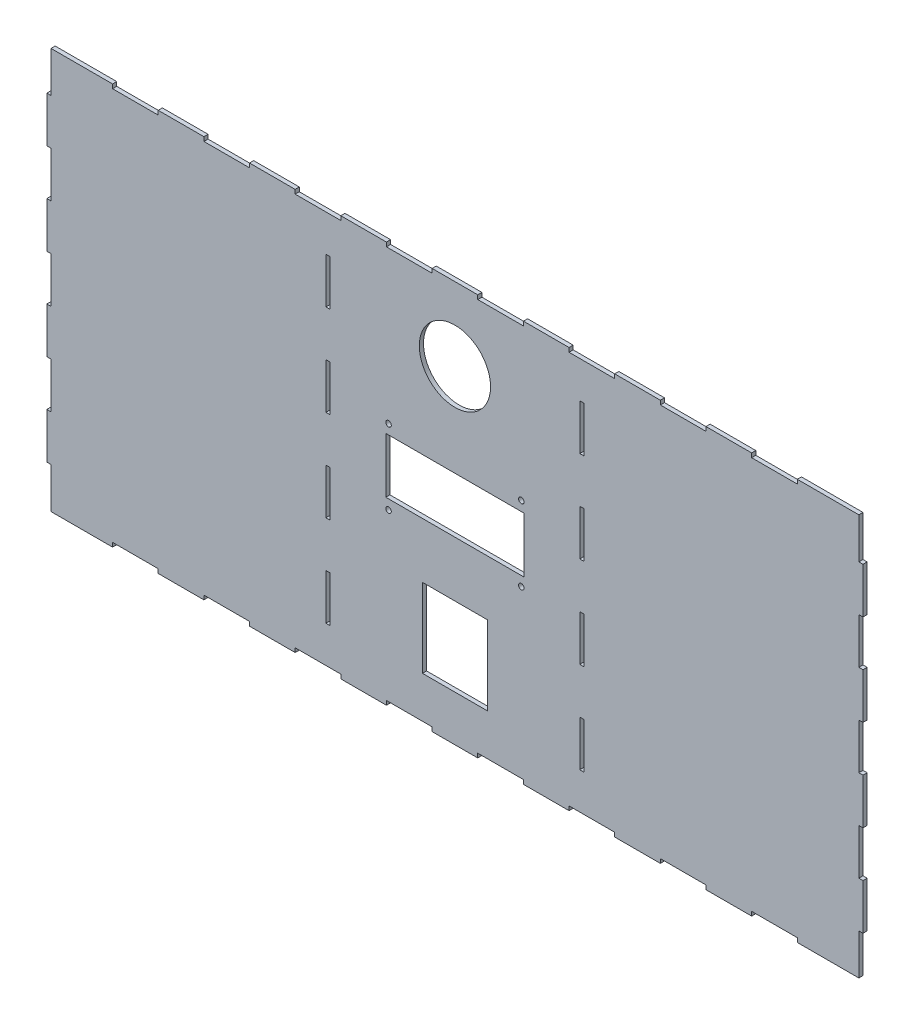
ISO-10303-21;
HEADER;
FILE_DESCRIPTION(('STEP AP214'),'2;1');
FILE_NAME('part.step','',(''),(''),'','','');
FILE_SCHEMA(('AUTOMOTIVE_DESIGN { 1 0 10303 214 1 1 1 1 }'));
ENDSEC;
DATA;
#1=APPLICATION_CONTEXT('core data for automotive mechanical design processes');
#2=APPLICATION_PROTOCOL_DEFINITION('international standard','automotive_design',2000,#1);
#3=PRODUCT_CONTEXT('',#1,'mechanical');
#4=PRODUCT('Part','Part','',(#3));
#5=PRODUCT_RELATED_PRODUCT_CATEGORY('part','',(#4));
#6=PRODUCT_DEFINITION_FORMATION('','',#4);
#7=PRODUCT_DEFINITION_CONTEXT('part definition',#1,'design');
#8=PRODUCT_DEFINITION('design','',#6,#7);
#9=PRODUCT_DEFINITION_SHAPE('','',#8);
#10=(LENGTH_UNIT() NAMED_UNIT(*) SI_UNIT(.MILLI.,.METRE.));
#11=(NAMED_UNIT(*) PLANE_ANGLE_UNIT() SI_UNIT($,.RADIAN.));
#12=(NAMED_UNIT(*) SI_UNIT($,.STERADIAN.) SOLID_ANGLE_UNIT());
#13=UNCERTAINTY_MEASURE_WITH_UNIT(LENGTH_MEASURE(1.E-05),#10,'distance_accuracy_value','');
#14=(GEOMETRIC_REPRESENTATION_CONTEXT(3) GLOBAL_UNCERTAINTY_ASSIGNED_CONTEXT((#13)) GLOBAL_UNIT_ASSIGNED_CONTEXT((#10,
#11,#12)) REPRESENTATION_CONTEXT('',''));
#15=CARTESIAN_POINT('',(0.,0.,0.));
#16=DIRECTION('',(0.,0.,1.));
#17=DIRECTION('',(1.,0.,0.));
#18=AXIS2_PLACEMENT_3D('',#15,#16,#17);
#19=CARTESIAN_POINT('',(0.,0.,3.));
#20=DIRECTION('',(0.,0.,1.));
#21=DIRECTION('',(1.,0.,0.));
#22=AXIS2_PLACEMENT_3D('',#19,#20,#21);
#23=PLANE('',#22);
#24=CARTESIAN_POINT('',(540.,419.,3.));
#25=DIRECTION('',(0.,0.,1.));
#26=DIRECTION('',(1.,0.,0.));
#27=AXIS2_PLACEMENT_3D('',#24,#25,#26);
#28=CIRCLE('',#27,2.);
#29=CARTESIAN_POINT('',(542.,419.,3.));
#30=VERTEX_POINT('',#29);
#31=EDGE_CURVE('E922',#30,#30,#28,.T.);
#32=ORIENTED_EDGE('',*,*,#31,.F.);
#33=EDGE_LOOP('',(#32));
#34=FACE_BOUND('',#33,.T.);
#35=CARTESIAN_POINT('',(636.,473.,3.));
#36=DIRECTION('',(0.,0.,1.));
#37=DIRECTION('',(1.,0.,0.));
#38=AXIS2_PLACEMENT_3D('',#35,#36,#37);
#39=CIRCLE('',#38,2.);
#40=CARTESIAN_POINT('',(638.,473.,3.));
#41=VERTEX_POINT('',#40);
#42=EDGE_CURVE('E938',#41,#41,#39,.T.);
#43=ORIENTED_EDGE('',*,*,#42,.F.);
#44=EDGE_LOOP('',(#43));
#45=FACE_BOUND('',#44,.T.);
#46=DIRECTION('',(1.,0.,0.));
#47=VECTOR('',#46,1.);
#48=CARTESIAN_POINT('',(494.75,325.499999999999,3.));
#49=LINE('',#48,#47);
#50=CARTESIAN_POINT('',(494.75,325.499999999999,3.));
#51=VERTEX_POINT('',#50);
#52=CARTESIAN_POINT('',(497.75,325.499999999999,3.));
#53=VERTEX_POINT('',#52);
#54=EDGE_CURVE('E952',#51,#53,#49,.T.);
#55=ORIENTED_EDGE('',*,*,#54,.F.);
#56=DIRECTION('',(0.,-1.,0.));
#57=VECTOR('',#56,1.);
#58=CARTESIAN_POINT('',(494.75,358.499999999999,3.));
#59=LINE('',#58,#57);
#60=CARTESIAN_POINT('',(494.75,358.499999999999,3.));
#61=VERTEX_POINT('',#60);
#62=EDGE_CURVE('E950',#61,#51,#59,.T.);
#63=ORIENTED_EDGE('',*,*,#62,.F.);
#64=DIRECTION('',(-1.,0.,0.));
#65=VECTOR('',#64,1.);
#66=CARTESIAN_POINT('',(494.75,358.499999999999,3.));
#67=LINE('',#66,#65);
#68=CARTESIAN_POINT('',(497.75,358.499999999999,3.));
#69=VERTEX_POINT('',#68);
#70=EDGE_CURVE('E958',#69,#61,#67,.T.);
#71=ORIENTED_EDGE('',*,*,#70,.F.);
#72=DIRECTION('',(0.,1.,0.));
#73=VECTOR('',#72,1.);
#74=CARTESIAN_POINT('',(497.75,358.499999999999,3.));
#75=LINE('',#74,#73);
#76=EDGE_CURVE('E955',#53,#69,#75,.T.);
#77=ORIENTED_EDGE('',*,*,#76,.F.);
#78=EDGE_LOOP('',(#55,#63,#71,#77));
#79=FACE_BOUND('',#78,.T.);
#80=DIRECTION('',(1.,0.,0.));
#81=VECTOR('',#80,1.);
#82=CARTESIAN_POINT('',(494.75,391.499999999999,3.));
#83=LINE('',#82,#81);
#84=CARTESIAN_POINT('',(494.75,391.499999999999,3.));
#85=VERTEX_POINT('',#84);
#86=CARTESIAN_POINT('',(497.75,391.499999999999,3.));
#87=VERTEX_POINT('',#86);
#88=EDGE_CURVE('E983',#85,#87,#83,.T.);
#89=ORIENTED_EDGE('',*,*,#88,.F.);
#90=DIRECTION('',(0.,-1.,0.));
#91=VECTOR('',#90,1.);
#92=CARTESIAN_POINT('',(494.75,424.499999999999,3.));
#93=LINE('',#92,#91);
#94=CARTESIAN_POINT('',(494.75,424.499999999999,3.));
#95=VERTEX_POINT('',#94);
#96=EDGE_CURVE('E981',#95,#85,#93,.T.);
#97=ORIENTED_EDGE('',*,*,#96,.F.);
#98=DIRECTION('',(-1.,0.,0.));
#99=VECTOR('',#98,1.);
#100=CARTESIAN_POINT('',(494.75,424.499999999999,3.));
#101=LINE('',#100,#99);
#102=CARTESIAN_POINT('',(497.75,424.499999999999,3.));
#103=VERTEX_POINT('',#102);
#104=EDGE_CURVE('E989',#103,#95,#101,.T.);
#105=ORIENTED_EDGE('',*,*,#104,.F.);
#106=DIRECTION('',(0.,1.,0.));
#107=VECTOR('',#106,1.);
#108=CARTESIAN_POINT('',(497.75,424.499999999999,3.));
#109=LINE('',#108,#107);
#110=EDGE_CURVE('E986',#87,#103,#109,.T.);
#111=ORIENTED_EDGE('',*,*,#110,.F.);
#112=EDGE_LOOP('',(#89,#97,#105,#111));
#113=FACE_BOUND('',#112,.T.);
#114=DIRECTION('',(1.,0.,0.));
#115=VECTOR('',#114,1.);
#116=CARTESIAN_POINT('',(494.75,457.499999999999,3.));
#117=LINE('',#116,#115);
#118=CARTESIAN_POINT('',(494.75,457.499999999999,3.));
#119=VERTEX_POINT('',#118);
#120=CARTESIAN_POINT('',(497.75,457.499999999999,3.));
#121=VERTEX_POINT('',#120);
#122=EDGE_CURVE('E1014',#119,#121,#117,.T.);
#123=ORIENTED_EDGE('',*,*,#122,.F.);
#124=DIRECTION('',(0.,-1.,0.));
#125=VECTOR('',#124,1.);
#126=CARTESIAN_POINT('',(494.75,490.499999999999,3.));
#127=LINE('',#126,#125);
#128=CARTESIAN_POINT('',(494.75,490.499999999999,3.));
#129=VERTEX_POINT('',#128);
#130=EDGE_CURVE('E1012',#129,#119,#127,.T.);
#131=ORIENTED_EDGE('',*,*,#130,.F.);
#132=DIRECTION('',(-1.,0.,0.));
#133=VECTOR('',#132,1.);
#134=CARTESIAN_POINT('',(494.75,490.499999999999,3.));
#135=LINE('',#134,#133);
#136=CARTESIAN_POINT('',(497.75,490.499999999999,3.));
#137=VERTEX_POINT('',#136);
#138=EDGE_CURVE('E1020',#137,#129,#135,.T.);
#139=ORIENTED_EDGE('',*,*,#138,.F.);
#140=DIRECTION('',(0.,1.,0.));
#141=VECTOR('',#140,1.);
#142=CARTESIAN_POINT('',(497.75,490.499999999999,3.));
#143=LINE('',#142,#141);
#144=EDGE_CURVE('E1017',#121,#137,#143,.T.);
#145=ORIENTED_EDGE('',*,*,#144,.F.);
#146=EDGE_LOOP('',(#123,#131,#139,#145));
#147=FACE_BOUND('',#146,.T.);
#148=DIRECTION('',(1.,0.,0.));
#149=VECTOR('',#148,1.);
#150=CARTESIAN_POINT('',(494.75,523.5,3.));
#151=LINE('',#150,#149);
#152=CARTESIAN_POINT('',(494.75,523.5,3.));
#153=VERTEX_POINT('',#152);
#154=CARTESIAN_POINT('',(497.75,523.5,3.));
#155=VERTEX_POINT('',#154);
#156=EDGE_CURVE('E1045',#153,#155,#151,.T.);
#157=ORIENTED_EDGE('',*,*,#156,.F.);
#158=DIRECTION('',(0.,-1.,0.));
#159=VECTOR('',#158,1.);
#160=CARTESIAN_POINT('',(494.75,556.5,3.));
#161=LINE('',#160,#159);
#162=CARTESIAN_POINT('',(494.75,556.5,3.));
#163=VERTEX_POINT('',#162);
#164=EDGE_CURVE('E1043',#163,#153,#161,.T.);
#165=ORIENTED_EDGE('',*,*,#164,.F.);
#166=DIRECTION('',(-1.,0.,0.));
#167=VECTOR('',#166,1.);
#168=CARTESIAN_POINT('',(494.75,556.5,3.));
#169=LINE('',#168,#167);
#170=CARTESIAN_POINT('',(497.75,556.5,3.));
#171=VERTEX_POINT('',#170);
#172=EDGE_CURVE('E1051',#171,#163,#169,.T.);
#173=ORIENTED_EDGE('',*,*,#172,.F.);
#174=DIRECTION('',(0.,1.,0.));
#175=VECTOR('',#174,1.);
#176=CARTESIAN_POINT('',(497.75,556.5,3.));
#177=LINE('',#176,#175);
#178=EDGE_CURVE('E1048',#155,#171,#177,.T.);
#179=ORIENTED_EDGE('',*,*,#178,.F.);
#180=EDGE_LOOP('',(#157,#165,#173,#179));
#181=FACE_BOUND('',#180,.T.);
#182=DIRECTION('',(1.,0.,0.));
#183=VECTOR('',#182,1.);
#184=CARTESIAN_POINT('',(678.25,325.5,3.));
#185=LINE('',#184,#183);
#186=CARTESIAN_POINT('',(678.25,325.5,3.));
#187=VERTEX_POINT('',#186);
#188=CARTESIAN_POINT('',(681.25,325.5,3.));
#189=VERTEX_POINT('',#188);
#190=EDGE_CURVE('E1076',#187,#189,#185,.T.);
#191=ORIENTED_EDGE('',*,*,#190,.F.);
#192=DIRECTION('',(0.,-1.,0.));
#193=VECTOR('',#192,1.);
#194=CARTESIAN_POINT('',(678.25,358.5,3.));
#195=LINE('',#194,#193);
#196=CARTESIAN_POINT('',(678.25,358.5,3.));
#197=VERTEX_POINT('',#196);
#198=EDGE_CURVE('E1074',#197,#187,#195,.T.);
#199=ORIENTED_EDGE('',*,*,#198,.F.);
#200=DIRECTION('',(-1.,0.,0.));
#201=VECTOR('',#200,1.);
#202=CARTESIAN_POINT('',(678.25,358.5,3.));
#203=LINE('',#202,#201);
#204=CARTESIAN_POINT('',(681.25,358.5,3.));
#205=VERTEX_POINT('',#204);
#206=EDGE_CURVE('E1082',#205,#197,#203,.T.);
#207=ORIENTED_EDGE('',*,*,#206,.F.);
#208=DIRECTION('',(0.,1.,0.));
#209=VECTOR('',#208,1.);
#210=CARTESIAN_POINT('',(681.25,358.5,3.));
#211=LINE('',#210,#209);
#212=EDGE_CURVE('E1079',#189,#205,#211,.T.);
#213=ORIENTED_EDGE('',*,*,#212,.F.);
#214=EDGE_LOOP('',(#191,#199,#207,#213));
#215=FACE_BOUND('',#214,.T.);
#216=DIRECTION('',(1.,0.,0.));
#217=VECTOR('',#216,1.);
#218=CARTESIAN_POINT('',(678.25,391.5,3.));
#219=LINE('',#218,#217);
#220=CARTESIAN_POINT('',(678.25,391.5,3.));
#221=VERTEX_POINT('',#220);
#222=CARTESIAN_POINT('',(681.25,391.5,3.));
#223=VERTEX_POINT('',#222);
#224=EDGE_CURVE('E1107',#221,#223,#219,.T.);
#225=ORIENTED_EDGE('',*,*,#224,.F.);
#226=DIRECTION('',(0.,-1.,0.));
#227=VECTOR('',#226,1.);
#228=CARTESIAN_POINT('',(678.25,424.5,3.));
#229=LINE('',#228,#227);
#230=CARTESIAN_POINT('',(678.25,424.5,3.));
#231=VERTEX_POINT('',#230);
#232=EDGE_CURVE('E1105',#231,#221,#229,.T.);
#233=ORIENTED_EDGE('',*,*,#232,.F.);
#234=DIRECTION('',(-1.,0.,0.));
#235=VECTOR('',#234,1.);
#236=CARTESIAN_POINT('',(678.25,424.5,3.));
#237=LINE('',#236,#235);
#238=CARTESIAN_POINT('',(681.25,424.5,3.));
#239=VERTEX_POINT('',#238);
#240=EDGE_CURVE('E1113',#239,#231,#237,.T.);
#241=ORIENTED_EDGE('',*,*,#240,.F.);
#242=DIRECTION('',(0.,1.,0.));
#243=VECTOR('',#242,1.);
#244=CARTESIAN_POINT('',(681.25,424.5,3.));
#245=LINE('',#244,#243);
#246=EDGE_CURVE('E1110',#223,#239,#245,.T.);
#247=ORIENTED_EDGE('',*,*,#246,.F.);
#248=EDGE_LOOP('',(#225,#233,#241,#247));
#249=FACE_BOUND('',#248,.T.);
#250=DIRECTION('',(1.,0.,0.));
#251=VECTOR('',#250,1.);
#252=CARTESIAN_POINT('',(678.25,457.5,3.));
#253=LINE('',#252,#251);
#254=CARTESIAN_POINT('',(678.25,457.5,3.));
#255=VERTEX_POINT('',#254);
#256=CARTESIAN_POINT('',(681.25,457.5,3.));
#257=VERTEX_POINT('',#256);
#258=EDGE_CURVE('E1138',#255,#257,#253,.T.);
#259=ORIENTED_EDGE('',*,*,#258,.F.);
#260=DIRECTION('',(0.,-1.,0.));
#261=VECTOR('',#260,1.);
#262=CARTESIAN_POINT('',(678.25,490.5,3.));
#263=LINE('',#262,#261);
#264=CARTESIAN_POINT('',(678.25,490.5,3.));
#265=VERTEX_POINT('',#264);
#266=EDGE_CURVE('E1136',#265,#255,#263,.T.);
#267=ORIENTED_EDGE('',*,*,#266,.F.);
#268=DIRECTION('',(-1.,0.,0.));
#269=VECTOR('',#268,1.);
#270=CARTESIAN_POINT('',(678.25,490.5,3.));
#271=LINE('',#270,#269);
#272=CARTESIAN_POINT('',(681.25,490.5,3.));
#273=VERTEX_POINT('',#272);
#274=EDGE_CURVE('E1144',#273,#265,#271,.T.);
#275=ORIENTED_EDGE('',*,*,#274,.F.);
#276=DIRECTION('',(0.,1.,0.));
#277=VECTOR('',#276,1.);
#278=CARTESIAN_POINT('',(681.25,490.5,3.));
#279=LINE('',#278,#277);
#280=EDGE_CURVE('E1141',#257,#273,#279,.T.);
#281=ORIENTED_EDGE('',*,*,#280,.F.);
#282=EDGE_LOOP('',(#259,#267,#275,#281));
#283=FACE_BOUND('',#282,.T.);
#284=DIRECTION('',(1.,0.,0.));
#285=VECTOR('',#284,1.);
#286=CARTESIAN_POINT('',(678.25,523.5,3.));
#287=LINE('',#286,#285);
#288=CARTESIAN_POINT('',(678.25,523.5,3.));
#289=VERTEX_POINT('',#288);
#290=CARTESIAN_POINT('',(681.25,523.5,3.));
#291=VERTEX_POINT('',#290);
#292=EDGE_CURVE('E1169',#289,#291,#287,.T.);
#293=ORIENTED_EDGE('',*,*,#292,.F.);
#294=DIRECTION('',(0.,-1.,0.));
#295=VECTOR('',#294,1.);
#296=CARTESIAN_POINT('',(678.25,556.5,3.));
#297=LINE('',#296,#295);
#298=CARTESIAN_POINT('',(678.25,556.5,3.));
#299=VERTEX_POINT('',#298);
#300=EDGE_CURVE('E1167',#299,#289,#297,.T.);
#301=ORIENTED_EDGE('',*,*,#300,.F.);
#302=DIRECTION('',(-1.,0.,0.));
#303=VECTOR('',#302,1.);
#304=CARTESIAN_POINT('',(678.25,556.5,3.));
#305=LINE('',#304,#303);
#306=CARTESIAN_POINT('',(681.25,556.5,3.));
#307=VERTEX_POINT('',#306);
#308=EDGE_CURVE('E1175',#307,#299,#305,.T.);
#309=ORIENTED_EDGE('',*,*,#308,.F.);
#310=DIRECTION('',(0.,1.,0.));
#311=VECTOR('',#310,1.);
#312=CARTESIAN_POINT('',(681.25,556.5,3.));
#313=LINE('',#312,#311);
#314=EDGE_CURVE('E1172',#291,#307,#313,.T.);
#315=ORIENTED_EDGE('',*,*,#314,.F.);
#316=EDGE_LOOP('',(#293,#301,#309,#315));
#317=FACE_BOUND('',#316,.T.);
#318=DIRECTION('',(1.,0.,0.));
#319=VECTOR('',#318,1.);
#320=CARTESIAN_POINT('',(538.,426.,3.));
#321=LINE('',#320,#319);
#322=CARTESIAN_POINT('',(538.,426.,3.));
#323=VERTEX_POINT('',#322);
#324=CARTESIAN_POINT('',(638.,426.,3.));
#325=VERTEX_POINT('',#324);
#326=EDGE_CURVE('E1200',#323,#325,#321,.T.);
#327=ORIENTED_EDGE('',*,*,#326,.F.);
#328=DIRECTION('',(0.,-1.,0.));
#329=VECTOR('',#328,1.);
#330=CARTESIAN_POINT('',(538.,466.,3.));
#331=LINE('',#330,#329);
#332=CARTESIAN_POINT('',(538.,466.,3.));
#333=VERTEX_POINT('',#332);
#334=EDGE_CURVE('E1198',#333,#323,#331,.T.);
#335=ORIENTED_EDGE('',*,*,#334,.F.);
#336=DIRECTION('',(-1.,0.,0.));
#337=VECTOR('',#336,1.);
#338=CARTESIAN_POINT('',(538.,466.,3.));
#339=LINE('',#338,#337);
#340=CARTESIAN_POINT('',(638.,466.,3.));
#341=VERTEX_POINT('',#340);
#342=EDGE_CURVE('E1206',#341,#333,#339,.T.);
#343=ORIENTED_EDGE('',*,*,#342,.F.);
#344=DIRECTION('',(0.,1.,0.));
#345=VECTOR('',#344,1.);
#346=CARTESIAN_POINT('',(638.,466.,3.));
#347=LINE('',#346,#345);
#348=EDGE_CURVE('E1203',#325,#341,#347,.T.);
#349=ORIENTED_EDGE('',*,*,#348,.F.);
#350=EDGE_LOOP('',(#327,#335,#343,#349));
#351=FACE_BOUND('',#350,.T.);
#352=DIRECTION('',(-1.,0.,0.));
#353=VECTOR('',#352,1.);
#354=CARTESIAN_POINT('',(307.5,586.,3.));
#355=LINE('',#354,#353);
#356=CARTESIAN_POINT('',(340.5,586.,3.));
#357=VERTEX_POINT('',#356);
#358=CARTESIAN_POINT('',(296.,586.,3.));
#359=VERTEX_POINT('',#358);
#360=EDGE_CURVE('E1229',#357,#359,#355,.T.);
#361=ORIENTED_EDGE('',*,*,#360,.T.);
#362=DIRECTION('',(0.,-1.,0.));
#363=VECTOR('',#362,1.);
#364=CARTESIAN_POINT('',(296.,586.,3.));
#365=LINE('',#364,#363);
#366=CARTESIAN_POINT('',(296.,556.5,3.));
#367=VERTEX_POINT('',#366);
#368=EDGE_CURVE('E1232',#359,#367,#365,.T.);
#369=ORIENTED_EDGE('',*,*,#368,.T.);
#370=DIRECTION('',(-1.,0.,0.));
#371=VECTOR('',#370,1.);
#372=CARTESIAN_POINT('',(296.,556.5,3.));
#373=LINE('',#372,#371);
#374=CARTESIAN_POINT('',(293.,556.5,3.));
#375=VERTEX_POINT('',#374);
#376=EDGE_CURVE('E1235',#367,#375,#373,.T.);
#377=ORIENTED_EDGE('',*,*,#376,.T.);
#378=DIRECTION('',(0.,-1.,0.));
#379=VECTOR('',#378,1.);
#380=CARTESIAN_POINT('',(293.,556.5,3.));
#381=LINE('',#380,#379);
#382=CARTESIAN_POINT('',(293.,523.5,3.));
#383=VERTEX_POINT('',#382);
#384=EDGE_CURVE('E1237',#375,#383,#381,.T.);
#385=ORIENTED_EDGE('',*,*,#384,.T.);
#386=DIRECTION('',(1.,0.,0.));
#387=VECTOR('',#386,1.);
#388=CARTESIAN_POINT('',(293.,523.5,3.));
#389=LINE('',#388,#387);
#390=CARTESIAN_POINT('',(296.,523.5,3.));
#391=VERTEX_POINT('',#390);
#392=EDGE_CURVE('E1239',#383,#391,#389,.T.);
#393=ORIENTED_EDGE('',*,*,#392,.T.);
#394=DIRECTION('',(0.,-1.,0.));
#395=VECTOR('',#394,1.);
#396=CARTESIAN_POINT('',(296.,523.5,3.));
#397=LINE('',#396,#395);
#398=CARTESIAN_POINT('',(296.,490.5,3.));
#399=VERTEX_POINT('',#398);
#400=EDGE_CURVE('E1241',#391,#399,#397,.T.);
#401=ORIENTED_EDGE('',*,*,#400,.T.);
#402=DIRECTION('',(-1.,0.,0.));
#403=VECTOR('',#402,1.);
#404=CARTESIAN_POINT('',(296.,490.5,3.));
#405=LINE('',#404,#403);
#406=CARTESIAN_POINT('',(293.,490.5,3.));
#407=VERTEX_POINT('',#406);
#408=EDGE_CURVE('E1243',#399,#407,#405,.T.);
#409=ORIENTED_EDGE('',*,*,#408,.T.);
#410=DIRECTION('',(0.,-1.,0.));
#411=VECTOR('',#410,1.);
#412=CARTESIAN_POINT('',(293.,490.5,3.));
#413=LINE('',#412,#411);
#414=CARTESIAN_POINT('',(293.,457.5,3.));
#415=VERTEX_POINT('',#414);
#416=EDGE_CURVE('E1245',#407,#415,#413,.T.);
#417=ORIENTED_EDGE('',*,*,#416,.T.);
#418=DIRECTION('',(1.,0.,0.));
#419=VECTOR('',#418,1.);
#420=CARTESIAN_POINT('',(293.,457.5,3.));
#421=LINE('',#420,#419);
#422=CARTESIAN_POINT('',(296.,457.5,3.));
#423=VERTEX_POINT('',#422);
#424=EDGE_CURVE('E1247',#415,#423,#421,.T.);
#425=ORIENTED_EDGE('',*,*,#424,.T.);
#426=DIRECTION('',(0.,-1.,0.));
#427=VECTOR('',#426,1.);
#428=CARTESIAN_POINT('',(296.,457.5,3.));
#429=LINE('',#428,#427);
#430=CARTESIAN_POINT('',(296.,424.5,3.));
#431=VERTEX_POINT('',#430);
#432=EDGE_CURVE('E1249',#423,#431,#429,.T.);
#433=ORIENTED_EDGE('',*,*,#432,.T.);
#434=DIRECTION('',(-1.,0.,0.));
#435=VECTOR('',#434,1.);
#436=CARTESIAN_POINT('',(296.,424.5,3.));
#437=LINE('',#436,#435);
#438=CARTESIAN_POINT('',(293.,424.5,3.));
#439=VERTEX_POINT('',#438);
#440=EDGE_CURVE('E1251',#431,#439,#437,.T.);
#441=ORIENTED_EDGE('',*,*,#440,.T.);
#442=DIRECTION('',(0.,-1.,0.));
#443=VECTOR('',#442,1.);
#444=CARTESIAN_POINT('',(293.,424.5,3.));
#445=LINE('',#444,#443);
#446=CARTESIAN_POINT('',(293.,391.5,3.));
#447=VERTEX_POINT('',#446);
#448=EDGE_CURVE('E1253',#439,#447,#445,.T.);
#449=ORIENTED_EDGE('',*,*,#448,.T.);
#450=DIRECTION('',(1.,0.,0.));
#451=VECTOR('',#450,1.);
#452=CARTESIAN_POINT('',(293.,391.5,3.));
#453=LINE('',#452,#451);
#454=CARTESIAN_POINT('',(296.,391.5,3.));
#455=VERTEX_POINT('',#454);
#456=EDGE_CURVE('E1255',#447,#455,#453,.T.);
#457=ORIENTED_EDGE('',*,*,#456,.T.);
#458=DIRECTION('',(0.,-1.,0.));
#459=VECTOR('',#458,1.);
#460=CARTESIAN_POINT('',(296.,391.5,3.));
#461=LINE('',#460,#459);
#462=CARTESIAN_POINT('',(296.,358.5,3.));
#463=VERTEX_POINT('',#462);
#464=EDGE_CURVE('E1257',#455,#463,#461,.T.);
#465=ORIENTED_EDGE('',*,*,#464,.T.);
#466=DIRECTION('',(-1.,0.,0.));
#467=VECTOR('',#466,1.);
#468=CARTESIAN_POINT('',(296.,358.5,3.));
#469=LINE('',#468,#467);
#470=CARTESIAN_POINT('',(293.,358.5,3.));
#471=VERTEX_POINT('',#470);
#472=EDGE_CURVE('E1259',#463,#471,#469,.T.);
#473=ORIENTED_EDGE('',*,*,#472,.T.);
#474=DIRECTION('',(0.,-1.,0.));
#475=VECTOR('',#474,1.);
#476=CARTESIAN_POINT('',(293.,358.5,3.));
#477=LINE('',#476,#475);
#478=CARTESIAN_POINT('',(293.,325.5,3.));
#479=VERTEX_POINT('',#478);
#480=EDGE_CURVE('E1261',#471,#479,#477,.T.);
#481=ORIENTED_EDGE('',*,*,#480,.T.);
#482=DIRECTION('',(1.,0.,0.));
#483=VECTOR('',#482,1.);
#484=CARTESIAN_POINT('',(293.,325.5,3.));
#485=LINE('',#484,#483);
#486=CARTESIAN_POINT('',(296.,325.5,3.));
#487=VERTEX_POINT('',#486);
#488=EDGE_CURVE('E1263',#479,#487,#485,.T.);
#489=ORIENTED_EDGE('',*,*,#488,.T.);
#490=DIRECTION('',(0.,-1.,0.));
#491=VECTOR('',#490,1.);
#492=CARTESIAN_POINT('',(296.,325.5,3.));
#493=LINE('',#492,#491);
#494=CARTESIAN_POINT('',(296.,296.,3.));
#495=VERTEX_POINT('',#494);
#496=EDGE_CURVE('E1265',#487,#495,#493,.T.);
#497=ORIENTED_EDGE('',*,*,#496,.T.);
#498=DIRECTION('',(1.,0.,0.));
#499=VECTOR('',#498,1.);
#500=CARTESIAN_POINT('',(296.,296.,3.));
#501=LINE('',#500,#499);
#502=CARTESIAN_POINT('',(340.5,296.,3.));
#503=VERTEX_POINT('',#502);
#504=EDGE_CURVE('E1267',#495,#503,#501,.T.);
#505=ORIENTED_EDGE('',*,*,#504,.T.);
#506=DIRECTION('',(0.,1.,0.));
#507=VECTOR('',#506,1.);
#508=CARTESIAN_POINT('',(340.5,296.,3.));
#509=LINE('',#508,#507);
#510=CARTESIAN_POINT('',(340.5,299.,3.));
#511=VERTEX_POINT('',#510);
#512=EDGE_CURVE('E1269',#503,#511,#509,.T.);
#513=ORIENTED_EDGE('',*,*,#512,.T.);
#514=DIRECTION('',(1.,0.,0.));
#515=VECTOR('',#514,1.);
#516=CARTESIAN_POINT('',(340.5,299.,3.));
#517=LINE('',#516,#515);
#518=CARTESIAN_POINT('',(373.5,299.,3.));
#519=VERTEX_POINT('',#518);
#520=EDGE_CURVE('E1271',#511,#519,#517,.T.);
#521=ORIENTED_EDGE('',*,*,#520,.T.);
#522=DIRECTION('',(0.,-1.,0.));
#523=VECTOR('',#522,1.);
#524=CARTESIAN_POINT('',(373.5,299.,3.));
#525=LINE('',#524,#523);
#526=CARTESIAN_POINT('',(373.5,296.,3.));
#527=VERTEX_POINT('',#526);
#528=EDGE_CURVE('E1273',#519,#527,#525,.T.);
#529=ORIENTED_EDGE('',*,*,#528,.T.);
#530=DIRECTION('',(1.,0.,0.));
#531=VECTOR('',#530,1.);
#532=CARTESIAN_POINT('',(373.5,296.,3.));
#533=LINE('',#532,#531);
#534=CARTESIAN_POINT('',(406.5,296.,3.));
#535=VERTEX_POINT('',#534);
#536=EDGE_CURVE('E1275',#527,#535,#533,.T.);
#537=ORIENTED_EDGE('',*,*,#536,.T.);
#538=DIRECTION('',(0.,1.,0.));
#539=VECTOR('',#538,1.);
#540=CARTESIAN_POINT('',(406.5,296.,3.));
#541=LINE('',#540,#539);
#542=CARTESIAN_POINT('',(406.5,299.,3.));
#543=VERTEX_POINT('',#542);
#544=EDGE_CURVE('E1277',#535,#543,#541,.T.);
#545=ORIENTED_EDGE('',*,*,#544,.T.);
#546=DIRECTION('',(1.,0.,0.));
#547=VECTOR('',#546,1.);
#548=CARTESIAN_POINT('',(406.5,299.,3.));
#549=LINE('',#548,#547);
#550=CARTESIAN_POINT('',(439.5,299.,3.));
#551=VERTEX_POINT('',#550);
#552=EDGE_CURVE('E1279',#543,#551,#549,.T.);
#553=ORIENTED_EDGE('',*,*,#552,.T.);
#554=DIRECTION('',(0.,-1.,0.));
#555=VECTOR('',#554,1.);
#556=CARTESIAN_POINT('',(439.5,299.,3.));
#557=LINE('',#556,#555);
#558=CARTESIAN_POINT('',(439.5,296.,3.));
#559=VERTEX_POINT('',#558);
#560=EDGE_CURVE('E1281',#551,#559,#557,.T.);
#561=ORIENTED_EDGE('',*,*,#560,.T.);
#562=DIRECTION('',(1.,0.,0.));
#563=VECTOR('',#562,1.);
#564=CARTESIAN_POINT('',(439.5,296.,3.));
#565=LINE('',#564,#563);
#566=CARTESIAN_POINT('',(472.5,296.,3.));
#567=VERTEX_POINT('',#566);
#568=EDGE_CURVE('E1283',#559,#567,#565,.T.);
#569=ORIENTED_EDGE('',*,*,#568,.T.);
#570=DIRECTION('',(0.,1.,0.));
#571=VECTOR('',#570,1.);
#572=CARTESIAN_POINT('',(472.5,296.,3.));
#573=LINE('',#572,#571);
#574=CARTESIAN_POINT('',(472.5,299.,3.));
#575=VERTEX_POINT('',#574);
#576=EDGE_CURVE('E1285',#567,#575,#573,.T.);
#577=ORIENTED_EDGE('',*,*,#576,.T.);
#578=DIRECTION('',(1.,0.,0.));
#579=VECTOR('',#578,1.);
#580=CARTESIAN_POINT('',(472.5,299.,3.));
#581=LINE('',#580,#579);
#582=CARTESIAN_POINT('',(505.5,299.,3.));
#583=VERTEX_POINT('',#582);
#584=EDGE_CURVE('E1287',#575,#583,#581,.T.);
#585=ORIENTED_EDGE('',*,*,#584,.T.);
#586=DIRECTION('',(0.,-1.,0.));
#587=VECTOR('',#586,1.);
#588=CARTESIAN_POINT('',(505.5,299.,3.));
#589=LINE('',#588,#587);
#590=CARTESIAN_POINT('',(505.5,296.,3.));
#591=VERTEX_POINT('',#590);
#592=EDGE_CURVE('E1289',#583,#591,#589,.T.);
#593=ORIENTED_EDGE('',*,*,#592,.T.);
#594=DIRECTION('',(1.,0.,0.));
#595=VECTOR('',#594,1.);
#596=CARTESIAN_POINT('',(505.5,296.,3.));
#597=LINE('',#596,#595);
#598=CARTESIAN_POINT('',(538.5,296.,3.));
#599=VERTEX_POINT('',#598);
#600=EDGE_CURVE('E1291',#591,#599,#597,.T.);
#601=ORIENTED_EDGE('',*,*,#600,.T.);
#602=DIRECTION('',(0.,1.,0.));
#603=VECTOR('',#602,1.);
#604=CARTESIAN_POINT('',(538.5,296.,3.));
#605=LINE('',#604,#603);
#606=CARTESIAN_POINT('',(538.5,299.,3.));
#607=VERTEX_POINT('',#606);
#608=EDGE_CURVE('E1293',#599,#607,#605,.T.);
#609=ORIENTED_EDGE('',*,*,#608,.T.);
#610=DIRECTION('',(1.,0.,0.));
#611=VECTOR('',#610,1.);
#612=CARTESIAN_POINT('',(538.5,299.,3.));
#613=LINE('',#612,#611);
#614=CARTESIAN_POINT('',(571.5,299.,3.));
#615=VERTEX_POINT('',#614);
#616=EDGE_CURVE('E1295',#607,#615,#613,.T.);
#617=ORIENTED_EDGE('',*,*,#616,.T.);
#618=DIRECTION('',(0.,-1.,0.));
#619=VECTOR('',#618,1.);
#620=CARTESIAN_POINT('',(571.5,299.,3.));
#621=LINE('',#620,#619);
#622=CARTESIAN_POINT('',(571.5,296.,3.));
#623=VERTEX_POINT('',#622);
#624=EDGE_CURVE('E1297',#615,#623,#621,.T.);
#625=ORIENTED_EDGE('',*,*,#624,.T.);
#626=DIRECTION('',(1.,0.,0.));
#627=VECTOR('',#626,1.);
#628=CARTESIAN_POINT('',(571.5,296.,3.));
#629=LINE('',#628,#627);
#630=CARTESIAN_POINT('',(604.5,296.,3.));
#631=VERTEX_POINT('',#630);
#632=EDGE_CURVE('E1299',#623,#631,#629,.T.);
#633=ORIENTED_EDGE('',*,*,#632,.T.);
#634=DIRECTION('',(0.,1.,0.));
#635=VECTOR('',#634,1.);
#636=CARTESIAN_POINT('',(604.5,296.,3.));
#637=LINE('',#636,#635);
#638=CARTESIAN_POINT('',(604.5,299.,3.));
#639=VERTEX_POINT('',#638);
#640=EDGE_CURVE('E1301',#631,#639,#637,.T.);
#641=ORIENTED_EDGE('',*,*,#640,.T.);
#642=DIRECTION('',(1.,0.,0.));
#643=VECTOR('',#642,1.);
#644=CARTESIAN_POINT('',(604.5,299.,3.));
#645=LINE('',#644,#643);
#646=CARTESIAN_POINT('',(637.5,299.,3.));
#647=VERTEX_POINT('',#646);
#648=EDGE_CURVE('E1303',#639,#647,#645,.T.);
#649=ORIENTED_EDGE('',*,*,#648,.T.);
#650=DIRECTION('',(0.,-1.,0.));
#651=VECTOR('',#650,1.);
#652=CARTESIAN_POINT('',(637.5,299.,3.));
#653=LINE('',#652,#651);
#654=CARTESIAN_POINT('',(637.5,296.,3.));
#655=VERTEX_POINT('',#654);
#656=EDGE_CURVE('E1305',#647,#655,#653,.T.);
#657=ORIENTED_EDGE('',*,*,#656,.T.);
#658=DIRECTION('',(1.,0.,0.));
#659=VECTOR('',#658,1.);
#660=CARTESIAN_POINT('',(637.5,296.,3.));
#661=LINE('',#660,#659);
#662=CARTESIAN_POINT('',(670.5,296.,3.));
#663=VERTEX_POINT('',#662);
#664=EDGE_CURVE('E1307',#655,#663,#661,.T.);
#665=ORIENTED_EDGE('',*,*,#664,.T.);
#666=DIRECTION('',(0.,1.,0.));
#667=VECTOR('',#666,1.);
#668=CARTESIAN_POINT('',(670.5,296.,3.));
#669=LINE('',#668,#667);
#670=CARTESIAN_POINT('',(670.5,299.,3.));
#671=VERTEX_POINT('',#670);
#672=EDGE_CURVE('E1309',#663,#671,#669,.T.);
#673=ORIENTED_EDGE('',*,*,#672,.T.);
#674=DIRECTION('',(1.,0.,0.));
#675=VECTOR('',#674,1.);
#676=CARTESIAN_POINT('',(670.5,299.,3.));
#677=LINE('',#676,#675);
#678=CARTESIAN_POINT('',(703.5,299.,3.));
#679=VERTEX_POINT('',#678);
#680=EDGE_CURVE('E1311',#671,#679,#677,.T.);
#681=ORIENTED_EDGE('',*,*,#680,.T.);
#682=DIRECTION('',(0.,-1.,0.));
#683=VECTOR('',#682,1.);
#684=CARTESIAN_POINT('',(703.5,299.,3.));
#685=LINE('',#684,#683);
#686=CARTESIAN_POINT('',(703.5,296.,3.));
#687=VERTEX_POINT('',#686);
#688=EDGE_CURVE('E1313',#679,#687,#685,.T.);
#689=ORIENTED_EDGE('',*,*,#688,.T.);
#690=DIRECTION('',(1.,0.,0.));
#691=VECTOR('',#690,1.);
#692=CARTESIAN_POINT('',(703.5,296.,3.));
#693=LINE('',#692,#691);
#694=CARTESIAN_POINT('',(736.5,296.,3.));
#695=VERTEX_POINT('',#694);
#696=EDGE_CURVE('E1315',#687,#695,#693,.T.);
#697=ORIENTED_EDGE('',*,*,#696,.T.);
#698=DIRECTION('',(0.,1.,0.));
#699=VECTOR('',#698,1.);
#700=CARTESIAN_POINT('',(736.5,296.,3.));
#701=LINE('',#700,#699);
#702=CARTESIAN_POINT('',(736.5,299.,3.));
#703=VERTEX_POINT('',#702);
#704=EDGE_CURVE('E1317',#695,#703,#701,.T.);
#705=ORIENTED_EDGE('',*,*,#704,.T.);
#706=DIRECTION('',(1.,0.,0.));
#707=VECTOR('',#706,1.);
#708=CARTESIAN_POINT('',(736.5,299.,3.));
#709=LINE('',#708,#707);
#710=CARTESIAN_POINT('',(769.5,299.,3.));
#711=VERTEX_POINT('',#710);
#712=EDGE_CURVE('E1319',#703,#711,#709,.T.);
#713=ORIENTED_EDGE('',*,*,#712,.T.);
#714=DIRECTION('',(0.,-1.,0.));
#715=VECTOR('',#714,1.);
#716=CARTESIAN_POINT('',(769.5,299.,3.));
#717=LINE('',#716,#715);
#718=CARTESIAN_POINT('',(769.5,296.,3.));
#719=VERTEX_POINT('',#718);
#720=EDGE_CURVE('E1321',#711,#719,#717,.T.);
#721=ORIENTED_EDGE('',*,*,#720,.T.);
#722=DIRECTION('',(1.,0.,0.));
#723=VECTOR('',#722,1.);
#724=CARTESIAN_POINT('',(769.5,296.,3.));
#725=LINE('',#724,#723);
#726=CARTESIAN_POINT('',(802.5,296.,3.));
#727=VERTEX_POINT('',#726);
#728=EDGE_CURVE('E1323',#719,#727,#725,.T.);
#729=ORIENTED_EDGE('',*,*,#728,.T.);
#730=DIRECTION('',(0.,1.,0.));
#731=VECTOR('',#730,1.);
#732=CARTESIAN_POINT('',(802.5,296.,3.));
#733=LINE('',#732,#731);
#734=CARTESIAN_POINT('',(802.5,299.,3.));
#735=VERTEX_POINT('',#734);
#736=EDGE_CURVE('E1325',#727,#735,#733,.T.);
#737=ORIENTED_EDGE('',*,*,#736,.T.);
#738=DIRECTION('',(1.,0.,0.));
#739=VECTOR('',#738,1.);
#740=CARTESIAN_POINT('',(802.5,299.,3.));
#741=LINE('',#740,#739);
#742=CARTESIAN_POINT('',(835.5,299.,3.));
#743=VERTEX_POINT('',#742);
#744=EDGE_CURVE('E1327',#735,#743,#741,.T.);
#745=ORIENTED_EDGE('',*,*,#744,.T.);
#746=DIRECTION('',(0.,-1.,0.));
#747=VECTOR('',#746,1.);
#748=CARTESIAN_POINT('',(835.5,299.,3.));
#749=LINE('',#748,#747);
#750=CARTESIAN_POINT('',(835.5,296.,3.));
#751=VERTEX_POINT('',#750);
#752=EDGE_CURVE('E1329',#743,#751,#749,.T.);
#753=ORIENTED_EDGE('',*,*,#752,.T.);
#754=DIRECTION('',(1.,0.,0.));
#755=VECTOR('',#754,1.);
#756=CARTESIAN_POINT('',(835.5,296.,3.));
#757=LINE('',#756,#755);
#758=CARTESIAN_POINT('',(880.,296.,3.));
#759=VERTEX_POINT('',#758);
#760=EDGE_CURVE('E1331',#751,#759,#757,.T.);
#761=ORIENTED_EDGE('',*,*,#760,.T.);
#762=DIRECTION('',(0.,1.,0.));
#763=VECTOR('',#762,1.);
#764=CARTESIAN_POINT('',(880.,296.,3.));
#765=LINE('',#764,#763);
#766=CARTESIAN_POINT('',(880.,325.5,3.));
#767=VERTEX_POINT('',#766);
#768=EDGE_CURVE('E1333',#759,#767,#765,.T.);
#769=ORIENTED_EDGE('',*,*,#768,.T.);
#770=DIRECTION('',(1.,0.,0.));
#771=VECTOR('',#770,1.);
#772=CARTESIAN_POINT('',(880.,325.5,3.));
#773=LINE('',#772,#771);
#774=CARTESIAN_POINT('',(883.,325.5,3.));
#775=VERTEX_POINT('',#774);
#776=EDGE_CURVE('E1335',#767,#775,#773,.T.);
#777=ORIENTED_EDGE('',*,*,#776,.T.);
#778=DIRECTION('',(0.,1.,0.));
#779=VECTOR('',#778,1.);
#780=CARTESIAN_POINT('',(883.,325.5,3.));
#781=LINE('',#780,#779);
#782=CARTESIAN_POINT('',(883.,358.5,3.));
#783=VERTEX_POINT('',#782);
#784=EDGE_CURVE('E1337',#775,#783,#781,.T.);
#785=ORIENTED_EDGE('',*,*,#784,.T.);
#786=DIRECTION('',(-1.,0.,0.));
#787=VECTOR('',#786,1.);
#788=CARTESIAN_POINT('',(883.,358.5,3.));
#789=LINE('',#788,#787);
#790=CARTESIAN_POINT('',(880.,358.5,3.));
#791=VERTEX_POINT('',#790);
#792=EDGE_CURVE('E1339',#783,#791,#789,.T.);
#793=ORIENTED_EDGE('',*,*,#792,.T.);
#794=DIRECTION('',(0.,1.,0.));
#795=VECTOR('',#794,1.);
#796=CARTESIAN_POINT('',(880.,358.5,3.));
#797=LINE('',#796,#795);
#798=CARTESIAN_POINT('',(880.,391.5,3.));
#799=VERTEX_POINT('',#798);
#800=EDGE_CURVE('E1341',#791,#799,#797,.T.);
#801=ORIENTED_EDGE('',*,*,#800,.T.);
#802=DIRECTION('',(1.,0.,0.));
#803=VECTOR('',#802,1.);
#804=CARTESIAN_POINT('',(880.,391.5,3.));
#805=LINE('',#804,#803);
#806=CARTESIAN_POINT('',(883.,391.5,3.));
#807=VERTEX_POINT('',#806);
#808=EDGE_CURVE('E1343',#799,#807,#805,.T.);
#809=ORIENTED_EDGE('',*,*,#808,.T.);
#810=DIRECTION('',(0.,1.,0.));
#811=VECTOR('',#810,1.);
#812=CARTESIAN_POINT('',(883.,391.5,3.));
#813=LINE('',#812,#811);
#814=CARTESIAN_POINT('',(883.,424.5,3.));
#815=VERTEX_POINT('',#814);
#816=EDGE_CURVE('E1345',#807,#815,#813,.T.);
#817=ORIENTED_EDGE('',*,*,#816,.T.);
#818=DIRECTION('',(-1.,0.,0.));
#819=VECTOR('',#818,1.);
#820=CARTESIAN_POINT('',(883.,424.5,3.));
#821=LINE('',#820,#819);
#822=CARTESIAN_POINT('',(880.,424.5,3.));
#823=VERTEX_POINT('',#822);
#824=EDGE_CURVE('E1347',#815,#823,#821,.T.);
#825=ORIENTED_EDGE('',*,*,#824,.T.);
#826=DIRECTION('',(0.,1.,0.));
#827=VECTOR('',#826,1.);
#828=CARTESIAN_POINT('',(880.,424.5,3.));
#829=LINE('',#828,#827);
#830=CARTESIAN_POINT('',(880.,457.5,3.));
#831=VERTEX_POINT('',#830);
#832=EDGE_CURVE('E1349',#823,#831,#829,.T.);
#833=ORIENTED_EDGE('',*,*,#832,.T.);
#834=DIRECTION('',(1.,0.,0.));
#835=VECTOR('',#834,1.);
#836=CARTESIAN_POINT('',(880.,457.5,3.));
#837=LINE('',#836,#835);
#838=CARTESIAN_POINT('',(883.,457.5,3.));
#839=VERTEX_POINT('',#838);
#840=EDGE_CURVE('E1351',#831,#839,#837,.T.);
#841=ORIENTED_EDGE('',*,*,#840,.T.);
#842=DIRECTION('',(0.,1.,0.));
#843=VECTOR('',#842,1.);
#844=CARTESIAN_POINT('',(883.,457.5,3.));
#845=LINE('',#844,#843);
#846=CARTESIAN_POINT('',(883.,490.5,3.));
#847=VERTEX_POINT('',#846);
#848=EDGE_CURVE('E1353',#839,#847,#845,.T.);
#849=ORIENTED_EDGE('',*,*,#848,.T.);
#850=DIRECTION('',(-1.,0.,0.));
#851=VECTOR('',#850,1.);
#852=CARTESIAN_POINT('',(883.,490.5,3.));
#853=LINE('',#852,#851);
#854=CARTESIAN_POINT('',(880.,490.5,3.));
#855=VERTEX_POINT('',#854);
#856=EDGE_CURVE('E1355',#847,#855,#853,.T.);
#857=ORIENTED_EDGE('',*,*,#856,.T.);
#858=DIRECTION('',(0.,1.,0.));
#859=VECTOR('',#858,1.);
#860=CARTESIAN_POINT('',(880.,490.5,3.));
#861=LINE('',#860,#859);
#862=CARTESIAN_POINT('',(880.,523.5,3.));
#863=VERTEX_POINT('',#862);
#864=EDGE_CURVE('E1357',#855,#863,#861,.T.);
#865=ORIENTED_EDGE('',*,*,#864,.T.);
#866=DIRECTION('',(1.,0.,0.));
#867=VECTOR('',#866,1.);
#868=CARTESIAN_POINT('',(880.,523.5,3.));
#869=LINE('',#868,#867);
#870=CARTESIAN_POINT('',(883.,523.5,3.));
#871=VERTEX_POINT('',#870);
#872=EDGE_CURVE('E1359',#863,#871,#869,.T.);
#873=ORIENTED_EDGE('',*,*,#872,.T.);
#874=DIRECTION('',(0.,1.,0.));
#875=VECTOR('',#874,1.);
#876=CARTESIAN_POINT('',(883.,523.5,3.));
#877=LINE('',#876,#875);
#878=CARTESIAN_POINT('',(883.,556.5,3.));
#879=VERTEX_POINT('',#878);
#880=EDGE_CURVE('E1361',#871,#879,#877,.T.);
#881=ORIENTED_EDGE('',*,*,#880,.T.);
#882=DIRECTION('',(-1.,0.,0.));
#883=VECTOR('',#882,1.);
#884=CARTESIAN_POINT('',(883.,556.5,3.));
#885=LINE('',#884,#883);
#886=CARTESIAN_POINT('',(880.,556.5,3.));
#887=VERTEX_POINT('',#886);
#888=EDGE_CURVE('E1363',#879,#887,#885,.T.);
#889=ORIENTED_EDGE('',*,*,#888,.T.);
#890=DIRECTION('',(0.,1.,0.));
#891=VECTOR('',#890,1.);
#892=CARTESIAN_POINT('',(880.,556.5,3.));
#893=LINE('',#892,#891);
#894=CARTESIAN_POINT('',(880.,586.,3.));
#895=VERTEX_POINT('',#894);
#896=EDGE_CURVE('E1365',#887,#895,#893,.T.);
#897=ORIENTED_EDGE('',*,*,#896,.T.);
#898=DIRECTION('',(-1.,0.,0.));
#899=VECTOR('',#898,1.);
#900=CARTESIAN_POINT('',(880.,586.,3.));
#901=LINE('',#900,#899);
#902=CARTESIAN_POINT('',(835.5,586.,3.));
#903=VERTEX_POINT('',#902);
#904=EDGE_CURVE('E1367',#895,#903,#901,.T.);
#905=ORIENTED_EDGE('',*,*,#904,.T.);
#906=DIRECTION('',(0.,-1.,0.));
#907=VECTOR('',#906,1.);
#908=CARTESIAN_POINT('',(835.5,586.,3.));
#909=LINE('',#908,#907);
#910=CARTESIAN_POINT('',(835.5,583.,3.));
#911=VERTEX_POINT('',#910);
#912=EDGE_CURVE('E1369',#903,#911,#909,.T.);
#913=ORIENTED_EDGE('',*,*,#912,.T.);
#914=DIRECTION('',(-1.,0.,0.));
#915=VECTOR('',#914,1.);
#916=CARTESIAN_POINT('',(835.5,583.,3.));
#917=LINE('',#916,#915);
#918=CARTESIAN_POINT('',(802.5,583.,3.));
#919=VERTEX_POINT('',#918);
#920=EDGE_CURVE('E1371',#911,#919,#917,.T.);
#921=ORIENTED_EDGE('',*,*,#920,.T.);
#922=DIRECTION('',(0.,1.,0.));
#923=VECTOR('',#922,1.);
#924=CARTESIAN_POINT('',(802.5,583.,3.));
#925=LINE('',#924,#923);
#926=CARTESIAN_POINT('',(802.5,586.,3.));
#927=VERTEX_POINT('',#926);
#928=EDGE_CURVE('E1373',#919,#927,#925,.T.);
#929=ORIENTED_EDGE('',*,*,#928,.T.);
#930=DIRECTION('',(-1.,0.,0.));
#931=VECTOR('',#930,1.);
#932=CARTESIAN_POINT('',(802.5,586.,3.));
#933=LINE('',#932,#931);
#934=CARTESIAN_POINT('',(769.5,586.,3.));
#935=VERTEX_POINT('',#934);
#936=EDGE_CURVE('E1375',#927,#935,#933,.T.);
#937=ORIENTED_EDGE('',*,*,#936,.T.);
#938=DIRECTION('',(0.,-1.,0.));
#939=VECTOR('',#938,1.);
#940=CARTESIAN_POINT('',(769.5,586.,3.));
#941=LINE('',#940,#939);
#942=CARTESIAN_POINT('',(769.5,583.,3.));
#943=VERTEX_POINT('',#942);
#944=EDGE_CURVE('E1377',#935,#943,#941,.T.);
#945=ORIENTED_EDGE('',*,*,#944,.T.);
#946=DIRECTION('',(-1.,0.,0.));
#947=VECTOR('',#946,1.);
#948=CARTESIAN_POINT('',(769.5,583.,3.));
#949=LINE('',#948,#947);
#950=CARTESIAN_POINT('',(736.5,583.,3.));
#951=VERTEX_POINT('',#950);
#952=EDGE_CURVE('E1379',#943,#951,#949,.T.);
#953=ORIENTED_EDGE('',*,*,#952,.T.);
#954=DIRECTION('',(0.,1.,0.));
#955=VECTOR('',#954,1.);
#956=CARTESIAN_POINT('',(736.5,583.,3.));
#957=LINE('',#956,#955);
#958=CARTESIAN_POINT('',(736.5,586.,3.));
#959=VERTEX_POINT('',#958);
#960=EDGE_CURVE('E1381',#951,#959,#957,.T.);
#961=ORIENTED_EDGE('',*,*,#960,.T.);
#962=DIRECTION('',(-1.,0.,0.));
#963=VECTOR('',#962,1.);
#964=CARTESIAN_POINT('',(736.5,586.,3.));
#965=LINE('',#964,#963);
#966=CARTESIAN_POINT('',(703.5,586.,3.));
#967=VERTEX_POINT('',#966);
#968=EDGE_CURVE('E1383',#959,#967,#965,.T.);
#969=ORIENTED_EDGE('',*,*,#968,.T.);
#970=DIRECTION('',(0.,-1.,0.));
#971=VECTOR('',#970,1.);
#972=CARTESIAN_POINT('',(703.5,586.,3.));
#973=LINE('',#972,#971);
#974=CARTESIAN_POINT('',(703.5,583.,3.));
#975=VERTEX_POINT('',#974);
#976=EDGE_CURVE('E1385',#967,#975,#973,.T.);
#977=ORIENTED_EDGE('',*,*,#976,.T.);
#978=DIRECTION('',(-1.,0.,0.));
#979=VECTOR('',#978,1.);
#980=CARTESIAN_POINT('',(703.5,583.,3.));
#981=LINE('',#980,#979);
#982=CARTESIAN_POINT('',(670.5,583.,3.));
#983=VERTEX_POINT('',#982);
#984=EDGE_CURVE('E1387',#975,#983,#981,.T.);
#985=ORIENTED_EDGE('',*,*,#984,.T.);
#986=DIRECTION('',(0.,1.,0.));
#987=VECTOR('',#986,1.);
#988=CARTESIAN_POINT('',(670.5,583.,3.));
#989=LINE('',#988,#987);
#990=CARTESIAN_POINT('',(670.5,586.,3.));
#991=VERTEX_POINT('',#990);
#992=EDGE_CURVE('E1389',#983,#991,#989,.T.);
#993=ORIENTED_EDGE('',*,*,#992,.T.);
#994=DIRECTION('',(-1.,0.,0.));
#995=VECTOR('',#994,1.);
#996=CARTESIAN_POINT('',(670.5,586.,3.));
#997=LINE('',#996,#995);
#998=CARTESIAN_POINT('',(637.5,586.,3.));
#999=VERTEX_POINT('',#998);
#1000=EDGE_CURVE('E1391',#991,#999,#997,.T.);
#1001=ORIENTED_EDGE('',*,*,#1000,.T.);
#1002=DIRECTION('',(0.,-1.,0.));
#1003=VECTOR('',#1002,1.);
#1004=CARTESIAN_POINT('',(637.5,586.,3.));
#1005=LINE('',#1004,#1003);
#1006=CARTESIAN_POINT('',(637.5,583.,3.));
#1007=VERTEX_POINT('',#1006);
#1008=EDGE_CURVE('E1393',#999,#1007,#1005,.T.);
#1009=ORIENTED_EDGE('',*,*,#1008,.T.);
#1010=DIRECTION('',(-1.,0.,0.));
#1011=VECTOR('',#1010,1.);
#1012=CARTESIAN_POINT('',(637.5,583.,3.));
#1013=LINE('',#1012,#1011);
#1014=CARTESIAN_POINT('',(604.5,583.,3.));
#1015=VERTEX_POINT('',#1014);
#1016=EDGE_CURVE('E1395',#1007,#1015,#1013,.T.);
#1017=ORIENTED_EDGE('',*,*,#1016,.T.);
#1018=DIRECTION('',(0.,1.,0.));
#1019=VECTOR('',#1018,1.);
#1020=CARTESIAN_POINT('',(604.5,583.,3.));
#1021=LINE('',#1020,#1019);
#1022=CARTESIAN_POINT('',(604.5,586.,3.));
#1023=VERTEX_POINT('',#1022);
#1024=EDGE_CURVE('E1397',#1015,#1023,#1021,.T.);
#1025=ORIENTED_EDGE('',*,*,#1024,.T.);
#1026=DIRECTION('',(-1.,0.,0.));
#1027=VECTOR('',#1026,1.);
#1028=CARTESIAN_POINT('',(604.5,586.,3.));
#1029=LINE('',#1028,#1027);
#1030=CARTESIAN_POINT('',(571.5,586.,3.));
#1031=VERTEX_POINT('',#1030);
#1032=EDGE_CURVE('E1399',#1023,#1031,#1029,.T.);
#1033=ORIENTED_EDGE('',*,*,#1032,.T.);
#1034=DIRECTION('',(0.,-1.,0.));
#1035=VECTOR('',#1034,1.);
#1036=CARTESIAN_POINT('',(571.5,586.,3.));
#1037=LINE('',#1036,#1035);
#1038=CARTESIAN_POINT('',(571.5,583.,3.));
#1039=VERTEX_POINT('',#1038);
#1040=EDGE_CURVE('E1401',#1031,#1039,#1037,.T.);
#1041=ORIENTED_EDGE('',*,*,#1040,.T.);
#1042=DIRECTION('',(-1.,0.,0.));
#1043=VECTOR('',#1042,1.);
#1044=CARTESIAN_POINT('',(571.5,583.,3.));
#1045=LINE('',#1044,#1043);
#1046=CARTESIAN_POINT('',(538.5,583.,3.));
#1047=VERTEX_POINT('',#1046);
#1048=EDGE_CURVE('E1403',#1039,#1047,#1045,.T.);
#1049=ORIENTED_EDGE('',*,*,#1048,.T.);
#1050=DIRECTION('',(0.,1.,0.));
#1051=VECTOR('',#1050,1.);
#1052=CARTESIAN_POINT('',(538.5,583.,3.));
#1053=LINE('',#1052,#1051);
#1054=CARTESIAN_POINT('',(538.5,586.,3.));
#1055=VERTEX_POINT('',#1054);
#1056=EDGE_CURVE('E1405',#1047,#1055,#1053,.T.);
#1057=ORIENTED_EDGE('',*,*,#1056,.T.);
#1058=DIRECTION('',(-1.,0.,0.));
#1059=VECTOR('',#1058,1.);
#1060=CARTESIAN_POINT('',(538.5,586.,3.));
#1061=LINE('',#1060,#1059);
#1062=CARTESIAN_POINT('',(505.5,586.,3.));
#1063=VERTEX_POINT('',#1062);
#1064=EDGE_CURVE('E1407',#1055,#1063,#1061,.T.);
#1065=ORIENTED_EDGE('',*,*,#1064,.T.);
#1066=DIRECTION('',(0.,-1.,0.));
#1067=VECTOR('',#1066,1.);
#1068=CARTESIAN_POINT('',(505.5,586.,3.));
#1069=LINE('',#1068,#1067);
#1070=CARTESIAN_POINT('',(505.5,583.,3.));
#1071=VERTEX_POINT('',#1070);
#1072=EDGE_CURVE('E1409',#1063,#1071,#1069,.T.);
#1073=ORIENTED_EDGE('',*,*,#1072,.T.);
#1074=DIRECTION('',(-1.,0.,0.));
#1075=VECTOR('',#1074,1.);
#1076=CARTESIAN_POINT('',(505.5,583.,3.));
#1077=LINE('',#1076,#1075);
#1078=CARTESIAN_POINT('',(472.5,583.,3.));
#1079=VERTEX_POINT('',#1078);
#1080=EDGE_CURVE('E1411',#1071,#1079,#1077,.T.);
#1081=ORIENTED_EDGE('',*,*,#1080,.T.);
#1082=DIRECTION('',(0.,1.,0.));
#1083=VECTOR('',#1082,1.);
#1084=CARTESIAN_POINT('',(472.5,583.,3.));
#1085=LINE('',#1084,#1083);
#1086=CARTESIAN_POINT('',(472.5,586.,3.));
#1087=VERTEX_POINT('',#1086);
#1088=EDGE_CURVE('E1413',#1079,#1087,#1085,.T.);
#1089=ORIENTED_EDGE('',*,*,#1088,.T.);
#1090=DIRECTION('',(-1.,0.,0.));
#1091=VECTOR('',#1090,1.);
#1092=CARTESIAN_POINT('',(472.5,586.,3.));
#1093=LINE('',#1092,#1091);
#1094=CARTESIAN_POINT('',(439.5,586.,3.));
#1095=VERTEX_POINT('',#1094);
#1096=EDGE_CURVE('E1415',#1087,#1095,#1093,.T.);
#1097=ORIENTED_EDGE('',*,*,#1096,.T.);
#1098=DIRECTION('',(0.,-1.,0.));
#1099=VECTOR('',#1098,1.);
#1100=CARTESIAN_POINT('',(439.5,586.,3.));
#1101=LINE('',#1100,#1099);
#1102=CARTESIAN_POINT('',(439.5,583.,3.));
#1103=VERTEX_POINT('',#1102);
#1104=EDGE_CURVE('E1417',#1095,#1103,#1101,.T.);
#1105=ORIENTED_EDGE('',*,*,#1104,.T.);
#1106=DIRECTION('',(-1.,0.,0.));
#1107=VECTOR('',#1106,1.);
#1108=CARTESIAN_POINT('',(439.5,583.,3.));
#1109=LINE('',#1108,#1107);
#1110=CARTESIAN_POINT('',(406.5,583.,3.));
#1111=VERTEX_POINT('',#1110);
#1112=EDGE_CURVE('E1419',#1103,#1111,#1109,.T.);
#1113=ORIENTED_EDGE('',*,*,#1112,.T.);
#1114=DIRECTION('',(0.,1.,0.));
#1115=VECTOR('',#1114,1.);
#1116=CARTESIAN_POINT('',(406.5,583.,3.));
#1117=LINE('',#1116,#1115);
#1118=CARTESIAN_POINT('',(406.5,586.,3.));
#1119=VERTEX_POINT('',#1118);
#1120=EDGE_CURVE('E1421',#1111,#1119,#1117,.T.);
#1121=ORIENTED_EDGE('',*,*,#1120,.T.);
#1122=DIRECTION('',(-1.,0.,0.));
#1123=VECTOR('',#1122,1.);
#1124=CARTESIAN_POINT('',(406.5,586.,3.));
#1125=LINE('',#1124,#1123);
#1126=CARTESIAN_POINT('',(373.5,586.,3.));
#1127=VERTEX_POINT('',#1126);
#1128=EDGE_CURVE('E1423',#1119,#1127,#1125,.T.);
#1129=ORIENTED_EDGE('',*,*,#1128,.T.);
#1130=DIRECTION('',(0.,-1.,0.));
#1131=VECTOR('',#1130,1.);
#1132=CARTESIAN_POINT('',(373.5,586.,3.));
#1133=LINE('',#1132,#1131);
#1134=CARTESIAN_POINT('',(373.5,583.,3.));
#1135=VERTEX_POINT('',#1134);
#1136=EDGE_CURVE('E1425',#1127,#1135,#1133,.T.);
#1137=ORIENTED_EDGE('',*,*,#1136,.T.);
#1138=DIRECTION('',(-1.,0.,0.));
#1139=VECTOR('',#1138,1.);
#1140=CARTESIAN_POINT('',(373.5,583.,3.));
#1141=LINE('',#1140,#1139);
#1142=CARTESIAN_POINT('',(340.5,583.,3.));
#1143=VERTEX_POINT('',#1142);
#1144=EDGE_CURVE('E1427',#1135,#1143,#1141,.T.);
#1145=ORIENTED_EDGE('',*,*,#1144,.T.);
#1146=DIRECTION('',(0.,1.,0.));
#1147=VECTOR('',#1146,1.);
#1148=CARTESIAN_POINT('',(340.5,583.,3.));
#1149=LINE('',#1148,#1147);
#1150=EDGE_CURVE('E1429',#1143,#357,#1149,.T.);
#1151=ORIENTED_EDGE('',*,*,#1150,.T.);
#1152=EDGE_LOOP('',(#361,#369,#377,#385,#393,#401,#409,#417,#425,#433,#441,#449,#457,#465,#473,
#481,#489,#497,#505,#513,#521,#529,#537,#545,#553,#561,#569,#577,#585,#593,#601,#609,#617,#625,
#633,#641,#649,#657,#665,#673,#681,#689,#697,#705,#713,#721,#729,#737,#745,#753,#761,#769,#777,
#785,#793,#801,#809,#817,#825,#833,#841,#849,#857,#865,#873,#881,#889,#897,#905,#913,#921,#929,
#937,#945,#953,#961,#969,#977,#985,#993,#1001,#1009,#1017,#1025,#1033,#1041,#1049,#1057,#1065,
#1073,#1081,#1089,#1097,#1105,#1113,#1121,#1129,#1137,#1145,#1151));
#1153=FACE_BOUND('',#1152,.T.);
#1154=CARTESIAN_POINT('',(588.,533.,3.));
#1155=DIRECTION('',(0.,0.,1.));
#1156=DIRECTION('',(1.,0.,0.));
#1157=AXIS2_PLACEMENT_3D('',#1154,#1155,#1156);
#1158=CIRCLE('',#1157,25.75);
#1159=CARTESIAN_POINT('',(613.75,533.,3.));
#1160=VERTEX_POINT('',#1159);
#1161=EDGE_CURVE('E944',#1160,#1160,#1158,.T.);
#1162=ORIENTED_EDGE('',*,*,#1161,.F.);
#1163=EDGE_LOOP('',(#1162));
#1164=FACE_BOUND('',#1163,.T.);
#1165=CARTESIAN_POINT('',(540.,473.,3.));
#1166=DIRECTION('',(0.,0.,1.));
#1167=DIRECTION('',(1.,0.,0.));
#1168=AXIS2_PLACEMENT_3D('',#1165,#1166,#1167);
#1169=CIRCLE('',#1168,2.);
#1170=CARTESIAN_POINT('',(542.,473.,3.));
#1171=VERTEX_POINT('',#1170);
#1172=EDGE_CURVE('E932',#1171,#1171,#1169,.T.);
#1173=ORIENTED_EDGE('',*,*,#1172,.F.);
#1174=EDGE_LOOP('',(#1173));
#1175=FACE_BOUND('',#1174,.T.);
#1176=DIRECTION('',(1.,0.,0.));
#1177=VECTOR('',#1176,1.);
#1178=CARTESIAN_POINT('',(564.5,329.,3.));
#1179=LINE('',#1178,#1177);
#1180=CARTESIAN_POINT('',(564.5,329.,3.));
#1181=VERTEX_POINT('',#1180);
#1182=CARTESIAN_POINT('',(611.5,329.,3.));
#1183=VERTEX_POINT('',#1182);
#1184=EDGE_CURVE('E901',#1181,#1183,#1179,.T.);
#1185=ORIENTED_EDGE('',*,*,#1184,.F.);
#1186=DIRECTION('',(0.,-1.,0.));
#1187=VECTOR('',#1186,1.);
#1188=CARTESIAN_POINT('',(564.5,386.,3.));
#1189=LINE('',#1188,#1187);
#1190=CARTESIAN_POINT('',(564.5,386.,3.));
#1191=VERTEX_POINT('',#1190);
#1192=EDGE_CURVE('E893',#1191,#1181,#1189,.T.);
#1193=ORIENTED_EDGE('',*,*,#1192,.F.);
#1194=DIRECTION('',(-1.,0.,0.));
#1195=VECTOR('',#1194,1.);
#1196=CARTESIAN_POINT('',(564.5,386.,3.));
#1197=LINE('',#1196,#1195);
#1198=CARTESIAN_POINT('',(611.5,386.,3.));
#1199=VERTEX_POINT('',#1198);
#1200=EDGE_CURVE('E916',#1199,#1191,#1197,.T.);
#1201=ORIENTED_EDGE('',*,*,#1200,.F.);
#1202=DIRECTION('',(0.,1.,0.));
#1203=VECTOR('',#1202,1.);
#1204=CARTESIAN_POINT('',(611.5,386.,3.));
#1205=LINE('',#1204,#1203);
#1206=EDGE_CURVE('E914',#1183,#1199,#1205,.T.);
#1207=ORIENTED_EDGE('',*,*,#1206,.F.);
#1208=EDGE_LOOP('',(#1185,#1193,#1201,#1207));
#1209=FACE_BOUND('',#1208,.T.);
#1210=CARTESIAN_POINT('',(636.,419.,3.));
#1211=DIRECTION('',(0.,0.,1.));
#1212=DIRECTION('',(1.,0.,0.));
#1213=AXIS2_PLACEMENT_3D('',#1210,#1211,#1212);
#1214=CIRCLE('',#1213,2.);
#1215=CARTESIAN_POINT('',(638.,419.,3.));
#1216=VERTEX_POINT('',#1215);
#1217=EDGE_CURVE('E3698',#1216,#1216,#1214,.T.);
#1218=ORIENTED_EDGE('',*,*,#1217,.F.);
#1219=EDGE_LOOP('',(#1218));
#1220=FACE_BOUND('',#1219,.T.);
#1221=ADVANCED_FACE('F36',(#34,#45,#79,#113,#147,#181,#215,#249,#283,#317,#351,#1153,#1164,
#1175,#1209,#1220),#23,.T.);
#1222=CARTESIAN_POINT('',(0.,0.,0.));
#1223=DIRECTION('',(0.,0.,1.));
#1224=DIRECTION('',(1.,0.,0.));
#1225=AXIS2_PLACEMENT_3D('',#1222,#1223,#1224);
#1226=PLANE('',#1225);
#1227=CARTESIAN_POINT('',(540.,473.,0.));
#1228=DIRECTION('',(0.,0.,1.));
#1229=DIRECTION('',(1.,0.,0.));
#1230=AXIS2_PLACEMENT_3D('',#1227,#1228,#1229);
#1231=CIRCLE('',#1230,2.);
#1232=CARTESIAN_POINT('',(542.,473.,0.));
#1233=VERTEX_POINT('',#1232);
#1234=EDGE_CURVE('E909',#1233,#1233,#1231,.T.);
#1235=ORIENTED_EDGE('',*,*,#1234,.T.);
#1236=EDGE_LOOP('',(#1235));
#1237=FACE_BOUND('',#1236,.T.);
#1238=CARTESIAN_POINT('',(636.,473.,0.));
#1239=DIRECTION('',(0.,0.,1.));
#1240=DIRECTION('',(1.,0.,0.));
#1241=AXIS2_PLACEMENT_3D('',#1238,#1239,#1240);
#1242=CIRCLE('',#1241,2.);
#1243=CARTESIAN_POINT('',(638.,473.,0.));
#1244=VERTEX_POINT('',#1243);
#1245=EDGE_CURVE('E935',#1244,#1244,#1242,.T.);
#1246=ORIENTED_EDGE('',*,*,#1245,.T.);
#1247=EDGE_LOOP('',(#1246));
#1248=FACE_BOUND('',#1247,.T.);
#1249=CARTESIAN_POINT('',(588.,533.,0.));
#1250=DIRECTION('',(0.,0.,1.));
#1251=DIRECTION('',(1.,0.,0.));
#1252=AXIS2_PLACEMENT_3D('',#1249,#1250,#1251);
#1253=CIRCLE('',#1252,25.75);
#1254=CARTESIAN_POINT('',(613.75,533.,0.));
#1255=VERTEX_POINT('',#1254);
#1256=EDGE_CURVE('E941',#1255,#1255,#1253,.T.);
#1257=ORIENTED_EDGE('',*,*,#1256,.T.);
#1258=EDGE_LOOP('',(#1257));
#1259=FACE_BOUND('',#1258,.T.);
#1260=DIRECTION('',(0.,-1.,0.));
#1261=VECTOR('',#1260,1.);
#1262=CARTESIAN_POINT('',(494.75,358.499999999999,0.));
#1263=LINE('',#1262,#1261);
#1264=CARTESIAN_POINT('',(494.75,358.499999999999,0.));
#1265=VERTEX_POINT('',#1264);
#1266=CARTESIAN_POINT('',(494.75,325.499999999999,0.));
#1267=VERTEX_POINT('',#1266);
#1268=EDGE_CURVE('E947',#1265,#1267,#1263,.T.);
#1269=ORIENTED_EDGE('',*,*,#1268,.T.);
#1270=DIRECTION('',(1.,0.,0.));
#1271=VECTOR('',#1270,1.);
#1272=CARTESIAN_POINT('',(494.75,325.499999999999,0.));
#1273=LINE('',#1272,#1271);
#1274=CARTESIAN_POINT('',(497.75,325.499999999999,0.));
#1275=VERTEX_POINT('',#1274);
#1276=EDGE_CURVE('E963',#1267,#1275,#1273,.T.);
#1277=ORIENTED_EDGE('',*,*,#1276,.T.);
#1278=DIRECTION('',(0.,1.,0.));
#1279=VECTOR('',#1278,1.);
#1280=CARTESIAN_POINT('',(497.75,358.499999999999,0.));
#1281=LINE('',#1280,#1279);
#1282=CARTESIAN_POINT('',(497.75,358.499999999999,0.));
#1283=VERTEX_POINT('',#1282);
#1284=EDGE_CURVE('E966',#1275,#1283,#1281,.T.);
#1285=ORIENTED_EDGE('',*,*,#1284,.T.);
#1286=DIRECTION('',(-1.,0.,0.));
#1287=VECTOR('',#1286,1.);
#1288=CARTESIAN_POINT('',(494.75,358.499999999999,0.));
#1289=LINE('',#1288,#1287);
#1290=EDGE_CURVE('E953',#1283,#1265,#1289,.T.);
#1291=ORIENTED_EDGE('',*,*,#1290,.T.);
#1292=EDGE_LOOP('',(#1269,#1277,#1285,#1291));
#1293=FACE_BOUND('',#1292,.T.);
#1294=DIRECTION('',(0.,-1.,0.));
#1295=VECTOR('',#1294,1.);
#1296=CARTESIAN_POINT('',(494.75,490.499999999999,0.));
#1297=LINE('',#1296,#1295);
#1298=CARTESIAN_POINT('',(494.75,490.499999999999,0.));
#1299=VERTEX_POINT('',#1298);
#1300=CARTESIAN_POINT('',(494.75,457.499999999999,0.));
#1301=VERTEX_POINT('',#1300);
#1302=EDGE_CURVE('E1011',#1299,#1301,#1297,.T.);
#1303=ORIENTED_EDGE('',*,*,#1302,.T.);
#1304=DIRECTION('',(1.,0.,0.));
#1305=VECTOR('',#1304,1.);
#1306=CARTESIAN_POINT('',(494.75,457.499999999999,0.));
#1307=LINE('',#1306,#1305);
#1308=CARTESIAN_POINT('',(497.75,457.499999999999,0.));
#1309=VERTEX_POINT('',#1308);
#1310=EDGE_CURVE('E1025',#1301,#1309,#1307,.T.);
#1311=ORIENTED_EDGE('',*,*,#1310,.T.);
#1312=DIRECTION('',(0.,1.,0.));
#1313=VECTOR('',#1312,1.);
#1314=CARTESIAN_POINT('',(497.75,490.499999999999,0.));
#1315=LINE('',#1314,#1313);
#1316=CARTESIAN_POINT('',(497.75,490.499999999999,0.));
#1317=VERTEX_POINT('',#1316);
#1318=EDGE_CURVE('E1028',#1309,#1317,#1315,.T.);
#1319=ORIENTED_EDGE('',*,*,#1318,.T.);
#1320=DIRECTION('',(-1.,0.,0.));
#1321=VECTOR('',#1320,1.);
#1322=CARTESIAN_POINT('',(494.75,490.499999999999,0.));
#1323=LINE('',#1322,#1321);
#1324=EDGE_CURVE('E1015',#1317,#1299,#1323,.T.);
#1325=ORIENTED_EDGE('',*,*,#1324,.T.);
#1326=EDGE_LOOP('',(#1303,#1311,#1319,#1325));
#1327=FACE_BOUND('',#1326,.T.);
#1328=DIRECTION('',(0.,-1.,0.));
#1329=VECTOR('',#1328,1.);
#1330=CARTESIAN_POINT('',(678.25,358.5,0.));
#1331=LINE('',#1330,#1329);
#1332=CARTESIAN_POINT('',(678.25,358.5,0.));
#1333=VERTEX_POINT('',#1332);
#1334=CARTESIAN_POINT('',(678.25,325.5,0.));
#1335=VERTEX_POINT('',#1334);
#1336=EDGE_CURVE('E1073',#1333,#1335,#1331,.T.);
#1337=ORIENTED_EDGE('',*,*,#1336,.T.);
#1338=DIRECTION('',(1.,0.,0.));
#1339=VECTOR('',#1338,1.);
#1340=CARTESIAN_POINT('',(678.25,325.5,0.));
#1341=LINE('',#1340,#1339);
#1342=CARTESIAN_POINT('',(681.25,325.5,0.));
#1343=VERTEX_POINT('',#1342);
#1344=EDGE_CURVE('E1087',#1335,#1343,#1341,.T.);
#1345=ORIENTED_EDGE('',*,*,#1344,.T.);
#1346=DIRECTION('',(0.,1.,0.));
#1347=VECTOR('',#1346,1.);
#1348=CARTESIAN_POINT('',(681.25,358.5,0.));
#1349=LINE('',#1348,#1347);
#1350=CARTESIAN_POINT('',(681.25,358.5,0.));
#1351=VERTEX_POINT('',#1350);
#1352=EDGE_CURVE('E1090',#1343,#1351,#1349,.T.);
#1353=ORIENTED_EDGE('',*,*,#1352,.T.);
#1354=DIRECTION('',(-1.,0.,0.));
#1355=VECTOR('',#1354,1.);
#1356=CARTESIAN_POINT('',(678.25,358.5,0.));
#1357=LINE('',#1356,#1355);
#1358=EDGE_CURVE('E1077',#1351,#1333,#1357,.T.);
#1359=ORIENTED_EDGE('',*,*,#1358,.T.);
#1360=EDGE_LOOP('',(#1337,#1345,#1353,#1359));
#1361=FACE_BOUND('',#1360,.T.);
#1362=DIRECTION('',(0.,-1.,0.));
#1363=VECTOR('',#1362,1.);
#1364=CARTESIAN_POINT('',(678.25,490.5,0.));
#1365=LINE('',#1364,#1363);
#1366=CARTESIAN_POINT('',(678.25,490.5,0.));
#1367=VERTEX_POINT('',#1366);
#1368=CARTESIAN_POINT('',(678.25,457.5,0.));
#1369=VERTEX_POINT('',#1368);
#1370=EDGE_CURVE('E1135',#1367,#1369,#1365,.T.);
#1371=ORIENTED_EDGE('',*,*,#1370,.T.);
#1372=DIRECTION('',(1.,0.,0.));
#1373=VECTOR('',#1372,1.);
#1374=CARTESIAN_POINT('',(678.25,457.5,0.));
#1375=LINE('',#1374,#1373);
#1376=CARTESIAN_POINT('',(681.25,457.5,0.));
#1377=VERTEX_POINT('',#1376);
#1378=EDGE_CURVE('E1149',#1369,#1377,#1375,.T.);
#1379=ORIENTED_EDGE('',*,*,#1378,.T.);
#1380=DIRECTION('',(0.,1.,0.));
#1381=VECTOR('',#1380,1.);
#1382=CARTESIAN_POINT('',(681.25,490.5,0.));
#1383=LINE('',#1382,#1381);
#1384=CARTESIAN_POINT('',(681.25,490.5,0.));
#1385=VERTEX_POINT('',#1384);
#1386=EDGE_CURVE('E1152',#1377,#1385,#1383,.T.);
#1387=ORIENTED_EDGE('',*,*,#1386,.T.);
#1388=DIRECTION('',(-1.,0.,0.));
#1389=VECTOR('',#1388,1.);
#1390=CARTESIAN_POINT('',(678.25,490.5,0.));
#1391=LINE('',#1390,#1389);
#1392=EDGE_CURVE('E1139',#1385,#1367,#1391,.T.);
#1393=ORIENTED_EDGE('',*,*,#1392,.T.);
#1394=EDGE_LOOP('',(#1371,#1379,#1387,#1393));
#1395=FACE_BOUND('',#1394,.T.);
#1396=DIRECTION('',(0.,-1.,0.));
#1397=VECTOR('',#1396,1.);
#1398=CARTESIAN_POINT('',(538.,466.,0.));
#1399=LINE('',#1398,#1397);
#1400=CARTESIAN_POINT('',(538.,466.,0.));
#1401=VERTEX_POINT('',#1400);
#1402=CARTESIAN_POINT('',(538.,426.,0.));
#1403=VERTEX_POINT('',#1402);
#1404=EDGE_CURVE('E1197',#1401,#1403,#1399,.T.);
#1405=ORIENTED_EDGE('',*,*,#1404,.T.);
#1406=DIRECTION('',(1.,0.,0.));
#1407=VECTOR('',#1406,1.);
#1408=CARTESIAN_POINT('',(538.,426.,0.));
#1409=LINE('',#1408,#1407);
#1410=CARTESIAN_POINT('',(638.,426.,0.));
#1411=VERTEX_POINT('',#1410);
#1412=EDGE_CURVE('E1211',#1403,#1411,#1409,.T.);
#1413=ORIENTED_EDGE('',*,*,#1412,.T.);
#1414=DIRECTION('',(0.,1.,0.));
#1415=VECTOR('',#1414,1.);
#1416=CARTESIAN_POINT('',(638.,466.,0.));
#1417=LINE('',#1416,#1415);
#1418=CARTESIAN_POINT('',(638.,466.,0.));
#1419=VERTEX_POINT('',#1418);
#1420=EDGE_CURVE('E1214',#1411,#1419,#1417,.T.);
#1421=ORIENTED_EDGE('',*,*,#1420,.T.);
#1422=DIRECTION('',(-1.,0.,0.));
#1423=VECTOR('',#1422,1.);
#1424=CARTESIAN_POINT('',(538.,466.,0.));
#1425=LINE('',#1424,#1423);
#1426=EDGE_CURVE('E1201',#1419,#1401,#1425,.T.);
#1427=ORIENTED_EDGE('',*,*,#1426,.T.);
#1428=EDGE_LOOP('',(#1405,#1413,#1421,#1427));
#1429=FACE_BOUND('',#1428,.T.);
#1430=DIRECTION('',(0.,-1.,0.));
#1431=VECTOR('',#1430,1.);
#1432=CARTESIAN_POINT('',(296.,586.,0.));
#1433=LINE('',#1432,#1431);
#1434=CARTESIAN_POINT('',(296.,586.,0.));
#1435=VERTEX_POINT('',#1434);
#1436=CARTESIAN_POINT('',(296.,556.5,0.));
#1437=VERTEX_POINT('',#1436);
#1438=EDGE_CURVE('E1228',#1435,#1437,#1433,.T.);
#1439=ORIENTED_EDGE('',*,*,#1438,.F.);
#1440=DIRECTION('',(-1.,0.,0.));
#1441=VECTOR('',#1440,1.);
#1442=CARTESIAN_POINT('',(340.5,586.,0.));
#1443=LINE('',#1442,#1441);
#1444=CARTESIAN_POINT('',(340.5,586.,0.));
#1445=VERTEX_POINT('',#1444);
#1446=EDGE_CURVE('E1233',#1445,#1435,#1443,.T.);
#1447=ORIENTED_EDGE('',*,*,#1446,.F.);
#1448=DIRECTION('',(0.,1.,0.));
#1449=VECTOR('',#1448,1.);
#1450=CARTESIAN_POINT('',(340.5,583.,0.));
#1451=LINE('',#1450,#1449);
#1452=CARTESIAN_POINT('',(340.5,583.,0.));
#1453=VERTEX_POINT('',#1452);
#1454=EDGE_CURVE('E1629',#1453,#1445,#1451,.T.);
#1455=ORIENTED_EDGE('',*,*,#1454,.F.);
#1456=DIRECTION('',(-1.,0.,0.));
#1457=VECTOR('',#1456,1.);
#1458=CARTESIAN_POINT('',(373.5,583.,0.));
#1459=LINE('',#1458,#1457);
#1460=CARTESIAN_POINT('',(373.5,583.,0.));
#1461=VERTEX_POINT('',#1460);
#1462=EDGE_CURVE('E1627',#1461,#1453,#1459,.T.);
#1463=ORIENTED_EDGE('',*,*,#1462,.F.);
#1464=DIRECTION('',(0.,-1.,0.));
#1465=VECTOR('',#1464,1.);
#1466=CARTESIAN_POINT('',(373.5,586.,0.));
#1467=LINE('',#1466,#1465);
#1468=CARTESIAN_POINT('',(373.5,586.,0.));
#1469=VERTEX_POINT('',#1468);
#1470=EDGE_CURVE('E1625',#1469,#1461,#1467,.T.);
#1471=ORIENTED_EDGE('',*,*,#1470,.F.);
#1472=DIRECTION('',(-1.,0.,0.));
#1473=VECTOR('',#1472,1.);
#1474=CARTESIAN_POINT('',(406.5,586.,0.));
#1475=LINE('',#1474,#1473);
#1476=CARTESIAN_POINT('',(406.5,586.,0.));
#1477=VERTEX_POINT('',#1476);
#1478=EDGE_CURVE('E1623',#1477,#1469,#1475,.T.);
#1479=ORIENTED_EDGE('',*,*,#1478,.F.);
#1480=DIRECTION('',(0.,1.,0.));
#1481=VECTOR('',#1480,1.);
#1482=CARTESIAN_POINT('',(406.5,583.,0.));
#1483=LINE('',#1482,#1481);
#1484=CARTESIAN_POINT('',(406.5,583.,0.));
#1485=VERTEX_POINT('',#1484);
#1486=EDGE_CURVE('E1621',#1485,#1477,#1483,.T.);
#1487=ORIENTED_EDGE('',*,*,#1486,.F.);
#1488=DIRECTION('',(-1.,0.,0.));
#1489=VECTOR('',#1488,1.);
#1490=CARTESIAN_POINT('',(439.5,583.,0.));
#1491=LINE('',#1490,#1489);
#1492=CARTESIAN_POINT('',(439.5,583.,0.));
#1493=VERTEX_POINT('',#1492);
#1494=EDGE_CURVE('E1619',#1493,#1485,#1491,.T.);
#1495=ORIENTED_EDGE('',*,*,#1494,.F.);
#1496=DIRECTION('',(0.,-1.,0.));
#1497=VECTOR('',#1496,1.);
#1498=CARTESIAN_POINT('',(439.5,586.,0.));
#1499=LINE('',#1498,#1497);
#1500=CARTESIAN_POINT('',(439.5,586.,0.));
#1501=VERTEX_POINT('',#1500);
#1502=EDGE_CURVE('E1617',#1501,#1493,#1499,.T.);
#1503=ORIENTED_EDGE('',*,*,#1502,.F.);
#1504=DIRECTION('',(-1.,0.,0.));
#1505=VECTOR('',#1504,1.);
#1506=CARTESIAN_POINT('',(472.5,586.,0.));
#1507=LINE('',#1506,#1505);
#1508=CARTESIAN_POINT('',(472.5,586.,0.));
#1509=VERTEX_POINT('',#1508);
#1510=EDGE_CURVE('E1615',#1509,#1501,#1507,.T.);
#1511=ORIENTED_EDGE('',*,*,#1510,.F.);
#1512=DIRECTION('',(0.,1.,0.));
#1513=VECTOR('',#1512,1.);
#1514=CARTESIAN_POINT('',(472.5,583.,0.));
#1515=LINE('',#1514,#1513);
#1516=CARTESIAN_POINT('',(472.5,583.,0.));
#1517=VERTEX_POINT('',#1516);
#1518=EDGE_CURVE('E1613',#1517,#1509,#1515,.T.);
#1519=ORIENTED_EDGE('',*,*,#1518,.F.);
#1520=DIRECTION('',(-1.,0.,0.));
#1521=VECTOR('',#1520,1.);
#1522=CARTESIAN_POINT('',(505.5,583.,0.));
#1523=LINE('',#1522,#1521);
#1524=CARTESIAN_POINT('',(505.5,583.,0.));
#1525=VERTEX_POINT('',#1524);
#1526=EDGE_CURVE('E1611',#1525,#1517,#1523,.T.);
#1527=ORIENTED_EDGE('',*,*,#1526,.F.);
#1528=DIRECTION('',(0.,-1.,0.));
#1529=VECTOR('',#1528,1.);
#1530=CARTESIAN_POINT('',(505.5,586.,0.));
#1531=LINE('',#1530,#1529);
#1532=CARTESIAN_POINT('',(505.5,586.,0.));
#1533=VERTEX_POINT('',#1532);
#1534=EDGE_CURVE('E1609',#1533,#1525,#1531,.T.);
#1535=ORIENTED_EDGE('',*,*,#1534,.F.);
#1536=DIRECTION('',(-1.,0.,0.));
#1537=VECTOR('',#1536,1.);
#1538=CARTESIAN_POINT('',(538.5,586.,0.));
#1539=LINE('',#1538,#1537);
#1540=CARTESIAN_POINT('',(538.5,586.,0.));
#1541=VERTEX_POINT('',#1540);
#1542=EDGE_CURVE('E1607',#1541,#1533,#1539,.T.);
#1543=ORIENTED_EDGE('',*,*,#1542,.F.);
#1544=DIRECTION('',(0.,1.,0.));
#1545=VECTOR('',#1544,1.);
#1546=CARTESIAN_POINT('',(538.5,583.,0.));
#1547=LINE('',#1546,#1545);
#1548=CARTESIAN_POINT('',(538.5,583.,0.));
#1549=VERTEX_POINT('',#1548);
#1550=EDGE_CURVE('E1605',#1549,#1541,#1547,.T.);
#1551=ORIENTED_EDGE('',*,*,#1550,.F.);
#1552=DIRECTION('',(-1.,0.,0.));
#1553=VECTOR('',#1552,1.);
#1554=CARTESIAN_POINT('',(571.5,583.,0.));
#1555=LINE('',#1554,#1553);
#1556=CARTESIAN_POINT('',(571.5,583.,0.));
#1557=VERTEX_POINT('',#1556);
#1558=EDGE_CURVE('E1603',#1557,#1549,#1555,.T.);
#1559=ORIENTED_EDGE('',*,*,#1558,.F.);
#1560=DIRECTION('',(0.,-1.,0.));
#1561=VECTOR('',#1560,1.);
#1562=CARTESIAN_POINT('',(571.5,586.,0.));
#1563=LINE('',#1562,#1561);
#1564=CARTESIAN_POINT('',(571.5,586.,0.));
#1565=VERTEX_POINT('',#1564);
#1566=EDGE_CURVE('E1601',#1565,#1557,#1563,.T.);
#1567=ORIENTED_EDGE('',*,*,#1566,.F.);
#1568=DIRECTION('',(-1.,0.,0.));
#1569=VECTOR('',#1568,1.);
#1570=CARTESIAN_POINT('',(604.5,586.,0.));
#1571=LINE('',#1570,#1569);
#1572=CARTESIAN_POINT('',(604.5,586.,0.));
#1573=VERTEX_POINT('',#1572);
#1574=EDGE_CURVE('E1599',#1573,#1565,#1571,.T.);
#1575=ORIENTED_EDGE('',*,*,#1574,.F.);
#1576=DIRECTION('',(0.,1.,0.));
#1577=VECTOR('',#1576,1.);
#1578=CARTESIAN_POINT('',(604.5,583.,0.));
#1579=LINE('',#1578,#1577);
#1580=CARTESIAN_POINT('',(604.5,583.,0.));
#1581=VERTEX_POINT('',#1580);
#1582=EDGE_CURVE('E1597',#1581,#1573,#1579,.T.);
#1583=ORIENTED_EDGE('',*,*,#1582,.F.);
#1584=DIRECTION('',(-1.,0.,0.));
#1585=VECTOR('',#1584,1.);
#1586=CARTESIAN_POINT('',(637.5,583.,0.));
#1587=LINE('',#1586,#1585);
#1588=CARTESIAN_POINT('',(637.5,583.,0.));
#1589=VERTEX_POINT('',#1588);
#1590=EDGE_CURVE('E1595',#1589,#1581,#1587,.T.);
#1591=ORIENTED_EDGE('',*,*,#1590,.F.);
#1592=DIRECTION('',(0.,-1.,0.));
#1593=VECTOR('',#1592,1.);
#1594=CARTESIAN_POINT('',(637.5,586.,0.));
#1595=LINE('',#1594,#1593);
#1596=CARTESIAN_POINT('',(637.5,586.,0.));
#1597=VERTEX_POINT('',#1596);
#1598=EDGE_CURVE('E1593',#1597,#1589,#1595,.T.);
#1599=ORIENTED_EDGE('',*,*,#1598,.F.);
#1600=DIRECTION('',(-1.,0.,0.));
#1601=VECTOR('',#1600,1.);
#1602=CARTESIAN_POINT('',(670.5,586.,0.));
#1603=LINE('',#1602,#1601);
#1604=CARTESIAN_POINT('',(670.5,586.,0.));
#1605=VERTEX_POINT('',#1604);
#1606=EDGE_CURVE('E1591',#1605,#1597,#1603,.T.);
#1607=ORIENTED_EDGE('',*,*,#1606,.F.);
#1608=DIRECTION('',(0.,1.,0.));
#1609=VECTOR('',#1608,1.);
#1610=CARTESIAN_POINT('',(670.5,583.,0.));
#1611=LINE('',#1610,#1609);
#1612=CARTESIAN_POINT('',(670.5,583.,0.));
#1613=VERTEX_POINT('',#1612);
#1614=EDGE_CURVE('E1589',#1613,#1605,#1611,.T.);
#1615=ORIENTED_EDGE('',*,*,#1614,.F.);
#1616=DIRECTION('',(-1.,0.,0.));
#1617=VECTOR('',#1616,1.);
#1618=CARTESIAN_POINT('',(703.5,583.,0.));
#1619=LINE('',#1618,#1617);
#1620=CARTESIAN_POINT('',(703.5,583.,0.));
#1621=VERTEX_POINT('',#1620);
#1622=EDGE_CURVE('E1587',#1621,#1613,#1619,.T.);
#1623=ORIENTED_EDGE('',*,*,#1622,.F.);
#1624=DIRECTION('',(0.,-1.,0.));
#1625=VECTOR('',#1624,1.);
#1626=CARTESIAN_POINT('',(703.5,586.,0.));
#1627=LINE('',#1626,#1625);
#1628=CARTESIAN_POINT('',(703.5,586.,0.));
#1629=VERTEX_POINT('',#1628);
#1630=EDGE_CURVE('E1585',#1629,#1621,#1627,.T.);
#1631=ORIENTED_EDGE('',*,*,#1630,.F.);
#1632=DIRECTION('',(-1.,0.,0.));
#1633=VECTOR('',#1632,1.);
#1634=CARTESIAN_POINT('',(736.5,586.,0.));
#1635=LINE('',#1634,#1633);
#1636=CARTESIAN_POINT('',(736.5,586.,0.));
#1637=VERTEX_POINT('',#1636);
#1638=EDGE_CURVE('E1583',#1637,#1629,#1635,.T.);
#1639=ORIENTED_EDGE('',*,*,#1638,.F.);
#1640=DIRECTION('',(0.,1.,0.));
#1641=VECTOR('',#1640,1.);
#1642=CARTESIAN_POINT('',(736.5,583.,0.));
#1643=LINE('',#1642,#1641);
#1644=CARTESIAN_POINT('',(736.5,583.,0.));
#1645=VERTEX_POINT('',#1644);
#1646=EDGE_CURVE('E1581',#1645,#1637,#1643,.T.);
#1647=ORIENTED_EDGE('',*,*,#1646,.F.);
#1648=DIRECTION('',(-1.,0.,0.));
#1649=VECTOR('',#1648,1.);
#1650=CARTESIAN_POINT('',(769.5,583.,0.));
#1651=LINE('',#1650,#1649);
#1652=CARTESIAN_POINT('',(769.5,583.,0.));
#1653=VERTEX_POINT('',#1652);
#1654=EDGE_CURVE('E1579',#1653,#1645,#1651,.T.);
#1655=ORIENTED_EDGE('',*,*,#1654,.F.);
#1656=DIRECTION('',(0.,-1.,0.));
#1657=VECTOR('',#1656,1.);
#1658=CARTESIAN_POINT('',(769.5,586.,0.));
#1659=LINE('',#1658,#1657);
#1660=CARTESIAN_POINT('',(769.5,586.,0.));
#1661=VERTEX_POINT('',#1660);
#1662=EDGE_CURVE('E1577',#1661,#1653,#1659,.T.);
#1663=ORIENTED_EDGE('',*,*,#1662,.F.);
#1664=DIRECTION('',(-1.,0.,0.));
#1665=VECTOR('',#1664,1.);
#1666=CARTESIAN_POINT('',(802.5,586.,0.));
#1667=LINE('',#1666,#1665);
#1668=CARTESIAN_POINT('',(802.5,586.,0.));
#1669=VERTEX_POINT('',#1668);
#1670=EDGE_CURVE('E1575',#1669,#1661,#1667,.T.);
#1671=ORIENTED_EDGE('',*,*,#1670,.F.);
#1672=DIRECTION('',(0.,1.,0.));
#1673=VECTOR('',#1672,1.);
#1674=CARTESIAN_POINT('',(802.5,583.,0.));
#1675=LINE('',#1674,#1673);
#1676=CARTESIAN_POINT('',(802.5,583.,0.));
#1677=VERTEX_POINT('',#1676);
#1678=EDGE_CURVE('E1573',#1677,#1669,#1675,.T.);
#1679=ORIENTED_EDGE('',*,*,#1678,.F.);
#1680=DIRECTION('',(-1.,0.,0.));
#1681=VECTOR('',#1680,1.);
#1682=CARTESIAN_POINT('',(835.5,583.,0.));
#1683=LINE('',#1682,#1681);
#1684=CARTESIAN_POINT('',(835.5,583.,0.));
#1685=VERTEX_POINT('',#1684);
#1686=EDGE_CURVE('E1571',#1685,#1677,#1683,.T.);
#1687=ORIENTED_EDGE('',*,*,#1686,.F.);
#1688=DIRECTION('',(0.,-1.,0.));
#1689=VECTOR('',#1688,1.);
#1690=CARTESIAN_POINT('',(835.5,586.,0.));
#1691=LINE('',#1690,#1689);
#1692=CARTESIAN_POINT('',(835.5,586.,0.));
#1693=VERTEX_POINT('',#1692);
#1694=EDGE_CURVE('E1569',#1693,#1685,#1691,.T.);
#1695=ORIENTED_EDGE('',*,*,#1694,.F.);
#1696=DIRECTION('',(-1.,0.,0.));
#1697=VECTOR('',#1696,1.);
#1698=CARTESIAN_POINT('',(880.,586.,0.));
#1699=LINE('',#1698,#1697);
#1700=CARTESIAN_POINT('',(880.,586.,0.));
#1701=VERTEX_POINT('',#1700);
#1702=EDGE_CURVE('E1567',#1701,#1693,#1699,.T.);
#1703=ORIENTED_EDGE('',*,*,#1702,.F.);
#1704=DIRECTION('',(0.,1.,0.));
#1705=VECTOR('',#1704,1.);
#1706=CARTESIAN_POINT('',(880.,556.5,0.));
#1707=LINE('',#1706,#1705);
#1708=CARTESIAN_POINT('',(880.,556.5,0.));
#1709=VERTEX_POINT('',#1708);
#1710=EDGE_CURVE('E1565',#1709,#1701,#1707,.T.);
#1711=ORIENTED_EDGE('',*,*,#1710,.F.);
#1712=DIRECTION('',(-1.,0.,0.));
#1713=VECTOR('',#1712,1.);
#1714=CARTESIAN_POINT('',(883.,556.5,0.));
#1715=LINE('',#1714,#1713);
#1716=CARTESIAN_POINT('',(883.,556.5,0.));
#1717=VERTEX_POINT('',#1716);
#1718=EDGE_CURVE('E1563',#1717,#1709,#1715,.T.);
#1719=ORIENTED_EDGE('',*,*,#1718,.F.);
#1720=DIRECTION('',(0.,1.,0.));
#1721=VECTOR('',#1720,1.);
#1722=CARTESIAN_POINT('',(883.,523.5,0.));
#1723=LINE('',#1722,#1721);
#1724=CARTESIAN_POINT('',(883.,523.5,0.));
#1725=VERTEX_POINT('',#1724);
#1726=EDGE_CURVE('E1561',#1725,#1717,#1723,.T.);
#1727=ORIENTED_EDGE('',*,*,#1726,.F.);
#1728=DIRECTION('',(1.,0.,0.));
#1729=VECTOR('',#1728,1.);
#1730=CARTESIAN_POINT('',(880.,523.5,0.));
#1731=LINE('',#1730,#1729);
#1732=CARTESIAN_POINT('',(880.,523.5,0.));
#1733=VERTEX_POINT('',#1732);
#1734=EDGE_CURVE('E1559',#1733,#1725,#1731,.T.);
#1735=ORIENTED_EDGE('',*,*,#1734,.F.);
#1736=DIRECTION('',(0.,1.,0.));
#1737=VECTOR('',#1736,1.);
#1738=CARTESIAN_POINT('',(880.,490.5,0.));
#1739=LINE('',#1738,#1737);
#1740=CARTESIAN_POINT('',(880.,490.5,0.));
#1741=VERTEX_POINT('',#1740);
#1742=EDGE_CURVE('E1557',#1741,#1733,#1739,.T.);
#1743=ORIENTED_EDGE('',*,*,#1742,.F.);
#1744=DIRECTION('',(-1.,0.,0.));
#1745=VECTOR('',#1744,1.);
#1746=CARTESIAN_POINT('',(883.,490.5,0.));
#1747=LINE('',#1746,#1745);
#1748=CARTESIAN_POINT('',(883.,490.5,0.));
#1749=VERTEX_POINT('',#1748);
#1750=EDGE_CURVE('E1555',#1749,#1741,#1747,.T.);
#1751=ORIENTED_EDGE('',*,*,#1750,.F.);
#1752=DIRECTION('',(0.,1.,0.));
#1753=VECTOR('',#1752,1.);
#1754=CARTESIAN_POINT('',(883.,457.5,0.));
#1755=LINE('',#1754,#1753);
#1756=CARTESIAN_POINT('',(883.,457.5,0.));
#1757=VERTEX_POINT('',#1756);
#1758=EDGE_CURVE('E1553',#1757,#1749,#1755,.T.);
#1759=ORIENTED_EDGE('',*,*,#1758,.F.);
#1760=DIRECTION('',(1.,0.,0.));
#1761=VECTOR('',#1760,1.);
#1762=CARTESIAN_POINT('',(880.,457.5,0.));
#1763=LINE('',#1762,#1761);
#1764=CARTESIAN_POINT('',(880.,457.5,0.));
#1765=VERTEX_POINT('',#1764);
#1766=EDGE_CURVE('E1551',#1765,#1757,#1763,.T.);
#1767=ORIENTED_EDGE('',*,*,#1766,.F.);
#1768=DIRECTION('',(0.,1.,0.));
#1769=VECTOR('',#1768,1.);
#1770=CARTESIAN_POINT('',(880.,424.5,0.));
#1771=LINE('',#1770,#1769);
#1772=CARTESIAN_POINT('',(880.,424.5,0.));
#1773=VERTEX_POINT('',#1772);
#1774=EDGE_CURVE('E1549',#1773,#1765,#1771,.T.);
#1775=ORIENTED_EDGE('',*,*,#1774,.F.);
#1776=DIRECTION('',(-1.,0.,0.));
#1777=VECTOR('',#1776,1.);
#1778=CARTESIAN_POINT('',(883.,424.5,0.));
#1779=LINE('',#1778,#1777);
#1780=CARTESIAN_POINT('',(883.,424.5,0.));
#1781=VERTEX_POINT('',#1780);
#1782=EDGE_CURVE('E1547',#1781,#1773,#1779,.T.);
#1783=ORIENTED_EDGE('',*,*,#1782,.F.);
#1784=DIRECTION('',(0.,1.,0.));
#1785=VECTOR('',#1784,1.);
#1786=CARTESIAN_POINT('',(883.,391.5,0.));
#1787=LINE('',#1786,#1785);
#1788=CARTESIAN_POINT('',(883.,391.5,0.));
#1789=VERTEX_POINT('',#1788);
#1790=EDGE_CURVE('E1545',#1789,#1781,#1787,.T.);
#1791=ORIENTED_EDGE('',*,*,#1790,.F.);
#1792=DIRECTION('',(1.,0.,0.));
#1793=VECTOR('',#1792,1.);
#1794=CARTESIAN_POINT('',(880.,391.5,0.));
#1795=LINE('',#1794,#1793);
#1796=CARTESIAN_POINT('',(880.,391.5,0.));
#1797=VERTEX_POINT('',#1796);
#1798=EDGE_CURVE('E1543',#1797,#1789,#1795,.T.);
#1799=ORIENTED_EDGE('',*,*,#1798,.F.);
#1800=DIRECTION('',(0.,1.,0.));
#1801=VECTOR('',#1800,1.);
#1802=CARTESIAN_POINT('',(880.,358.5,0.));
#1803=LINE('',#1802,#1801);
#1804=CARTESIAN_POINT('',(880.,358.5,0.));
#1805=VERTEX_POINT('',#1804);
#1806=EDGE_CURVE('E1541',#1805,#1797,#1803,.T.);
#1807=ORIENTED_EDGE('',*,*,#1806,.F.);
#1808=DIRECTION('',(-1.,0.,0.));
#1809=VECTOR('',#1808,1.);
#1810=CARTESIAN_POINT('',(883.,358.5,0.));
#1811=LINE('',#1810,#1809);
#1812=CARTESIAN_POINT('',(883.,358.5,0.));
#1813=VERTEX_POINT('',#1812);
#1814=EDGE_CURVE('E1539',#1813,#1805,#1811,.T.);
#1815=ORIENTED_EDGE('',*,*,#1814,.F.);
#1816=DIRECTION('',(0.,1.,0.));
#1817=VECTOR('',#1816,1.);
#1818=CARTESIAN_POINT('',(883.,325.5,0.));
#1819=LINE('',#1818,#1817);
#1820=CARTESIAN_POINT('',(883.,325.5,0.));
#1821=VERTEX_POINT('',#1820);
#1822=EDGE_CURVE('E1537',#1821,#1813,#1819,.T.);
#1823=ORIENTED_EDGE('',*,*,#1822,.F.);
#1824=DIRECTION('',(1.,0.,0.));
#1825=VECTOR('',#1824,1.);
#1826=CARTESIAN_POINT('',(880.,325.5,0.));
#1827=LINE('',#1826,#1825);
#1828=CARTESIAN_POINT('',(880.,325.5,0.));
#1829=VERTEX_POINT('',#1828);
#1830=EDGE_CURVE('E1535',#1829,#1821,#1827,.T.);
#1831=ORIENTED_EDGE('',*,*,#1830,.F.);
#1832=DIRECTION('',(0.,1.,0.));
#1833=VECTOR('',#1832,1.);
#1834=CARTESIAN_POINT('',(880.,296.,0.));
#1835=LINE('',#1834,#1833);
#1836=CARTESIAN_POINT('',(880.,296.,0.));
#1837=VERTEX_POINT('',#1836);
#1838=EDGE_CURVE('E1533',#1837,#1829,#1835,.T.);
#1839=ORIENTED_EDGE('',*,*,#1838,.F.);
#1840=DIRECTION('',(1.,0.,0.));
#1841=VECTOR('',#1840,1.);
#1842=CARTESIAN_POINT('',(868.5,296.,0.));
#1843=LINE('',#1842,#1841);
#1844=CARTESIAN_POINT('',(835.5,296.,0.));
#1845=VERTEX_POINT('',#1844);
#1846=EDGE_CURVE('E1531',#1845,#1837,#1843,.T.);
#1847=ORIENTED_EDGE('',*,*,#1846,.F.);
#1848=DIRECTION('',(0.,-1.,0.));
#1849=VECTOR('',#1848,1.);
#1850=CARTESIAN_POINT('',(835.5,299.,0.));
#1851=LINE('',#1850,#1849);
#1852=CARTESIAN_POINT('',(835.5,299.,0.));
#1853=VERTEX_POINT('',#1852);
#1854=EDGE_CURVE('E1528',#1853,#1845,#1851,.T.);
#1855=ORIENTED_EDGE('',*,*,#1854,.F.);
#1856=DIRECTION('',(1.,0.,0.));
#1857=VECTOR('',#1856,1.);
#1858=CARTESIAN_POINT('',(802.5,299.,0.));
#1859=LINE('',#1858,#1857);
#1860=CARTESIAN_POINT('',(802.5,299.,0.));
#1861=VERTEX_POINT('',#1860);
#1862=EDGE_CURVE('E1526',#1861,#1853,#1859,.T.);
#1863=ORIENTED_EDGE('',*,*,#1862,.F.);
#1864=DIRECTION('',(0.,1.,0.));
#1865=VECTOR('',#1864,1.);
#1866=CARTESIAN_POINT('',(802.5,296.,0.));
#1867=LINE('',#1866,#1865);
#1868=CARTESIAN_POINT('',(802.5,296.,0.));
#1869=VERTEX_POINT('',#1868);
#1870=EDGE_CURVE('E1524',#1869,#1861,#1867,.T.);
#1871=ORIENTED_EDGE('',*,*,#1870,.F.);
#1872=DIRECTION('',(1.,0.,0.));
#1873=VECTOR('',#1872,1.);
#1874=CARTESIAN_POINT('',(769.5,296.,0.));
#1875=LINE('',#1874,#1873);
#1876=CARTESIAN_POINT('',(769.5,296.,0.));
#1877=VERTEX_POINT('',#1876);
#1878=EDGE_CURVE('E1522',#1877,#1869,#1875,.T.);
#1879=ORIENTED_EDGE('',*,*,#1878,.F.);
#1880=DIRECTION('',(0.,-1.,0.));
#1881=VECTOR('',#1880,1.);
#1882=CARTESIAN_POINT('',(769.5,299.,0.));
#1883=LINE('',#1882,#1881);
#1884=CARTESIAN_POINT('',(769.5,299.,0.));
#1885=VERTEX_POINT('',#1884);
#1886=EDGE_CURVE('E1520',#1885,#1877,#1883,.T.);
#1887=ORIENTED_EDGE('',*,*,#1886,.F.);
#1888=DIRECTION('',(1.,0.,0.));
#1889=VECTOR('',#1888,1.);
#1890=CARTESIAN_POINT('',(736.5,299.,0.));
#1891=LINE('',#1890,#1889);
#1892=CARTESIAN_POINT('',(736.5,299.,0.));
#1893=VERTEX_POINT('',#1892);
#1894=EDGE_CURVE('E1518',#1893,#1885,#1891,.T.);
#1895=ORIENTED_EDGE('',*,*,#1894,.F.);
#1896=DIRECTION('',(0.,1.,0.));
#1897=VECTOR('',#1896,1.);
#1898=CARTESIAN_POINT('',(736.5,296.,0.));
#1899=LINE('',#1898,#1897);
#1900=CARTESIAN_POINT('',(736.5,296.,0.));
#1901=VERTEX_POINT('',#1900);
#1902=EDGE_CURVE('E1516',#1901,#1893,#1899,.T.);
#1903=ORIENTED_EDGE('',*,*,#1902,.F.);
#1904=DIRECTION('',(1.,0.,0.));
#1905=VECTOR('',#1904,1.);
#1906=CARTESIAN_POINT('',(703.5,296.,0.));
#1907=LINE('',#1906,#1905);
#1908=CARTESIAN_POINT('',(703.5,296.,0.));
#1909=VERTEX_POINT('',#1908);
#1910=EDGE_CURVE('E1514',#1909,#1901,#1907,.T.);
#1911=ORIENTED_EDGE('',*,*,#1910,.F.);
#1912=DIRECTION('',(0.,-1.,0.));
#1913=VECTOR('',#1912,1.);
#1914=CARTESIAN_POINT('',(703.5,299.,0.));
#1915=LINE('',#1914,#1913);
#1916=CARTESIAN_POINT('',(703.5,299.,0.));
#1917=VERTEX_POINT('',#1916);
#1918=EDGE_CURVE('E1512',#1917,#1909,#1915,.T.);
#1919=ORIENTED_EDGE('',*,*,#1918,.F.);
#1920=DIRECTION('',(1.,0.,0.));
#1921=VECTOR('',#1920,1.);
#1922=CARTESIAN_POINT('',(670.5,299.,0.));
#1923=LINE('',#1922,#1921);
#1924=CARTESIAN_POINT('',(670.5,299.,0.));
#1925=VERTEX_POINT('',#1924);
#1926=EDGE_CURVE('E1510',#1925,#1917,#1923,.T.);
#1927=ORIENTED_EDGE('',*,*,#1926,.F.);
#1928=DIRECTION('',(0.,1.,0.));
#1929=VECTOR('',#1928,1.);
#1930=CARTESIAN_POINT('',(670.5,296.,0.));
#1931=LINE('',#1930,#1929);
#1932=CARTESIAN_POINT('',(670.5,296.,0.));
#1933=VERTEX_POINT('',#1932);
#1934=EDGE_CURVE('E1508',#1933,#1925,#1931,.T.);
#1935=ORIENTED_EDGE('',*,*,#1934,.F.);
#1936=DIRECTION('',(1.,0.,0.));
#1937=VECTOR('',#1936,1.);
#1938=CARTESIAN_POINT('',(637.5,296.,0.));
#1939=LINE('',#1938,#1937);
#1940=CARTESIAN_POINT('',(637.5,296.,0.));
#1941=VERTEX_POINT('',#1940);
#1942=EDGE_CURVE('E1506',#1941,#1933,#1939,.T.);
#1943=ORIENTED_EDGE('',*,*,#1942,.F.);
#1944=DIRECTION('',(0.,-1.,0.));
#1945=VECTOR('',#1944,1.);
#1946=CARTESIAN_POINT('',(637.5,299.,0.));
#1947=LINE('',#1946,#1945);
#1948=CARTESIAN_POINT('',(637.5,299.,0.));
#1949=VERTEX_POINT('',#1948);
#1950=EDGE_CURVE('E1504',#1949,#1941,#1947,.T.);
#1951=ORIENTED_EDGE('',*,*,#1950,.F.);
#1952=DIRECTION('',(1.,0.,0.));
#1953=VECTOR('',#1952,1.);
#1954=CARTESIAN_POINT('',(604.5,299.,0.));
#1955=LINE('',#1954,#1953);
#1956=CARTESIAN_POINT('',(604.5,299.,0.));
#1957=VERTEX_POINT('',#1956);
#1958=EDGE_CURVE('E1502',#1957,#1949,#1955,.T.);
#1959=ORIENTED_EDGE('',*,*,#1958,.F.);
#1960=DIRECTION('',(0.,1.,0.));
#1961=VECTOR('',#1960,1.);
#1962=CARTESIAN_POINT('',(604.5,296.,0.));
#1963=LINE('',#1962,#1961);
#1964=CARTESIAN_POINT('',(604.5,296.,0.));
#1965=VERTEX_POINT('',#1964);
#1966=EDGE_CURVE('E1500',#1965,#1957,#1963,.T.);
#1967=ORIENTED_EDGE('',*,*,#1966,.F.);
#1968=DIRECTION('',(1.,0.,0.));
#1969=VECTOR('',#1968,1.);
#1970=CARTESIAN_POINT('',(571.5,296.,0.));
#1971=LINE('',#1970,#1969);
#1972=CARTESIAN_POINT('',(571.5,296.,0.));
#1973=VERTEX_POINT('',#1972);
#1974=EDGE_CURVE('E1498',#1973,#1965,#1971,.T.);
#1975=ORIENTED_EDGE('',*,*,#1974,.F.);
#1976=DIRECTION('',(0.,-1.,0.));
#1977=VECTOR('',#1976,1.);
#1978=CARTESIAN_POINT('',(571.5,299.,0.));
#1979=LINE('',#1978,#1977);
#1980=CARTESIAN_POINT('',(571.5,299.,0.));
#1981=VERTEX_POINT('',#1980);
#1982=EDGE_CURVE('E1496',#1981,#1973,#1979,.T.);
#1983=ORIENTED_EDGE('',*,*,#1982,.F.);
#1984=DIRECTION('',(1.,0.,0.));
#1985=VECTOR('',#1984,1.);
#1986=CARTESIAN_POINT('',(538.5,299.,0.));
#1987=LINE('',#1986,#1985);
#1988=CARTESIAN_POINT('',(538.5,299.,0.));
#1989=VERTEX_POINT('',#1988);
#1990=EDGE_CURVE('E1494',#1989,#1981,#1987,.T.);
#1991=ORIENTED_EDGE('',*,*,#1990,.F.);
#1992=DIRECTION('',(0.,1.,0.));
#1993=VECTOR('',#1992,1.);
#1994=CARTESIAN_POINT('',(538.5,296.,0.));
#1995=LINE('',#1994,#1993);
#1996=CARTESIAN_POINT('',(538.5,296.,0.));
#1997=VERTEX_POINT('',#1996);
#1998=EDGE_CURVE('E1492',#1997,#1989,#1995,.T.);
#1999=ORIENTED_EDGE('',*,*,#1998,.F.);
#2000=DIRECTION('',(1.,0.,0.));
#2001=VECTOR('',#2000,1.);
#2002=CARTESIAN_POINT('',(505.5,296.,0.));
#2003=LINE('',#2002,#2001);
#2004=CARTESIAN_POINT('',(505.5,296.,0.));
#2005=VERTEX_POINT('',#2004);
#2006=EDGE_CURVE('E1490',#2005,#1997,#2003,.T.);
#2007=ORIENTED_EDGE('',*,*,#2006,.F.);
#2008=DIRECTION('',(0.,-1.,0.));
#2009=VECTOR('',#2008,1.);
#2010=CARTESIAN_POINT('',(505.5,299.,0.));
#2011=LINE('',#2010,#2009);
#2012=CARTESIAN_POINT('',(505.5,299.,0.));
#2013=VERTEX_POINT('',#2012);
#2014=EDGE_CURVE('E1488',#2013,#2005,#2011,.T.);
#2015=ORIENTED_EDGE('',*,*,#2014,.F.);
#2016=DIRECTION('',(1.,0.,0.));
#2017=VECTOR('',#2016,1.);
#2018=CARTESIAN_POINT('',(472.5,299.,0.));
#2019=LINE('',#2018,#2017);
#2020=CARTESIAN_POINT('',(472.5,299.,0.));
#2021=VERTEX_POINT('',#2020);
#2022=EDGE_CURVE('E1486',#2021,#2013,#2019,.T.);
#2023=ORIENTED_EDGE('',*,*,#2022,.F.);
#2024=DIRECTION('',(0.,1.,0.));
#2025=VECTOR('',#2024,1.);
#2026=CARTESIAN_POINT('',(472.5,296.,0.));
#2027=LINE('',#2026,#2025);
#2028=CARTESIAN_POINT('',(472.5,296.,0.));
#2029=VERTEX_POINT('',#2028);
#2030=EDGE_CURVE('E1484',#2029,#2021,#2027,.T.);
#2031=ORIENTED_EDGE('',*,*,#2030,.F.);
#2032=DIRECTION('',(1.,0.,0.));
#2033=VECTOR('',#2032,1.);
#2034=CARTESIAN_POINT('',(439.5,296.,0.));
#2035=LINE('',#2034,#2033);
#2036=CARTESIAN_POINT('',(439.5,296.,0.));
#2037=VERTEX_POINT('',#2036);
#2038=EDGE_CURVE('E1482',#2037,#2029,#2035,.T.);
#2039=ORIENTED_EDGE('',*,*,#2038,.F.);
#2040=DIRECTION('',(0.,-1.,0.));
#2041=VECTOR('',#2040,1.);
#2042=CARTESIAN_POINT('',(439.5,299.,0.));
#2043=LINE('',#2042,#2041);
#2044=CARTESIAN_POINT('',(439.5,299.,0.));
#2045=VERTEX_POINT('',#2044);
#2046=EDGE_CURVE('E1480',#2045,#2037,#2043,.T.);
#2047=ORIENTED_EDGE('',*,*,#2046,.F.);
#2048=DIRECTION('',(1.,0.,0.));
#2049=VECTOR('',#2048,1.);
#2050=CARTESIAN_POINT('',(406.5,299.,0.));
#2051=LINE('',#2050,#2049);
#2052=CARTESIAN_POINT('',(406.5,299.,0.));
#2053=VERTEX_POINT('',#2052);
#2054=EDGE_CURVE('E1478',#2053,#2045,#2051,.T.);
#2055=ORIENTED_EDGE('',*,*,#2054,.F.);
#2056=DIRECTION('',(0.,1.,0.));
#2057=VECTOR('',#2056,1.);
#2058=CARTESIAN_POINT('',(406.5,296.,0.));
#2059=LINE('',#2058,#2057);
#2060=CARTESIAN_POINT('',(406.5,296.,0.));
#2061=VERTEX_POINT('',#2060);
#2062=EDGE_CURVE('E1476',#2061,#2053,#2059,.T.);
#2063=ORIENTED_EDGE('',*,*,#2062,.F.);
#2064=DIRECTION('',(1.,0.,0.));
#2065=VECTOR('',#2064,1.);
#2066=CARTESIAN_POINT('',(373.5,296.,0.));
#2067=LINE('',#2066,#2065);
#2068=CARTESIAN_POINT('',(373.5,296.,0.));
#2069=VERTEX_POINT('',#2068);
#2070=EDGE_CURVE('E1474',#2069,#2061,#2067,.T.);
#2071=ORIENTED_EDGE('',*,*,#2070,.F.);
#2072=DIRECTION('',(0.,-1.,0.));
#2073=VECTOR('',#2072,1.);
#2074=CARTESIAN_POINT('',(373.5,299.,0.));
#2075=LINE('',#2074,#2073);
#2076=CARTESIAN_POINT('',(373.5,299.,0.));
#2077=VERTEX_POINT('',#2076);
#2078=EDGE_CURVE('E1472',#2077,#2069,#2075,.T.);
#2079=ORIENTED_EDGE('',*,*,#2078,.F.);
#2080=DIRECTION('',(1.,0.,0.));
#2081=VECTOR('',#2080,1.);
#2082=CARTESIAN_POINT('',(340.5,299.,0.));
#2083=LINE('',#2082,#2081);
#2084=CARTESIAN_POINT('',(340.5,299.,0.));
#2085=VERTEX_POINT('',#2084);
#2086=EDGE_CURVE('E1470',#2085,#2077,#2083,.T.);
#2087=ORIENTED_EDGE('',*,*,#2086,.F.);
#2088=DIRECTION('',(0.,1.,0.));
#2089=VECTOR('',#2088,1.);
#2090=CARTESIAN_POINT('',(340.5,296.,0.));
#2091=LINE('',#2090,#2089);
#2092=CARTESIAN_POINT('',(340.5,296.,0.));
#2093=VERTEX_POINT('',#2092);
#2094=EDGE_CURVE('E1468',#2093,#2085,#2091,.T.);
#2095=ORIENTED_EDGE('',*,*,#2094,.F.);
#2096=DIRECTION('',(1.,0.,0.));
#2097=VECTOR('',#2096,1.);
#2098=CARTESIAN_POINT('',(296.,296.,0.));
#2099=LINE('',#2098,#2097);
#2100=CARTESIAN_POINT('',(296.,296.,0.));
#2101=VERTEX_POINT('',#2100);
#2102=EDGE_CURVE('E1466',#2101,#2093,#2099,.T.);
#2103=ORIENTED_EDGE('',*,*,#2102,.F.);
#2104=DIRECTION('',(0.,-1.,0.));
#2105=VECTOR('',#2104,1.);
#2106=CARTESIAN_POINT('',(296.,325.5,0.));
#2107=LINE('',#2106,#2105);
#2108=CARTESIAN_POINT('',(296.,325.5,0.));
#2109=VERTEX_POINT('',#2108);
#2110=EDGE_CURVE('E1464',#2109,#2101,#2107,.T.);
#2111=ORIENTED_EDGE('',*,*,#2110,.F.);
#2112=DIRECTION('',(1.,0.,0.));
#2113=VECTOR('',#2112,1.);
#2114=CARTESIAN_POINT('',(293.,325.5,0.));
#2115=LINE('',#2114,#2113);
#2116=CARTESIAN_POINT('',(293.,325.5,0.));
#2117=VERTEX_POINT('',#2116);
#2118=EDGE_CURVE('E1462',#2117,#2109,#2115,.T.);
#2119=ORIENTED_EDGE('',*,*,#2118,.F.);
#2120=DIRECTION('',(0.,-1.,0.));
#2121=VECTOR('',#2120,1.);
#2122=CARTESIAN_POINT('',(293.,358.5,0.));
#2123=LINE('',#2122,#2121);
#2124=CARTESIAN_POINT('',(293.,358.5,0.));
#2125=VERTEX_POINT('',#2124);
#2126=EDGE_CURVE('E1460',#2125,#2117,#2123,.T.);
#2127=ORIENTED_EDGE('',*,*,#2126,.F.);
#2128=DIRECTION('',(-1.,0.,0.));
#2129=VECTOR('',#2128,1.);
#2130=CARTESIAN_POINT('',(296.,358.5,0.));
#2131=LINE('',#2130,#2129);
#2132=CARTESIAN_POINT('',(296.,358.5,0.));
#2133=VERTEX_POINT('',#2132);
#2134=EDGE_CURVE('E1458',#2133,#2125,#2131,.T.);
#2135=ORIENTED_EDGE('',*,*,#2134,.F.);
#2136=DIRECTION('',(0.,-1.,0.));
#2137=VECTOR('',#2136,1.);
#2138=CARTESIAN_POINT('',(296.,391.5,0.));
#2139=LINE('',#2138,#2137);
#2140=CARTESIAN_POINT('',(296.,391.5,0.));
#2141=VERTEX_POINT('',#2140);
#2142=EDGE_CURVE('E1456',#2141,#2133,#2139,.T.);
#2143=ORIENTED_EDGE('',*,*,#2142,.F.);
#2144=DIRECTION('',(1.,0.,0.));
#2145=VECTOR('',#2144,1.);
#2146=CARTESIAN_POINT('',(293.,391.5,0.));
#2147=LINE('',#2146,#2145);
#2148=CARTESIAN_POINT('',(293.,391.5,0.));
#2149=VERTEX_POINT('',#2148);
#2150=EDGE_CURVE('E1454',#2149,#2141,#2147,.T.);
#2151=ORIENTED_EDGE('',*,*,#2150,.F.);
#2152=DIRECTION('',(0.,-1.,0.));
#2153=VECTOR('',#2152,1.);
#2154=CARTESIAN_POINT('',(293.,424.5,0.));
#2155=LINE('',#2154,#2153);
#2156=CARTESIAN_POINT('',(293.,424.5,0.));
#2157=VERTEX_POINT('',#2156);
#2158=EDGE_CURVE('E1452',#2157,#2149,#2155,.T.);
#2159=ORIENTED_EDGE('',*,*,#2158,.F.);
#2160=DIRECTION('',(-1.,0.,0.));
#2161=VECTOR('',#2160,1.);
#2162=CARTESIAN_POINT('',(296.,424.5,0.));
#2163=LINE('',#2162,#2161);
#2164=CARTESIAN_POINT('',(296.,424.5,0.));
#2165=VERTEX_POINT('',#2164);
#2166=EDGE_CURVE('E1450',#2165,#2157,#2163,.T.);
#2167=ORIENTED_EDGE('',*,*,#2166,.F.);
#2168=DIRECTION('',(0.,-1.,0.));
#2169=VECTOR('',#2168,1.);
#2170=CARTESIAN_POINT('',(296.,457.5,0.));
#2171=LINE('',#2170,#2169);
#2172=CARTESIAN_POINT('',(296.,457.5,0.));
#2173=VERTEX_POINT('',#2172);
#2174=EDGE_CURVE('E1448',#2173,#2165,#2171,.T.);
#2175=ORIENTED_EDGE('',*,*,#2174,.F.);
#2176=DIRECTION('',(1.,0.,0.));
#2177=VECTOR('',#2176,1.);
#2178=CARTESIAN_POINT('',(293.,457.5,0.));
#2179=LINE('',#2178,#2177);
#2180=CARTESIAN_POINT('',(293.,457.5,0.));
#2181=VERTEX_POINT('',#2180);
#2182=EDGE_CURVE('E1446',#2181,#2173,#2179,.T.);
#2183=ORIENTED_EDGE('',*,*,#2182,.F.);
#2184=DIRECTION('',(0.,-1.,0.));
#2185=VECTOR('',#2184,1.);
#2186=CARTESIAN_POINT('',(293.,490.5,0.));
#2187=LINE('',#2186,#2185);
#2188=CARTESIAN_POINT('',(293.,490.5,0.));
#2189=VERTEX_POINT('',#2188);
#2190=EDGE_CURVE('E1444',#2189,#2181,#2187,.T.);
#2191=ORIENTED_EDGE('',*,*,#2190,.F.);
#2192=DIRECTION('',(-1.,0.,0.));
#2193=VECTOR('',#2192,1.);
#2194=CARTESIAN_POINT('',(296.,490.5,0.));
#2195=LINE('',#2194,#2193);
#2196=CARTESIAN_POINT('',(296.,490.5,0.));
#2197=VERTEX_POINT('',#2196);
#2198=EDGE_CURVE('E1442',#2197,#2189,#2195,.T.);
#2199=ORIENTED_EDGE('',*,*,#2198,.F.);
#2200=DIRECTION('',(0.,-1.,0.));
#2201=VECTOR('',#2200,1.);
#2202=CARTESIAN_POINT('',(296.,523.5,0.));
#2203=LINE('',#2202,#2201);
#2204=CARTESIAN_POINT('',(296.,523.5,0.));
#2205=VERTEX_POINT('',#2204);
#2206=EDGE_CURVE('E1440',#2205,#2197,#2203,.T.);
#2207=ORIENTED_EDGE('',*,*,#2206,.F.);
#2208=DIRECTION('',(1.,0.,0.));
#2209=VECTOR('',#2208,1.);
#2210=CARTESIAN_POINT('',(293.,523.5,0.));
#2211=LINE('',#2210,#2209);
#2212=CARTESIAN_POINT('',(293.,523.5,0.));
#2213=VERTEX_POINT('',#2212);
#2214=EDGE_CURVE('E1438',#2213,#2205,#2211,.T.);
#2215=ORIENTED_EDGE('',*,*,#2214,.F.);
#2216=DIRECTION('',(0.,-1.,0.));
#2217=VECTOR('',#2216,1.);
#2218=CARTESIAN_POINT('',(293.,556.5,0.));
#2219=LINE('',#2218,#2217);
#2220=CARTESIAN_POINT('',(293.,556.5,0.));
#2221=VERTEX_POINT('',#2220);
#2222=EDGE_CURVE('E1436',#2221,#2213,#2219,.T.);
#2223=ORIENTED_EDGE('',*,*,#2222,.F.);
#2224=DIRECTION('',(-1.,0.,0.));
#2225=VECTOR('',#2224,1.);
#2226=CARTESIAN_POINT('',(296.,556.5,0.));
#2227=LINE('',#2226,#2225);
#2228=EDGE_CURVE('E1434',#1437,#2221,#2227,.T.);
#2229=ORIENTED_EDGE('',*,*,#2228,.F.);
#2230=EDGE_LOOP('',(#1439,#1447,#1455,#1463,#1471,#1479,#1487,#1495,#1503,#1511,#1519,#1527,
#1535,#1543,#1551,#1559,#1567,#1575,#1583,#1591,#1599,#1607,#1615,#1623,#1631,#1639,#1647,#1655,
#1663,#1671,#1679,#1687,#1695,#1703,#1711,#1719,#1727,#1735,#1743,#1751,#1759,#1767,#1775,#1783,
#1791,#1799,#1807,#1815,#1823,#1831,#1839,#1847,#1855,#1863,#1871,#1879,#1887,#1895,#1903,#1911,
#1919,#1927,#1935,#1943,#1951,#1959,#1967,#1975,#1983,#1991,#1999,#2007,#2015,#2023,#2031,#2039,
#2047,#2055,#2063,#2071,#2079,#2087,#2095,#2103,#2111,#2119,#2127,#2135,#2143,#2151,#2159,#2167,
#2175,#2183,#2191,#2199,#2207,#2215,#2223,#2229));
#2231=FACE_BOUND('',#2230,.T.);
#2232=DIRECTION('',(0.,-1.,0.));
#2233=VECTOR('',#2232,1.);
#2234=CARTESIAN_POINT('',(678.25,556.5,0.));
#2235=LINE('',#2234,#2233);
#2236=CARTESIAN_POINT('',(678.25,556.5,0.));
#2237=VERTEX_POINT('',#2236);
#2238=CARTESIAN_POINT('',(678.25,523.5,0.));
#2239=VERTEX_POINT('',#2238);
#2240=EDGE_CURVE('E1166',#2237,#2239,#2235,.T.);
#2241=ORIENTED_EDGE('',*,*,#2240,.T.);
#2242=DIRECTION('',(1.,0.,0.));
#2243=VECTOR('',#2242,1.);
#2244=CARTESIAN_POINT('',(678.25,523.5,0.));
#2245=LINE('',#2244,#2243);
#2246=CARTESIAN_POINT('',(681.25,523.5,0.));
#2247=VERTEX_POINT('',#2246);
#2248=EDGE_CURVE('E1180',#2239,#2247,#2245,.T.);
#2249=ORIENTED_EDGE('',*,*,#2248,.T.);
#2250=DIRECTION('',(0.,1.,0.));
#2251=VECTOR('',#2250,1.);
#2252=CARTESIAN_POINT('',(681.25,556.5,0.));
#2253=LINE('',#2252,#2251);
#2254=CARTESIAN_POINT('',(681.25,556.5,0.));
#2255=VERTEX_POINT('',#2254);
#2256=EDGE_CURVE('E1183',#2247,#2255,#2253,.T.);
#2257=ORIENTED_EDGE('',*,*,#2256,.T.);
#2258=DIRECTION('',(-1.,0.,0.));
#2259=VECTOR('',#2258,1.);
#2260=CARTESIAN_POINT('',(678.25,556.5,0.));
#2261=LINE('',#2260,#2259);
#2262=EDGE_CURVE('E1170',#2255,#2237,#2261,.T.);
#2263=ORIENTED_EDGE('',*,*,#2262,.T.);
#2264=EDGE_LOOP('',(#2241,#2249,#2257,#2263));
#2265=FACE_BOUND('',#2264,.T.);
#2266=DIRECTION('',(0.,-1.,0.));
#2267=VECTOR('',#2266,1.);
#2268=CARTESIAN_POINT('',(678.25,424.5,0.));
#2269=LINE('',#2268,#2267);
#2270=CARTESIAN_POINT('',(678.25,424.5,0.));
#2271=VERTEX_POINT('',#2270);
#2272=CARTESIAN_POINT('',(678.25,391.5,0.));
#2273=VERTEX_POINT('',#2272);
#2274=EDGE_CURVE('E1104',#2271,#2273,#2269,.T.);
#2275=ORIENTED_EDGE('',*,*,#2274,.T.);
#2276=DIRECTION('',(1.,0.,0.));
#2277=VECTOR('',#2276,1.);
#2278=CARTESIAN_POINT('',(678.25,391.5,0.));
#2279=LINE('',#2278,#2277);
#2280=CARTESIAN_POINT('',(681.25,391.5,0.));
#2281=VERTEX_POINT('',#2280);
#2282=EDGE_CURVE('E1118',#2273,#2281,#2279,.T.);
#2283=ORIENTED_EDGE('',*,*,#2282,.T.);
#2284=DIRECTION('',(0.,1.,0.));
#2285=VECTOR('',#2284,1.);
#2286=CARTESIAN_POINT('',(681.25,424.5,0.));
#2287=LINE('',#2286,#2285);
#2288=CARTESIAN_POINT('',(681.25,424.5,0.));
#2289=VERTEX_POINT('',#2288);
#2290=EDGE_CURVE('E1121',#2281,#2289,#2287,.T.);
#2291=ORIENTED_EDGE('',*,*,#2290,.T.);
#2292=DIRECTION('',(-1.,0.,0.));
#2293=VECTOR('',#2292,1.);
#2294=CARTESIAN_POINT('',(678.25,424.5,0.));
#2295=LINE('',#2294,#2293);
#2296=EDGE_CURVE('E1108',#2289,#2271,#2295,.T.);
#2297=ORIENTED_EDGE('',*,*,#2296,.T.);
#2298=EDGE_LOOP('',(#2275,#2283,#2291,#2297));
#2299=FACE_BOUND('',#2298,.T.);
#2300=DIRECTION('',(0.,-1.,0.));
#2301=VECTOR('',#2300,1.);
#2302=CARTESIAN_POINT('',(494.75,556.5,0.));
#2303=LINE('',#2302,#2301);
#2304=CARTESIAN_POINT('',(494.75,556.5,0.));
#2305=VERTEX_POINT('',#2304);
#2306=CARTESIAN_POINT('',(494.75,523.5,0.));
#2307=VERTEX_POINT('',#2306);
#2308=EDGE_CURVE('E1042',#2305,#2307,#2303,.T.);
#2309=ORIENTED_EDGE('',*,*,#2308,.T.);
#2310=DIRECTION('',(1.,0.,0.));
#2311=VECTOR('',#2310,1.);
#2312=CARTESIAN_POINT('',(494.75,523.5,0.));
#2313=LINE('',#2312,#2311);
#2314=CARTESIAN_POINT('',(497.75,523.5,0.));
#2315=VERTEX_POINT('',#2314);
#2316=EDGE_CURVE('E1056',#2307,#2315,#2313,.T.);
#2317=ORIENTED_EDGE('',*,*,#2316,.T.);
#2318=DIRECTION('',(0.,1.,0.));
#2319=VECTOR('',#2318,1.);
#2320=CARTESIAN_POINT('',(497.75,556.5,0.));
#2321=LINE('',#2320,#2319);
#2322=CARTESIAN_POINT('',(497.75,556.5,0.));
#2323=VERTEX_POINT('',#2322);
#2324=EDGE_CURVE('E1059',#2315,#2323,#2321,.T.);
#2325=ORIENTED_EDGE('',*,*,#2324,.T.);
#2326=DIRECTION('',(-1.,0.,0.));
#2327=VECTOR('',#2326,1.);
#2328=CARTESIAN_POINT('',(494.75,556.5,0.));
#2329=LINE('',#2328,#2327);
#2330=EDGE_CURVE('E1046',#2323,#2305,#2329,.T.);
#2331=ORIENTED_EDGE('',*,*,#2330,.T.);
#2332=EDGE_LOOP('',(#2309,#2317,#2325,#2331));
#2333=FACE_BOUND('',#2332,.T.);
#2334=DIRECTION('',(0.,-1.,0.));
#2335=VECTOR('',#2334,1.);
#2336=CARTESIAN_POINT('',(494.75,424.499999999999,0.));
#2337=LINE('',#2336,#2335);
#2338=CARTESIAN_POINT('',(494.75,424.499999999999,0.));
#2339=VERTEX_POINT('',#2338);
#2340=CARTESIAN_POINT('',(494.75,391.499999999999,0.));
#2341=VERTEX_POINT('',#2340);
#2342=EDGE_CURVE('E980',#2339,#2341,#2337,.T.);
#2343=ORIENTED_EDGE('',*,*,#2342,.T.);
#2344=DIRECTION('',(1.,0.,0.));
#2345=VECTOR('',#2344,1.);
#2346=CARTESIAN_POINT('',(494.75,391.499999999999,0.));
#2347=LINE('',#2346,#2345);
#2348=CARTESIAN_POINT('',(497.75,391.499999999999,0.));
#2349=VERTEX_POINT('',#2348);
#2350=EDGE_CURVE('E994',#2341,#2349,#2347,.T.);
#2351=ORIENTED_EDGE('',*,*,#2350,.T.);
#2352=DIRECTION('',(0.,1.,0.));
#2353=VECTOR('',#2352,1.);
#2354=CARTESIAN_POINT('',(497.75,424.499999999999,0.));
#2355=LINE('',#2354,#2353);
#2356=CARTESIAN_POINT('',(497.75,424.499999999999,0.));
#2357=VERTEX_POINT('',#2356);
#2358=EDGE_CURVE('E997',#2349,#2357,#2355,.T.);
#2359=ORIENTED_EDGE('',*,*,#2358,.T.);
#2360=DIRECTION('',(-1.,0.,0.));
#2361=VECTOR('',#2360,1.);
#2362=CARTESIAN_POINT('',(494.75,424.499999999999,0.));
#2363=LINE('',#2362,#2361);
#2364=EDGE_CURVE('E984',#2357,#2339,#2363,.T.);
#2365=ORIENTED_EDGE('',*,*,#2364,.T.);
#2366=EDGE_LOOP('',(#2343,#2351,#2359,#2365));
#2367=FACE_BOUND('',#2366,.T.);
#2368=DIRECTION('',(0.,-1.,0.));
#2369=VECTOR('',#2368,1.);
#2370=CARTESIAN_POINT('',(564.5,386.,0.));
#2371=LINE('',#2370,#2369);
#2372=CARTESIAN_POINT('',(564.5,386.,0.));
#2373=VERTEX_POINT('',#2372);
#2374=CARTESIAN_POINT('',(564.5,329.,0.));
#2375=VERTEX_POINT('',#2374);
#2376=EDGE_CURVE('E59',#2373,#2375,#2371,.T.);
#2377=ORIENTED_EDGE('',*,*,#2376,.T.);
#2378=DIRECTION('',(1.,0.,0.));
#2379=VECTOR('',#2378,1.);
#2380=CARTESIAN_POINT('',(564.5,329.,0.));
#2381=LINE('',#2380,#2379);
#2382=CARTESIAN_POINT('',(611.5,329.,0.));
#2383=VERTEX_POINT('',#2382);
#2384=EDGE_CURVE('E908',#2375,#2383,#2381,.T.);
#2385=ORIENTED_EDGE('',*,*,#2384,.T.);
#2386=DIRECTION('',(0.,1.,0.));
#2387=VECTOR('',#2386,1.);
#2388=CARTESIAN_POINT('',(611.5,386.,0.));
#2389=LINE('',#2388,#2387);
#2390=CARTESIAN_POINT('',(611.5,386.,0.));
#2391=VERTEX_POINT('',#2390);
#2392=EDGE_CURVE('E924',#2383,#2391,#2389,.T.);
#2393=ORIENTED_EDGE('',*,*,#2392,.T.);
#2394=DIRECTION('',(-1.,0.,0.));
#2395=VECTOR('',#2394,1.);
#2396=CARTESIAN_POINT('',(564.5,386.,0.));
#2397=LINE('',#2396,#2395);
#2398=EDGE_CURVE('E902',#2391,#2373,#2397,.T.);
#2399=ORIENTED_EDGE('',*,*,#2398,.T.);
#2400=EDGE_LOOP('',(#2377,#2385,#2393,#2399));
#2401=FACE_BOUND('',#2400,.T.);
#2402=CARTESIAN_POINT('',(540.,419.,0.));
#2403=DIRECTION('',(0.,0.,1.));
#2404=DIRECTION('',(1.,0.,0.));
#2405=AXIS2_PLACEMENT_3D('',#2402,#2403,#2404);
#2406=CIRCLE('',#2405,2.);
#2407=CARTESIAN_POINT('',(542.,419.,0.));
#2408=VERTEX_POINT('',#2407);
#2409=EDGE_CURVE('E3704',#2408,#2408,#2406,.T.);
#2410=ORIENTED_EDGE('',*,*,#2409,.T.);
#2411=EDGE_LOOP('',(#2410));
#2412=FACE_BOUND('',#2411,.T.);
#2413=CARTESIAN_POINT('',(636.,419.,0.));
#2414=DIRECTION('',(0.,0.,1.));
#2415=DIRECTION('',(1.,0.,0.));
#2416=AXIS2_PLACEMENT_3D('',#2413,#2414,#2415);
#2417=CIRCLE('',#2416,2.);
#2418=CARTESIAN_POINT('',(638.,419.,0.));
#2419=VERTEX_POINT('',#2418);
#2420=EDGE_CURVE('E3701',#2419,#2419,#2417,.T.);
#2421=ORIENTED_EDGE('',*,*,#2420,.T.);
#2422=EDGE_LOOP('',(#2421));
#2423=FACE_BOUND('',#2422,.T.);
#2424=ADVANCED_FACE('F1935',(#1237,#1248,#1259,#1293,#1327,#1361,#1395,#1429,#2231,#2265,#2299,
#2333,#2367,#2401,#2412,#2423),#1226,.F.);
#2425=CARTESIAN_POINT('',(296.,586.,3.));
#2426=DIRECTION('',(1.,0.,0.));
#2427=DIRECTION('',(0.,0.,-1.));
#2428=AXIS2_PLACEMENT_3D('',#2425,#2426,#2427);
#2429=PLANE('',#2428);
#2430=ORIENTED_EDGE('',*,*,#1438,.T.);
#2431=DIRECTION('',(0.,0.,-1.));
#2432=VECTOR('',#2431,1.);
#2433=CARTESIAN_POINT('',(296.,556.5,3.));
#2434=LINE('',#2433,#2432);
#2435=EDGE_CURVE('E44',#367,#1437,#2434,.T.);
#2436=ORIENTED_EDGE('',*,*,#2435,.F.);
#2437=ORIENTED_EDGE('',*,*,#368,.F.);
#2438=DIRECTION('',(0.,0.,-1.));
#2439=VECTOR('',#2438,1.);
#2440=CARTESIAN_POINT('',(296.,586.,3.));
#2441=LINE('',#2440,#2439);
#2442=EDGE_CURVE('E11',#359,#1435,#2441,.T.);
#2443=ORIENTED_EDGE('',*,*,#2442,.T.);
#2444=EDGE_LOOP('',(#2430,#2436,#2437,#2443));
#2445=FACE_BOUND('',#2444,.T.);
#2446=ADVANCED_FACE('F38',(#2445),#2429,.F.);
#2447=CARTESIAN_POINT('',(296.,556.5,3.));
#2448=DIRECTION('',(0.,-1.,0.));
#2449=DIRECTION('',(0.,0.,-1.));
#2450=AXIS2_PLACEMENT_3D('',#2447,#2448,#2449);
#2451=PLANE('',#2450);
#2452=ORIENTED_EDGE('',*,*,#2228,.T.);
#2453=DIRECTION('',(0.,0.,-1.));
#2454=VECTOR('',#2453,1.);
#2455=CARTESIAN_POINT('',(293.,556.5,3.));
#2456=LINE('',#2455,#2454);
#2457=EDGE_CURVE('E1922',#375,#2221,#2456,.T.);
#2458=ORIENTED_EDGE('',*,*,#2457,.F.);
#2459=ORIENTED_EDGE('',*,*,#376,.F.);
#2460=ORIENTED_EDGE('',*,*,#2435,.T.);
#2461=EDGE_LOOP('',(#2452,#2458,#2459,#2460));
#2462=FACE_BOUND('',#2461,.T.);
#2463=ADVANCED_FACE('F1929',(#2462),#2451,.F.);
#2464=CARTESIAN_POINT('',(293.,556.5,3.));
#2465=DIRECTION('',(1.,0.,0.));
#2466=DIRECTION('',(0.,0.,-1.));
#2467=AXIS2_PLACEMENT_3D('',#2464,#2465,#2466);
#2468=PLANE('',#2467);
#2469=ORIENTED_EDGE('',*,*,#2222,.T.);
#2470=DIRECTION('',(0.,0.,-1.));
#2471=VECTOR('',#2470,1.);
#2472=CARTESIAN_POINT('',(293.,523.5,3.));
#2473=LINE('',#2472,#2471);
#2474=EDGE_CURVE('E1919',#383,#2213,#2473,.T.);
#2475=ORIENTED_EDGE('',*,*,#2474,.F.);
#2476=ORIENTED_EDGE('',*,*,#384,.F.);
#2477=ORIENTED_EDGE('',*,*,#2457,.T.);
#2478=EDGE_LOOP('',(#2469,#2475,#2476,#2477));
#2479=FACE_BOUND('',#2478,.T.);
#2480=ADVANCED_FACE('F1942',(#2479),#2468,.F.);
#2481=CARTESIAN_POINT('',(293.,523.5,3.));
#2482=DIRECTION('',(0.,1.,0.));
#2483=DIRECTION('',(0.,0.,1.));
#2484=AXIS2_PLACEMENT_3D('',#2481,#2482,#2483);
#2485=PLANE('',#2484);
#2486=ORIENTED_EDGE('',*,*,#2214,.T.);
#2487=DIRECTION('',(0.,0.,-1.));
#2488=VECTOR('',#2487,1.);
#2489=CARTESIAN_POINT('',(296.,523.5,3.));
#2490=LINE('',#2489,#2488);
#2491=EDGE_CURVE('E1916',#391,#2205,#2490,.T.);
#2492=ORIENTED_EDGE('',*,*,#2491,.F.);
#2493=ORIENTED_EDGE('',*,*,#392,.F.);
#2494=ORIENTED_EDGE('',*,*,#2474,.T.);
#2495=EDGE_LOOP('',(#2486,#2492,#2493,#2494));
#2496=FACE_BOUND('',#2495,.T.);
#2497=ADVANCED_FACE('F1946',(#2496),#2485,.F.);
#2498=CARTESIAN_POINT('',(296.,523.5,3.));
#2499=DIRECTION('',(1.,0.,0.));
#2500=DIRECTION('',(0.,0.,-1.));
#2501=AXIS2_PLACEMENT_3D('',#2498,#2499,#2500);
#2502=PLANE('',#2501);
#2503=ORIENTED_EDGE('',*,*,#2206,.T.);
#2504=DIRECTION('',(0.,0.,-1.));
#2505=VECTOR('',#2504,1.);
#2506=CARTESIAN_POINT('',(296.,490.5,3.));
#2507=LINE('',#2506,#2505);
#2508=EDGE_CURVE('E1913',#399,#2197,#2507,.T.);
#2509=ORIENTED_EDGE('',*,*,#2508,.F.);
#2510=ORIENTED_EDGE('',*,*,#400,.F.);
#2511=ORIENTED_EDGE('',*,*,#2491,.T.);
#2512=EDGE_LOOP('',(#2503,#2509,#2510,#2511));
#2513=FACE_BOUND('',#2512,.T.);
#2514=ADVANCED_FACE('F2425',(#2513),#2502,.F.);
#2515=CARTESIAN_POINT('',(296.,490.5,3.));
#2516=DIRECTION('',(0.,-1.,0.));
#2517=DIRECTION('',(0.,0.,-1.));
#2518=AXIS2_PLACEMENT_3D('',#2515,#2516,#2517);
#2519=PLANE('',#2518);
#2520=ORIENTED_EDGE('',*,*,#2198,.T.);
#2521=DIRECTION('',(0.,0.,-1.));
#2522=VECTOR('',#2521,1.);
#2523=CARTESIAN_POINT('',(293.,490.5,3.));
#2524=LINE('',#2523,#2522);
#2525=EDGE_CURVE('E1910',#407,#2189,#2524,.T.);
#2526=ORIENTED_EDGE('',*,*,#2525,.F.);
#2527=ORIENTED_EDGE('',*,*,#408,.F.);
#2528=ORIENTED_EDGE('',*,*,#2508,.T.);
#2529=EDGE_LOOP('',(#2520,#2526,#2527,#2528));
#2530=FACE_BOUND('',#2529,.T.);
#2531=ADVANCED_FACE('F2422',(#2530),#2519,.F.);
#2532=CARTESIAN_POINT('',(293.,490.5,3.));
#2533=DIRECTION('',(1.,0.,0.));
#2534=DIRECTION('',(0.,0.,-1.));
#2535=AXIS2_PLACEMENT_3D('',#2532,#2533,#2534);
#2536=PLANE('',#2535);
#2537=ORIENTED_EDGE('',*,*,#2190,.T.);
#2538=DIRECTION('',(0.,0.,-1.));
#2539=VECTOR('',#2538,1.);
#2540=CARTESIAN_POINT('',(293.,457.5,3.));
#2541=LINE('',#2540,#2539);
#2542=EDGE_CURVE('E1907',#415,#2181,#2541,.T.);
#2543=ORIENTED_EDGE('',*,*,#2542,.F.);
#2544=ORIENTED_EDGE('',*,*,#416,.F.);
#2545=ORIENTED_EDGE('',*,*,#2525,.T.);
#2546=EDGE_LOOP('',(#2537,#2543,#2544,#2545));
#2547=FACE_BOUND('',#2546,.T.);
#2548=ADVANCED_FACE('F2418',(#2547),#2536,.F.);
#2549=CARTESIAN_POINT('',(293.,457.5,3.));
#2550=DIRECTION('',(0.,1.,0.));
#2551=DIRECTION('',(0.,0.,1.));
#2552=AXIS2_PLACEMENT_3D('',#2549,#2550,#2551);
#2553=PLANE('',#2552);
#2554=ORIENTED_EDGE('',*,*,#2182,.T.);
#2555=DIRECTION('',(0.,0.,-1.));
#2556=VECTOR('',#2555,1.);
#2557=CARTESIAN_POINT('',(296.,457.5,3.));
#2558=LINE('',#2557,#2556);
#2559=EDGE_CURVE('E1904',#423,#2173,#2558,.T.);
#2560=ORIENTED_EDGE('',*,*,#2559,.F.);
#2561=ORIENTED_EDGE('',*,*,#424,.F.);
#2562=ORIENTED_EDGE('',*,*,#2542,.T.);
#2563=EDGE_LOOP('',(#2554,#2560,#2561,#2562));
#2564=FACE_BOUND('',#2563,.T.);
#2565=ADVANCED_FACE('F2414',(#2564),#2553,.F.);
#2566=CARTESIAN_POINT('',(296.,457.5,3.));
#2567=DIRECTION('',(1.,0.,0.));
#2568=DIRECTION('',(0.,0.,-1.));
#2569=AXIS2_PLACEMENT_3D('',#2566,#2567,#2568);
#2570=PLANE('',#2569);
#2571=ORIENTED_EDGE('',*,*,#2174,.T.);
#2572=DIRECTION('',(0.,0.,-1.));
#2573=VECTOR('',#2572,1.);
#2574=CARTESIAN_POINT('',(296.,424.5,3.));
#2575=LINE('',#2574,#2573);
#2576=EDGE_CURVE('E1901',#431,#2165,#2575,.T.);
#2577=ORIENTED_EDGE('',*,*,#2576,.F.);
#2578=ORIENTED_EDGE('',*,*,#432,.F.);
#2579=ORIENTED_EDGE('',*,*,#2559,.T.);
#2580=EDGE_LOOP('',(#2571,#2577,#2578,#2579));
#2581=FACE_BOUND('',#2580,.T.);
#2582=ADVANCED_FACE('F2409',(#2581),#2570,.F.);
#2583=CARTESIAN_POINT('',(296.,424.5,3.));
#2584=DIRECTION('',(0.,-1.,0.));
#2585=DIRECTION('',(0.,0.,-1.));
#2586=AXIS2_PLACEMENT_3D('',#2583,#2584,#2585);
#2587=PLANE('',#2586);
#2588=ORIENTED_EDGE('',*,*,#2166,.T.);
#2589=DIRECTION('',(0.,0.,-1.));
#2590=VECTOR('',#2589,1.);
#2591=CARTESIAN_POINT('',(293.,424.5,3.));
#2592=LINE('',#2591,#2590);
#2593=EDGE_CURVE('E1898',#439,#2157,#2592,.T.);
#2594=ORIENTED_EDGE('',*,*,#2593,.F.);
#2595=ORIENTED_EDGE('',*,*,#440,.F.);
#2596=ORIENTED_EDGE('',*,*,#2576,.T.);
#2597=EDGE_LOOP('',(#2588,#2594,#2595,#2596));
#2598=FACE_BOUND('',#2597,.T.);
#2599=ADVANCED_FACE('F2403',(#2598),#2587,.F.);
#2600=CARTESIAN_POINT('',(293.,424.5,3.));
#2601=DIRECTION('',(1.,0.,0.));
#2602=DIRECTION('',(0.,0.,-1.));
#2603=AXIS2_PLACEMENT_3D('',#2600,#2601,#2602);
#2604=PLANE('',#2603);
#2605=ORIENTED_EDGE('',*,*,#2158,.T.);
#2606=DIRECTION('',(0.,0.,-1.));
#2607=VECTOR('',#2606,1.);
#2608=CARTESIAN_POINT('',(293.,391.5,3.));
#2609=LINE('',#2608,#2607);
#2610=EDGE_CURVE('E1895',#447,#2149,#2609,.T.);
#2611=ORIENTED_EDGE('',*,*,#2610,.F.);
#2612=ORIENTED_EDGE('',*,*,#448,.F.);
#2613=ORIENTED_EDGE('',*,*,#2593,.T.);
#2614=EDGE_LOOP('',(#2605,#2611,#2612,#2613));
#2615=FACE_BOUND('',#2614,.T.);
#2616=ADVANCED_FACE('F2399',(#2615),#2604,.F.);
#2617=CARTESIAN_POINT('',(293.,391.5,3.));
#2618=DIRECTION('',(0.,1.,0.));
#2619=DIRECTION('',(0.,0.,1.));
#2620=AXIS2_PLACEMENT_3D('',#2617,#2618,#2619);
#2621=PLANE('',#2620);
#2622=ORIENTED_EDGE('',*,*,#2150,.T.);
#2623=DIRECTION('',(0.,0.,-1.));
#2624=VECTOR('',#2623,1.);
#2625=CARTESIAN_POINT('',(296.,391.5,3.));
#2626=LINE('',#2625,#2624);
#2627=EDGE_CURVE('E1892',#455,#2141,#2626,.T.);
#2628=ORIENTED_EDGE('',*,*,#2627,.F.);
#2629=ORIENTED_EDGE('',*,*,#456,.F.);
#2630=ORIENTED_EDGE('',*,*,#2610,.T.);
#2631=EDGE_LOOP('',(#2622,#2628,#2629,#2630));
#2632=FACE_BOUND('',#2631,.T.);
#2633=ADVANCED_FACE('F2394',(#2632),#2621,.F.);
#2634=CARTESIAN_POINT('',(296.,391.5,3.));
#2635=DIRECTION('',(1.,0.,0.));
#2636=DIRECTION('',(0.,0.,-1.));
#2637=AXIS2_PLACEMENT_3D('',#2634,#2635,#2636);
#2638=PLANE('',#2637);
#2639=ORIENTED_EDGE('',*,*,#2142,.T.);
#2640=DIRECTION('',(0.,0.,-1.));
#2641=VECTOR('',#2640,1.);
#2642=CARTESIAN_POINT('',(296.,358.5,3.));
#2643=LINE('',#2642,#2641);
#2644=EDGE_CURVE('E1889',#463,#2133,#2643,.T.);
#2645=ORIENTED_EDGE('',*,*,#2644,.F.);
#2646=ORIENTED_EDGE('',*,*,#464,.F.);
#2647=ORIENTED_EDGE('',*,*,#2627,.T.);
#2648=EDGE_LOOP('',(#2639,#2645,#2646,#2647));
#2649=FACE_BOUND('',#2648,.T.);
#2650=ADVANCED_FACE('F2388',(#2649),#2638,.F.);
#2651=CARTESIAN_POINT('',(296.,358.5,3.));
#2652=DIRECTION('',(0.,-1.,0.));
#2653=DIRECTION('',(0.,0.,-1.));
#2654=AXIS2_PLACEMENT_3D('',#2651,#2652,#2653);
#2655=PLANE('',#2654);
#2656=ORIENTED_EDGE('',*,*,#2134,.T.);
#2657=DIRECTION('',(0.,0.,-1.));
#2658=VECTOR('',#2657,1.);
#2659=CARTESIAN_POINT('',(293.,358.5,3.));
#2660=LINE('',#2659,#2658);
#2661=EDGE_CURVE('E1886',#471,#2125,#2660,.T.);
#2662=ORIENTED_EDGE('',*,*,#2661,.F.);
#2663=ORIENTED_EDGE('',*,*,#472,.F.);
#2664=ORIENTED_EDGE('',*,*,#2644,.T.);
#2665=EDGE_LOOP('',(#2656,#2662,#2663,#2664));
#2666=FACE_BOUND('',#2665,.T.);
#2667=ADVANCED_FACE('F2384',(#2666),#2655,.F.);
#2668=CARTESIAN_POINT('',(293.,358.5,3.));
#2669=DIRECTION('',(1.,0.,0.));
#2670=DIRECTION('',(0.,0.,-1.));
#2671=AXIS2_PLACEMENT_3D('',#2668,#2669,#2670);
#2672=PLANE('',#2671);
#2673=ORIENTED_EDGE('',*,*,#2126,.T.);
#2674=DIRECTION('',(0.,0.,-1.));
#2675=VECTOR('',#2674,1.);
#2676=CARTESIAN_POINT('',(293.,325.5,3.));
#2677=LINE('',#2676,#2675);
#2678=EDGE_CURVE('E1883',#479,#2117,#2677,.T.);
#2679=ORIENTED_EDGE('',*,*,#2678,.F.);
#2680=ORIENTED_EDGE('',*,*,#480,.F.);
#2681=ORIENTED_EDGE('',*,*,#2661,.T.);
#2682=EDGE_LOOP('',(#2673,#2679,#2680,#2681));
#2683=FACE_BOUND('',#2682,.T.);
#2684=ADVANCED_FACE('F2379',(#2683),#2672,.F.);
#2685=CARTESIAN_POINT('',(293.,325.5,3.));
#2686=DIRECTION('',(0.,1.,0.));
#2687=DIRECTION('',(0.,0.,1.));
#2688=AXIS2_PLACEMENT_3D('',#2685,#2686,#2687);
#2689=PLANE('',#2688);
#2690=ORIENTED_EDGE('',*,*,#2118,.T.);
#2691=DIRECTION('',(0.,0.,-1.));
#2692=VECTOR('',#2691,1.);
#2693=CARTESIAN_POINT('',(296.,325.5,3.));
#2694=LINE('',#2693,#2692);
#2695=EDGE_CURVE('E1880',#487,#2109,#2694,.T.);
#2696=ORIENTED_EDGE('',*,*,#2695,.F.);
#2697=ORIENTED_EDGE('',*,*,#488,.F.);
#2698=ORIENTED_EDGE('',*,*,#2678,.T.);
#2699=EDGE_LOOP('',(#2690,#2696,#2697,#2698));
#2700=FACE_BOUND('',#2699,.T.);
#2701=ADVANCED_FACE('F2373',(#2700),#2689,.F.);
#2702=CARTESIAN_POINT('',(296.,325.5,3.));
#2703=DIRECTION('',(1.,0.,0.));
#2704=DIRECTION('',(0.,0.,-1.));
#2705=AXIS2_PLACEMENT_3D('',#2702,#2703,#2704);
#2706=PLANE('',#2705);
#2707=ORIENTED_EDGE('',*,*,#2110,.T.);
#2708=DIRECTION('',(0.,0.,-1.));
#2709=VECTOR('',#2708,1.);
#2710=CARTESIAN_POINT('',(296.,296.,3.));
#2711=LINE('',#2710,#2709);
#2712=EDGE_CURVE('E1877',#495,#2101,#2711,.T.);
#2713=ORIENTED_EDGE('',*,*,#2712,.F.);
#2714=ORIENTED_EDGE('',*,*,#496,.F.);
#2715=ORIENTED_EDGE('',*,*,#2695,.T.);
#2716=EDGE_LOOP('',(#2707,#2713,#2714,#2715));
#2717=FACE_BOUND('',#2716,.T.);
#2718=ADVANCED_FACE('F2369',(#2717),#2706,.F.);
#2719=CARTESIAN_POINT('',(296.,296.,3.));
#2720=DIRECTION('',(0.,1.,0.));
#2721=DIRECTION('',(0.,0.,1.));
#2722=AXIS2_PLACEMENT_3D('',#2719,#2720,#2721);
#2723=PLANE('',#2722);
#2724=ORIENTED_EDGE('',*,*,#2102,.T.);
#2725=DIRECTION('',(0.,0.,-1.));
#2726=VECTOR('',#2725,1.);
#2727=CARTESIAN_POINT('',(340.5,296.,3.));
#2728=LINE('',#2727,#2726);
#2729=EDGE_CURVE('E1874',#503,#2093,#2728,.T.);
#2730=ORIENTED_EDGE('',*,*,#2729,.F.);
#2731=ORIENTED_EDGE('',*,*,#504,.F.);
#2732=ORIENTED_EDGE('',*,*,#2712,.T.);
#2733=EDGE_LOOP('',(#2724,#2730,#2731,#2732));
#2734=FACE_BOUND('',#2733,.T.);
#2735=ADVANCED_FACE('F2364',(#2734),#2723,.F.);
#2736=CARTESIAN_POINT('',(340.5,296.,3.));
#2737=DIRECTION('',(-1.,0.,0.));
#2738=DIRECTION('',(0.,0.,1.));
#2739=AXIS2_PLACEMENT_3D('',#2736,#2737,#2738);
#2740=PLANE('',#2739);
#2741=ORIENTED_EDGE('',*,*,#2094,.T.);
#2742=DIRECTION('',(0.,0.,-1.));
#2743=VECTOR('',#2742,1.);
#2744=CARTESIAN_POINT('',(340.5,299.,3.));
#2745=LINE('',#2744,#2743);
#2746=EDGE_CURVE('E1871',#511,#2085,#2745,.T.);
#2747=ORIENTED_EDGE('',*,*,#2746,.F.);
#2748=ORIENTED_EDGE('',*,*,#512,.F.);
#2749=ORIENTED_EDGE('',*,*,#2729,.T.);
#2750=EDGE_LOOP('',(#2741,#2747,#2748,#2749));
#2751=FACE_BOUND('',#2750,.T.);
#2752=ADVANCED_FACE('F2358',(#2751),#2740,.F.);
#2753=CARTESIAN_POINT('',(340.5,299.,3.));
#2754=DIRECTION('',(0.,1.,0.));
#2755=DIRECTION('',(0.,0.,1.));
#2756=AXIS2_PLACEMENT_3D('',#2753,#2754,#2755);
#2757=PLANE('',#2756);
#2758=ORIENTED_EDGE('',*,*,#2086,.T.);
#2759=DIRECTION('',(0.,0.,-1.));
#2760=VECTOR('',#2759,1.);
#2761=CARTESIAN_POINT('',(373.5,299.,3.));
#2762=LINE('',#2761,#2760);
#2763=EDGE_CURVE('E1868',#519,#2077,#2762,.T.);
#2764=ORIENTED_EDGE('',*,*,#2763,.F.);
#2765=ORIENTED_EDGE('',*,*,#520,.F.);
#2766=ORIENTED_EDGE('',*,*,#2746,.T.);
#2767=EDGE_LOOP('',(#2758,#2764,#2765,#2766));
#2768=FACE_BOUND('',#2767,.T.);
#2769=ADVANCED_FACE('F2354',(#2768),#2757,.F.);
#2770=CARTESIAN_POINT('',(373.5,299.,3.));
#2771=DIRECTION('',(1.,0.,0.));
#2772=DIRECTION('',(0.,0.,-1.));
#2773=AXIS2_PLACEMENT_3D('',#2770,#2771,#2772);
#2774=PLANE('',#2773);
#2775=ORIENTED_EDGE('',*,*,#2078,.T.);
#2776=DIRECTION('',(0.,0.,-1.));
#2777=VECTOR('',#2776,1.);
#2778=CARTESIAN_POINT('',(373.5,296.,3.));
#2779=LINE('',#2778,#2777);
#2780=EDGE_CURVE('E1865',#527,#2069,#2779,.T.);
#2781=ORIENTED_EDGE('',*,*,#2780,.F.);
#2782=ORIENTED_EDGE('',*,*,#528,.F.);
#2783=ORIENTED_EDGE('',*,*,#2763,.T.);
#2784=EDGE_LOOP('',(#2775,#2781,#2782,#2783));
#2785=FACE_BOUND('',#2784,.T.);
#2786=ADVANCED_FACE('F2349',(#2785),#2774,.F.);
#2787=CARTESIAN_POINT('',(373.5,296.,3.));
#2788=DIRECTION('',(0.,1.,0.));
#2789=DIRECTION('',(0.,0.,1.));
#2790=AXIS2_PLACEMENT_3D('',#2787,#2788,#2789);
#2791=PLANE('',#2790);
#2792=ORIENTED_EDGE('',*,*,#2070,.T.);
#2793=DIRECTION('',(0.,0.,-1.));
#2794=VECTOR('',#2793,1.);
#2795=CARTESIAN_POINT('',(406.5,296.,3.));
#2796=LINE('',#2795,#2794);
#2797=EDGE_CURVE('E1862',#535,#2061,#2796,.T.);
#2798=ORIENTED_EDGE('',*,*,#2797,.F.);
#2799=ORIENTED_EDGE('',*,*,#536,.F.);
#2800=ORIENTED_EDGE('',*,*,#2780,.T.);
#2801=EDGE_LOOP('',(#2792,#2798,#2799,#2800));
#2802=FACE_BOUND('',#2801,.T.);
#2803=ADVANCED_FACE('F2343',(#2802),#2791,.F.);
#2804=CARTESIAN_POINT('',(406.5,296.,3.));
#2805=DIRECTION('',(-1.,0.,0.));
#2806=DIRECTION('',(0.,0.,1.));
#2807=AXIS2_PLACEMENT_3D('',#2804,#2805,#2806);
#2808=PLANE('',#2807);
#2809=ORIENTED_EDGE('',*,*,#2062,.T.);
#2810=DIRECTION('',(0.,0.,-1.));
#2811=VECTOR('',#2810,1.);
#2812=CARTESIAN_POINT('',(406.5,299.,3.));
#2813=LINE('',#2812,#2811);
#2814=EDGE_CURVE('E1859',#543,#2053,#2813,.T.);
#2815=ORIENTED_EDGE('',*,*,#2814,.F.);
#2816=ORIENTED_EDGE('',*,*,#544,.F.);
#2817=ORIENTED_EDGE('',*,*,#2797,.T.);
#2818=EDGE_LOOP('',(#2809,#2815,#2816,#2817));
#2819=FACE_BOUND('',#2818,.T.);
#2820=ADVANCED_FACE('F2339',(#2819),#2808,.F.);
#2821=CARTESIAN_POINT('',(406.5,299.,3.));
#2822=DIRECTION('',(0.,1.,0.));
#2823=DIRECTION('',(0.,0.,1.));
#2824=AXIS2_PLACEMENT_3D('',#2821,#2822,#2823);
#2825=PLANE('',#2824);
#2826=ORIENTED_EDGE('',*,*,#2054,.T.);
#2827=DIRECTION('',(0.,0.,-1.));
#2828=VECTOR('',#2827,1.);
#2829=CARTESIAN_POINT('',(439.5,299.,3.));
#2830=LINE('',#2829,#2828);
#2831=EDGE_CURVE('E1856',#551,#2045,#2830,.T.);
#2832=ORIENTED_EDGE('',*,*,#2831,.F.);
#2833=ORIENTED_EDGE('',*,*,#552,.F.);
#2834=ORIENTED_EDGE('',*,*,#2814,.T.);
#2835=EDGE_LOOP('',(#2826,#2832,#2833,#2834));
#2836=FACE_BOUND('',#2835,.T.);
#2837=ADVANCED_FACE('F2334',(#2836),#2825,.F.);
#2838=CARTESIAN_POINT('',(439.5,299.,3.));
#2839=DIRECTION('',(1.,0.,0.));
#2840=DIRECTION('',(0.,0.,-1.));
#2841=AXIS2_PLACEMENT_3D('',#2838,#2839,#2840);
#2842=PLANE('',#2841);
#2843=ORIENTED_EDGE('',*,*,#2046,.T.);
#2844=DIRECTION('',(0.,0.,-1.));
#2845=VECTOR('',#2844,1.);
#2846=CARTESIAN_POINT('',(439.5,296.,3.));
#2847=LINE('',#2846,#2845);
#2848=EDGE_CURVE('E1853',#559,#2037,#2847,.T.);
#2849=ORIENTED_EDGE('',*,*,#2848,.F.);
#2850=ORIENTED_EDGE('',*,*,#560,.F.);
#2851=ORIENTED_EDGE('',*,*,#2831,.T.);
#2852=EDGE_LOOP('',(#2843,#2849,#2850,#2851));
#2853=FACE_BOUND('',#2852,.T.);
#2854=ADVANCED_FACE('F2328',(#2853),#2842,.F.);
#2855=CARTESIAN_POINT('',(439.5,296.,3.));
#2856=DIRECTION('',(0.,1.,0.));
#2857=DIRECTION('',(0.,0.,1.));
#2858=AXIS2_PLACEMENT_3D('',#2855,#2856,#2857);
#2859=PLANE('',#2858);
#2860=ORIENTED_EDGE('',*,*,#2038,.T.);
#2861=DIRECTION('',(0.,0.,-1.));
#2862=VECTOR('',#2861,1.);
#2863=CARTESIAN_POINT('',(472.5,296.,3.));
#2864=LINE('',#2863,#2862);
#2865=EDGE_CURVE('E1850',#567,#2029,#2864,.T.);
#2866=ORIENTED_EDGE('',*,*,#2865,.F.);
#2867=ORIENTED_EDGE('',*,*,#568,.F.);
#2868=ORIENTED_EDGE('',*,*,#2848,.T.);
#2869=EDGE_LOOP('',(#2860,#2866,#2867,#2868));
#2870=FACE_BOUND('',#2869,.T.);
#2871=ADVANCED_FACE('F2324',(#2870),#2859,.F.);
#2872=CARTESIAN_POINT('',(472.5,296.,3.));
#2873=DIRECTION('',(-1.,0.,0.));
#2874=DIRECTION('',(0.,0.,1.));
#2875=AXIS2_PLACEMENT_3D('',#2872,#2873,#2874);
#2876=PLANE('',#2875);
#2877=ORIENTED_EDGE('',*,*,#2030,.T.);
#2878=DIRECTION('',(0.,0.,-1.));
#2879=VECTOR('',#2878,1.);
#2880=CARTESIAN_POINT('',(472.5,299.,3.));
#2881=LINE('',#2880,#2879);
#2882=EDGE_CURVE('E1847',#575,#2021,#2881,.T.);
#2883=ORIENTED_EDGE('',*,*,#2882,.F.);
#2884=ORIENTED_EDGE('',*,*,#576,.F.);
#2885=ORIENTED_EDGE('',*,*,#2865,.T.);
#2886=EDGE_LOOP('',(#2877,#2883,#2884,#2885));
#2887=FACE_BOUND('',#2886,.T.);
#2888=ADVANCED_FACE('F2319',(#2887),#2876,.F.);
#2889=CARTESIAN_POINT('',(472.5,299.,3.));
#2890=DIRECTION('',(0.,1.,0.));
#2891=DIRECTION('',(0.,0.,1.));
#2892=AXIS2_PLACEMENT_3D('',#2889,#2890,#2891);
#2893=PLANE('',#2892);
#2894=ORIENTED_EDGE('',*,*,#2022,.T.);
#2895=DIRECTION('',(0.,0.,-1.));
#2896=VECTOR('',#2895,1.);
#2897=CARTESIAN_POINT('',(505.5,299.,3.));
#2898=LINE('',#2897,#2896);
#2899=EDGE_CURVE('E1844',#583,#2013,#2898,.T.);
#2900=ORIENTED_EDGE('',*,*,#2899,.F.);
#2901=ORIENTED_EDGE('',*,*,#584,.F.);
#2902=ORIENTED_EDGE('',*,*,#2882,.T.);
#2903=EDGE_LOOP('',(#2894,#2900,#2901,#2902));
#2904=FACE_BOUND('',#2903,.T.);
#2905=ADVANCED_FACE('F2313',(#2904),#2893,.F.);
#2906=CARTESIAN_POINT('',(505.5,299.,3.));
#2907=DIRECTION('',(1.,0.,0.));
#2908=DIRECTION('',(0.,0.,-1.));
#2909=AXIS2_PLACEMENT_3D('',#2906,#2907,#2908);
#2910=PLANE('',#2909);
#2911=ORIENTED_EDGE('',*,*,#2014,.T.);
#2912=DIRECTION('',(0.,0.,-1.));
#2913=VECTOR('',#2912,1.);
#2914=CARTESIAN_POINT('',(505.5,296.,3.));
#2915=LINE('',#2914,#2913);
#2916=EDGE_CURVE('E1841',#591,#2005,#2915,.T.);
#2917=ORIENTED_EDGE('',*,*,#2916,.F.);
#2918=ORIENTED_EDGE('',*,*,#592,.F.);
#2919=ORIENTED_EDGE('',*,*,#2899,.T.);
#2920=EDGE_LOOP('',(#2911,#2917,#2918,#2919));
#2921=FACE_BOUND('',#2920,.T.);
#2922=ADVANCED_FACE('F2309',(#2921),#2910,.F.);
#2923=CARTESIAN_POINT('',(505.5,296.,3.));
#2924=DIRECTION('',(0.,1.,0.));
#2925=DIRECTION('',(0.,0.,1.));
#2926=AXIS2_PLACEMENT_3D('',#2923,#2924,#2925);
#2927=PLANE('',#2926);
#2928=ORIENTED_EDGE('',*,*,#2006,.T.);
#2929=DIRECTION('',(0.,0.,-1.));
#2930=VECTOR('',#2929,1.);
#2931=CARTESIAN_POINT('',(538.5,296.,3.));
#2932=LINE('',#2931,#2930);
#2933=EDGE_CURVE('E1838',#599,#1997,#2932,.T.);
#2934=ORIENTED_EDGE('',*,*,#2933,.F.);
#2935=ORIENTED_EDGE('',*,*,#600,.F.);
#2936=ORIENTED_EDGE('',*,*,#2916,.T.);
#2937=EDGE_LOOP('',(#2928,#2934,#2935,#2936));
#2938=FACE_BOUND('',#2937,.T.);
#2939=ADVANCED_FACE('F2304',(#2938),#2927,.F.);
#2940=CARTESIAN_POINT('',(538.5,296.,3.));
#2941=DIRECTION('',(-1.,0.,0.));
#2942=DIRECTION('',(0.,0.,1.));
#2943=AXIS2_PLACEMENT_3D('',#2940,#2941,#2942);
#2944=PLANE('',#2943);
#2945=ORIENTED_EDGE('',*,*,#1998,.T.);
#2946=DIRECTION('',(0.,0.,-1.));
#2947=VECTOR('',#2946,1.);
#2948=CARTESIAN_POINT('',(538.5,299.,3.));
#2949=LINE('',#2948,#2947);
#2950=EDGE_CURVE('E1835',#607,#1989,#2949,.T.);
#2951=ORIENTED_EDGE('',*,*,#2950,.F.);
#2952=ORIENTED_EDGE('',*,*,#608,.F.);
#2953=ORIENTED_EDGE('',*,*,#2933,.T.);
#2954=EDGE_LOOP('',(#2945,#2951,#2952,#2953));
#2955=FACE_BOUND('',#2954,.T.);
#2956=ADVANCED_FACE('F2298',(#2955),#2944,.F.);
#2957=CARTESIAN_POINT('',(538.5,299.,3.));
#2958=DIRECTION('',(0.,1.,0.));
#2959=DIRECTION('',(0.,0.,1.));
#2960=AXIS2_PLACEMENT_3D('',#2957,#2958,#2959);
#2961=PLANE('',#2960);
#2962=ORIENTED_EDGE('',*,*,#1990,.T.);
#2963=DIRECTION('',(0.,0.,-1.));
#2964=VECTOR('',#2963,1.);
#2965=CARTESIAN_POINT('',(571.5,299.,3.));
#2966=LINE('',#2965,#2964);
#2967=EDGE_CURVE('E1832',#615,#1981,#2966,.T.);
#2968=ORIENTED_EDGE('',*,*,#2967,.F.);
#2969=ORIENTED_EDGE('',*,*,#616,.F.);
#2970=ORIENTED_EDGE('',*,*,#2950,.T.);
#2971=EDGE_LOOP('',(#2962,#2968,#2969,#2970));
#2972=FACE_BOUND('',#2971,.T.);
#2973=ADVANCED_FACE('F2294',(#2972),#2961,.F.);
#2974=CARTESIAN_POINT('',(571.5,299.,3.));
#2975=DIRECTION('',(1.,0.,0.));
#2976=DIRECTION('',(0.,0.,-1.));
#2977=AXIS2_PLACEMENT_3D('',#2974,#2975,#2976);
#2978=PLANE('',#2977);
#2979=ORIENTED_EDGE('',*,*,#1982,.T.);
#2980=DIRECTION('',(0.,0.,-1.));
#2981=VECTOR('',#2980,1.);
#2982=CARTESIAN_POINT('',(571.5,296.,3.));
#2983=LINE('',#2982,#2981);
#2984=EDGE_CURVE('E1829',#623,#1973,#2983,.T.);
#2985=ORIENTED_EDGE('',*,*,#2984,.F.);
#2986=ORIENTED_EDGE('',*,*,#624,.F.);
#2987=ORIENTED_EDGE('',*,*,#2967,.T.);
#2988=EDGE_LOOP('',(#2979,#2985,#2986,#2987));
#2989=FACE_BOUND('',#2988,.T.);
#2990=ADVANCED_FACE('F2289',(#2989),#2978,.F.);
#2991=CARTESIAN_POINT('',(571.5,296.,3.));
#2992=DIRECTION('',(0.,1.,0.));
#2993=DIRECTION('',(0.,0.,1.));
#2994=AXIS2_PLACEMENT_3D('',#2991,#2992,#2993);
#2995=PLANE('',#2994);
#2996=ORIENTED_EDGE('',*,*,#1974,.T.);
#2997=DIRECTION('',(0.,0.,-1.));
#2998=VECTOR('',#2997,1.);
#2999=CARTESIAN_POINT('',(604.5,296.,3.));
#3000=LINE('',#2999,#2998);
#3001=EDGE_CURVE('E1826',#631,#1965,#3000,.T.);
#3002=ORIENTED_EDGE('',*,*,#3001,.F.);
#3003=ORIENTED_EDGE('',*,*,#632,.F.);
#3004=ORIENTED_EDGE('',*,*,#2984,.T.);
#3005=EDGE_LOOP('',(#2996,#3002,#3003,#3004));
#3006=FACE_BOUND('',#3005,.T.);
#3007=ADVANCED_FACE('F2283',(#3006),#2995,.F.);
#3008=CARTESIAN_POINT('',(604.5,296.,3.));
#3009=DIRECTION('',(-1.,0.,0.));
#3010=DIRECTION('',(0.,0.,1.));
#3011=AXIS2_PLACEMENT_3D('',#3008,#3009,#3010);
#3012=PLANE('',#3011);
#3013=ORIENTED_EDGE('',*,*,#1966,.T.);
#3014=DIRECTION('',(0.,0.,-1.));
#3015=VECTOR('',#3014,1.);
#3016=CARTESIAN_POINT('',(604.5,299.,3.));
#3017=LINE('',#3016,#3015);
#3018=EDGE_CURVE('E1823',#639,#1957,#3017,.T.);
#3019=ORIENTED_EDGE('',*,*,#3018,.F.);
#3020=ORIENTED_EDGE('',*,*,#640,.F.);
#3021=ORIENTED_EDGE('',*,*,#3001,.T.);
#3022=EDGE_LOOP('',(#3013,#3019,#3020,#3021));
#3023=FACE_BOUND('',#3022,.T.);
#3024=ADVANCED_FACE('F2279',(#3023),#3012,.F.);
#3025=CARTESIAN_POINT('',(604.5,299.,3.));
#3026=DIRECTION('',(0.,1.,0.));
#3027=DIRECTION('',(0.,0.,1.));
#3028=AXIS2_PLACEMENT_3D('',#3025,#3026,#3027);
#3029=PLANE('',#3028);
#3030=ORIENTED_EDGE('',*,*,#1958,.T.);
#3031=DIRECTION('',(0.,0.,-1.));
#3032=VECTOR('',#3031,1.);
#3033=CARTESIAN_POINT('',(637.5,299.,3.));
#3034=LINE('',#3033,#3032);
#3035=EDGE_CURVE('E1820',#647,#1949,#3034,.T.);
#3036=ORIENTED_EDGE('',*,*,#3035,.F.);
#3037=ORIENTED_EDGE('',*,*,#648,.F.);
#3038=ORIENTED_EDGE('',*,*,#3018,.T.);
#3039=EDGE_LOOP('',(#3030,#3036,#3037,#3038));
#3040=FACE_BOUND('',#3039,.T.);
#3041=ADVANCED_FACE('F2274',(#3040),#3029,.F.);
#3042=CARTESIAN_POINT('',(637.5,299.,3.));
#3043=DIRECTION('',(1.,0.,0.));
#3044=DIRECTION('',(0.,0.,-1.));
#3045=AXIS2_PLACEMENT_3D('',#3042,#3043,#3044);
#3046=PLANE('',#3045);
#3047=ORIENTED_EDGE('',*,*,#1950,.T.);
#3048=DIRECTION('',(0.,0.,-1.));
#3049=VECTOR('',#3048,1.);
#3050=CARTESIAN_POINT('',(637.5,296.,3.));
#3051=LINE('',#3050,#3049);
#3052=EDGE_CURVE('E1817',#655,#1941,#3051,.T.);
#3053=ORIENTED_EDGE('',*,*,#3052,.F.);
#3054=ORIENTED_EDGE('',*,*,#656,.F.);
#3055=ORIENTED_EDGE('',*,*,#3035,.T.);
#3056=EDGE_LOOP('',(#3047,#3053,#3054,#3055));
#3057=FACE_BOUND('',#3056,.T.);
#3058=ADVANCED_FACE('F2268',(#3057),#3046,.F.);
#3059=CARTESIAN_POINT('',(637.5,296.,3.));
#3060=DIRECTION('',(0.,1.,0.));
#3061=DIRECTION('',(0.,0.,1.));
#3062=AXIS2_PLACEMENT_3D('',#3059,#3060,#3061);
#3063=PLANE('',#3062);
#3064=ORIENTED_EDGE('',*,*,#1942,.T.);
#3065=DIRECTION('',(0.,0.,-1.));
#3066=VECTOR('',#3065,1.);
#3067=CARTESIAN_POINT('',(670.5,296.,3.));
#3068=LINE('',#3067,#3066);
#3069=EDGE_CURVE('E1814',#663,#1933,#3068,.T.);
#3070=ORIENTED_EDGE('',*,*,#3069,.F.);
#3071=ORIENTED_EDGE('',*,*,#664,.F.);
#3072=ORIENTED_EDGE('',*,*,#3052,.T.);
#3073=EDGE_LOOP('',(#3064,#3070,#3071,#3072));
#3074=FACE_BOUND('',#3073,.T.);
#3075=ADVANCED_FACE('F2264',(#3074),#3063,.F.);
#3076=CARTESIAN_POINT('',(670.5,296.,3.));
#3077=DIRECTION('',(-1.,0.,0.));
#3078=DIRECTION('',(0.,0.,1.));
#3079=AXIS2_PLACEMENT_3D('',#3076,#3077,#3078);
#3080=PLANE('',#3079);
#3081=ORIENTED_EDGE('',*,*,#1934,.T.);
#3082=DIRECTION('',(0.,0.,-1.));
#3083=VECTOR('',#3082,1.);
#3084=CARTESIAN_POINT('',(670.5,299.,3.));
#3085=LINE('',#3084,#3083);
#3086=EDGE_CURVE('E1811',#671,#1925,#3085,.T.);
#3087=ORIENTED_EDGE('',*,*,#3086,.F.);
#3088=ORIENTED_EDGE('',*,*,#672,.F.);
#3089=ORIENTED_EDGE('',*,*,#3069,.T.);
#3090=EDGE_LOOP('',(#3081,#3087,#3088,#3089));
#3091=FACE_BOUND('',#3090,.T.);
#3092=ADVANCED_FACE('F2259',(#3091),#3080,.F.);
#3093=CARTESIAN_POINT('',(670.5,299.,3.));
#3094=DIRECTION('',(0.,1.,0.));
#3095=DIRECTION('',(0.,0.,1.));
#3096=AXIS2_PLACEMENT_3D('',#3093,#3094,#3095);
#3097=PLANE('',#3096);
#3098=ORIENTED_EDGE('',*,*,#1926,.T.);
#3099=DIRECTION('',(0.,0.,-1.));
#3100=VECTOR('',#3099,1.);
#3101=CARTESIAN_POINT('',(703.5,299.,3.));
#3102=LINE('',#3101,#3100);
#3103=EDGE_CURVE('E1808',#679,#1917,#3102,.T.);
#3104=ORIENTED_EDGE('',*,*,#3103,.F.);
#3105=ORIENTED_EDGE('',*,*,#680,.F.);
#3106=ORIENTED_EDGE('',*,*,#3086,.T.);
#3107=EDGE_LOOP('',(#3098,#3104,#3105,#3106));
#3108=FACE_BOUND('',#3107,.T.);
#3109=ADVANCED_FACE('F2253',(#3108),#3097,.F.);
#3110=CARTESIAN_POINT('',(703.5,299.,3.));
#3111=DIRECTION('',(1.,0.,0.));
#3112=DIRECTION('',(0.,0.,-1.));
#3113=AXIS2_PLACEMENT_3D('',#3110,#3111,#3112);
#3114=PLANE('',#3113);
#3115=ORIENTED_EDGE('',*,*,#1918,.T.);
#3116=DIRECTION('',(0.,0.,-1.));
#3117=VECTOR('',#3116,1.);
#3118=CARTESIAN_POINT('',(703.5,296.,3.));
#3119=LINE('',#3118,#3117);
#3120=EDGE_CURVE('E1805',#687,#1909,#3119,.T.);
#3121=ORIENTED_EDGE('',*,*,#3120,.F.);
#3122=ORIENTED_EDGE('',*,*,#688,.F.);
#3123=ORIENTED_EDGE('',*,*,#3103,.T.);
#3124=EDGE_LOOP('',(#3115,#3121,#3122,#3123));
#3125=FACE_BOUND('',#3124,.T.);
#3126=ADVANCED_FACE('F2249',(#3125),#3114,.F.);
#3127=CARTESIAN_POINT('',(703.5,296.,3.));
#3128=DIRECTION('',(0.,1.,0.));
#3129=DIRECTION('',(0.,0.,1.));
#3130=AXIS2_PLACEMENT_3D('',#3127,#3128,#3129);
#3131=PLANE('',#3130);
#3132=ORIENTED_EDGE('',*,*,#1910,.T.);
#3133=DIRECTION('',(0.,0.,-1.));
#3134=VECTOR('',#3133,1.);
#3135=CARTESIAN_POINT('',(736.5,296.,3.));
#3136=LINE('',#3135,#3134);
#3137=EDGE_CURVE('E1802',#695,#1901,#3136,.T.);
#3138=ORIENTED_EDGE('',*,*,#3137,.F.);
#3139=ORIENTED_EDGE('',*,*,#696,.F.);
#3140=ORIENTED_EDGE('',*,*,#3120,.T.);
#3141=EDGE_LOOP('',(#3132,#3138,#3139,#3140));
#3142=FACE_BOUND('',#3141,.T.);
#3143=ADVANCED_FACE('F2244',(#3142),#3131,.F.);
#3144=CARTESIAN_POINT('',(736.5,296.,3.));
#3145=DIRECTION('',(-1.,0.,0.));
#3146=DIRECTION('',(0.,0.,1.));
#3147=AXIS2_PLACEMENT_3D('',#3144,#3145,#3146);
#3148=PLANE('',#3147);
#3149=ORIENTED_EDGE('',*,*,#1902,.T.);
#3150=DIRECTION('',(0.,0.,-1.));
#3151=VECTOR('',#3150,1.);
#3152=CARTESIAN_POINT('',(736.5,299.,3.));
#3153=LINE('',#3152,#3151);
#3154=EDGE_CURVE('E1799',#703,#1893,#3153,.T.);
#3155=ORIENTED_EDGE('',*,*,#3154,.F.);
#3156=ORIENTED_EDGE('',*,*,#704,.F.);
#3157=ORIENTED_EDGE('',*,*,#3137,.T.);
#3158=EDGE_LOOP('',(#3149,#3155,#3156,#3157));
#3159=FACE_BOUND('',#3158,.T.);
#3160=ADVANCED_FACE('F2238',(#3159),#3148,.F.);
#3161=CARTESIAN_POINT('',(736.5,299.,3.));
#3162=DIRECTION('',(0.,1.,0.));
#3163=DIRECTION('',(0.,0.,1.));
#3164=AXIS2_PLACEMENT_3D('',#3161,#3162,#3163);
#3165=PLANE('',#3164);
#3166=ORIENTED_EDGE('',*,*,#1894,.T.);
#3167=DIRECTION('',(0.,0.,-1.));
#3168=VECTOR('',#3167,1.);
#3169=CARTESIAN_POINT('',(769.5,299.,3.));
#3170=LINE('',#3169,#3168);
#3171=EDGE_CURVE('E1796',#711,#1885,#3170,.T.);
#3172=ORIENTED_EDGE('',*,*,#3171,.F.);
#3173=ORIENTED_EDGE('',*,*,#712,.F.);
#3174=ORIENTED_EDGE('',*,*,#3154,.T.);
#3175=EDGE_LOOP('',(#3166,#3172,#3173,#3174));
#3176=FACE_BOUND('',#3175,.T.);
#3177=ADVANCED_FACE('F2234',(#3176),#3165,.F.);
#3178=CARTESIAN_POINT('',(769.5,299.,3.));
#3179=DIRECTION('',(1.,0.,0.));
#3180=DIRECTION('',(0.,0.,-1.));
#3181=AXIS2_PLACEMENT_3D('',#3178,#3179,#3180);
#3182=PLANE('',#3181);
#3183=ORIENTED_EDGE('',*,*,#1886,.T.);
#3184=DIRECTION('',(0.,0.,-1.));
#3185=VECTOR('',#3184,1.);
#3186=CARTESIAN_POINT('',(769.5,296.,3.));
#3187=LINE('',#3186,#3185);
#3188=EDGE_CURVE('E1793',#719,#1877,#3187,.T.);
#3189=ORIENTED_EDGE('',*,*,#3188,.F.);
#3190=ORIENTED_EDGE('',*,*,#720,.F.);
#3191=ORIENTED_EDGE('',*,*,#3171,.T.);
#3192=EDGE_LOOP('',(#3183,#3189,#3190,#3191));
#3193=FACE_BOUND('',#3192,.T.);
#3194=ADVANCED_FACE('F2229',(#3193),#3182,.F.);
#3195=CARTESIAN_POINT('',(769.5,296.,3.));
#3196=DIRECTION('',(0.,1.,0.));
#3197=DIRECTION('',(0.,0.,1.));
#3198=AXIS2_PLACEMENT_3D('',#3195,#3196,#3197);
#3199=PLANE('',#3198);
#3200=ORIENTED_EDGE('',*,*,#1878,.T.);
#3201=DIRECTION('',(0.,0.,-1.));
#3202=VECTOR('',#3201,1.);
#3203=CARTESIAN_POINT('',(802.5,296.,3.));
#3204=LINE('',#3203,#3202);
#3205=EDGE_CURVE('E1790',#727,#1869,#3204,.T.);
#3206=ORIENTED_EDGE('',*,*,#3205,.F.);
#3207=ORIENTED_EDGE('',*,*,#728,.F.);
#3208=ORIENTED_EDGE('',*,*,#3188,.T.);
#3209=EDGE_LOOP('',(#3200,#3206,#3207,#3208));
#3210=FACE_BOUND('',#3209,.T.);
#3211=ADVANCED_FACE('F2223',(#3210),#3199,.F.);
#3212=CARTESIAN_POINT('',(802.5,296.,3.));
#3213=DIRECTION('',(-1.,0.,0.));
#3214=DIRECTION('',(0.,0.,1.));
#3215=AXIS2_PLACEMENT_3D('',#3212,#3213,#3214);
#3216=PLANE('',#3215);
#3217=ORIENTED_EDGE('',*,*,#1870,.T.);
#3218=DIRECTION('',(0.,0.,-1.));
#3219=VECTOR('',#3218,1.);
#3220=CARTESIAN_POINT('',(802.5,299.,3.));
#3221=LINE('',#3220,#3219);
#3222=EDGE_CURVE('E1787',#735,#1861,#3221,.T.);
#3223=ORIENTED_EDGE('',*,*,#3222,.F.);
#3224=ORIENTED_EDGE('',*,*,#736,.F.);
#3225=ORIENTED_EDGE('',*,*,#3205,.T.);
#3226=EDGE_LOOP('',(#3217,#3223,#3224,#3225));
#3227=FACE_BOUND('',#3226,.T.);
#3228=ADVANCED_FACE('F2219',(#3227),#3216,.F.);
#3229=CARTESIAN_POINT('',(802.5,299.,3.));
#3230=DIRECTION('',(0.,1.,0.));
#3231=DIRECTION('',(0.,0.,1.));
#3232=AXIS2_PLACEMENT_3D('',#3229,#3230,#3231);
#3233=PLANE('',#3232);
#3234=ORIENTED_EDGE('',*,*,#1862,.T.);
#3235=DIRECTION('',(0.,0.,-1.));
#3236=VECTOR('',#3235,1.);
#3237=CARTESIAN_POINT('',(835.5,299.,3.));
#3238=LINE('',#3237,#3236);
#3239=EDGE_CURVE('E1784',#743,#1853,#3238,.T.);
#3240=ORIENTED_EDGE('',*,*,#3239,.F.);
#3241=ORIENTED_EDGE('',*,*,#744,.F.);
#3242=ORIENTED_EDGE('',*,*,#3222,.T.);
#3243=EDGE_LOOP('',(#3234,#3240,#3241,#3242));
#3244=FACE_BOUND('',#3243,.T.);
#3245=ADVANCED_FACE('F2214',(#3244),#3233,.F.);
#3246=CARTESIAN_POINT('',(835.5,299.,3.));
#3247=DIRECTION('',(1.,0.,0.));
#3248=DIRECTION('',(0.,0.,-1.));
#3249=AXIS2_PLACEMENT_3D('',#3246,#3247,#3248);
#3250=PLANE('',#3249);
#3251=ORIENTED_EDGE('',*,*,#1854,.T.);
#3252=DIRECTION('',(0.,0.,-1.));
#3253=VECTOR('',#3252,1.);
#3254=CARTESIAN_POINT('',(835.5,296.,3.));
#3255=LINE('',#3254,#3253);
#3256=EDGE_CURVE('E1781',#751,#1845,#3255,.T.);
#3257=ORIENTED_EDGE('',*,*,#3256,.F.);
#3258=ORIENTED_EDGE('',*,*,#752,.F.);
#3259=ORIENTED_EDGE('',*,*,#3239,.T.);
#3260=EDGE_LOOP('',(#3251,#3257,#3258,#3259));
#3261=FACE_BOUND('',#3260,.T.);
#3262=ADVANCED_FACE('F2208',(#3261),#3250,.F.);
#3263=CARTESIAN_POINT('',(868.5,296.,3.));
#3264=DIRECTION('',(0.,1.,0.));
#3265=DIRECTION('',(0.,0.,1.));
#3266=AXIS2_PLACEMENT_3D('',#3263,#3264,#3265);
#3267=PLANE('',#3266);
#3268=ORIENTED_EDGE('',*,*,#1846,.T.);
#3269=DIRECTION('',(0.,0.,-1.));
#3270=VECTOR('',#3269,1.);
#3271=CARTESIAN_POINT('',(880.,296.,3.));
#3272=LINE('',#3271,#3270);
#3273=EDGE_CURVE('E1778',#759,#1837,#3272,.T.);
#3274=ORIENTED_EDGE('',*,*,#3273,.F.);
#3275=ORIENTED_EDGE('',*,*,#760,.F.);
#3276=ORIENTED_EDGE('',*,*,#3256,.T.);
#3277=EDGE_LOOP('',(#3268,#3274,#3275,#3276));
#3278=FACE_BOUND('',#3277,.T.);
#3279=ADVANCED_FACE('F2204',(#3278),#3267,.F.);
#3280=CARTESIAN_POINT('',(880.,296.,3.));
#3281=DIRECTION('',(-1.,0.,0.));
#3282=DIRECTION('',(0.,0.,1.));
#3283=AXIS2_PLACEMENT_3D('',#3280,#3281,#3282);
#3284=PLANE('',#3283);
#3285=ORIENTED_EDGE('',*,*,#1838,.T.);
#3286=DIRECTION('',(0.,0.,-1.));
#3287=VECTOR('',#3286,1.);
#3288=CARTESIAN_POINT('',(880.,325.5,3.));
#3289=LINE('',#3288,#3287);
#3290=EDGE_CURVE('E1775',#767,#1829,#3289,.T.);
#3291=ORIENTED_EDGE('',*,*,#3290,.F.);
#3292=ORIENTED_EDGE('',*,*,#768,.F.);
#3293=ORIENTED_EDGE('',*,*,#3273,.T.);
#3294=EDGE_LOOP('',(#3285,#3291,#3292,#3293));
#3295=FACE_BOUND('',#3294,.T.);
#3296=ADVANCED_FACE('F2199',(#3295),#3284,.F.);
#3297=CARTESIAN_POINT('',(880.,325.5,3.));
#3298=DIRECTION('',(0.,1.,0.));
#3299=DIRECTION('',(0.,0.,1.));
#3300=AXIS2_PLACEMENT_3D('',#3297,#3298,#3299);
#3301=PLANE('',#3300);
#3302=ORIENTED_EDGE('',*,*,#1830,.T.);
#3303=DIRECTION('',(0.,0.,-1.));
#3304=VECTOR('',#3303,1.);
#3305=CARTESIAN_POINT('',(883.,325.5,3.));
#3306=LINE('',#3305,#3304);
#3307=EDGE_CURVE('E1772',#775,#1821,#3306,.T.);
#3308=ORIENTED_EDGE('',*,*,#3307,.F.);
#3309=ORIENTED_EDGE('',*,*,#776,.F.);
#3310=ORIENTED_EDGE('',*,*,#3290,.T.);
#3311=EDGE_LOOP('',(#3302,#3308,#3309,#3310));
#3312=FACE_BOUND('',#3311,.T.);
#3313=ADVANCED_FACE('F2194',(#3312),#3301,.F.);
#3314=CARTESIAN_POINT('',(883.,325.5,3.));
#3315=DIRECTION('',(-1.,0.,0.));
#3316=DIRECTION('',(0.,0.,1.));
#3317=AXIS2_PLACEMENT_3D('',#3314,#3315,#3316);
#3318=PLANE('',#3317);
#3319=ORIENTED_EDGE('',*,*,#1822,.T.);
#3320=DIRECTION('',(0.,0.,-1.));
#3321=VECTOR('',#3320,1.);
#3322=CARTESIAN_POINT('',(883.,358.5,3.));
#3323=LINE('',#3322,#3321);
#3324=EDGE_CURVE('E1769',#783,#1813,#3323,.T.);
#3325=ORIENTED_EDGE('',*,*,#3324,.F.);
#3326=ORIENTED_EDGE('',*,*,#784,.F.);
#3327=ORIENTED_EDGE('',*,*,#3307,.T.);
#3328=EDGE_LOOP('',(#3319,#3325,#3326,#3327));
#3329=FACE_BOUND('',#3328,.T.);
#3330=ADVANCED_FACE('F2190',(#3329),#3318,.F.);
#3331=CARTESIAN_POINT('',(883.,358.5,3.));
#3332=DIRECTION('',(0.,-1.,0.));
#3333=DIRECTION('',(0.,0.,-1.));
#3334=AXIS2_PLACEMENT_3D('',#3331,#3332,#3333);
#3335=PLANE('',#3334);
#3336=ORIENTED_EDGE('',*,*,#1814,.T.);
#3337=DIRECTION('',(0.,0.,-1.));
#3338=VECTOR('',#3337,1.);
#3339=CARTESIAN_POINT('',(880.,358.5,3.));
#3340=LINE('',#3339,#3338);
#3341=EDGE_CURVE('E1766',#791,#1805,#3340,.T.);
#3342=ORIENTED_EDGE('',*,*,#3341,.F.);
#3343=ORIENTED_EDGE('',*,*,#792,.F.);
#3344=ORIENTED_EDGE('',*,*,#3324,.T.);
#3345=EDGE_LOOP('',(#3336,#3342,#3343,#3344));
#3346=FACE_BOUND('',#3345,.T.);
#3347=ADVANCED_FACE('F2185',(#3346),#3335,.F.);
#3348=CARTESIAN_POINT('',(880.,358.5,3.));
#3349=DIRECTION('',(-1.,0.,0.));
#3350=DIRECTION('',(0.,0.,1.));
#3351=AXIS2_PLACEMENT_3D('',#3348,#3349,#3350);
#3352=PLANE('',#3351);
#3353=ORIENTED_EDGE('',*,*,#1806,.T.);
#3354=DIRECTION('',(0.,0.,-1.));
#3355=VECTOR('',#3354,1.);
#3356=CARTESIAN_POINT('',(880.,391.5,3.));
#3357=LINE('',#3356,#3355);
#3358=EDGE_CURVE('E1763',#799,#1797,#3357,.T.);
#3359=ORIENTED_EDGE('',*,*,#3358,.F.);
#3360=ORIENTED_EDGE('',*,*,#800,.F.);
#3361=ORIENTED_EDGE('',*,*,#3341,.T.);
#3362=EDGE_LOOP('',(#3353,#3359,#3360,#3361));
#3363=FACE_BOUND('',#3362,.T.);
#3364=ADVANCED_FACE('F2179',(#3363),#3352,.F.);
#3365=CARTESIAN_POINT('',(880.,391.5,3.));
#3366=DIRECTION('',(0.,1.,0.));
#3367=DIRECTION('',(0.,0.,1.));
#3368=AXIS2_PLACEMENT_3D('',#3365,#3366,#3367);
#3369=PLANE('',#3368);
#3370=ORIENTED_EDGE('',*,*,#1798,.T.);
#3371=DIRECTION('',(0.,0.,-1.));
#3372=VECTOR('',#3371,1.);
#3373=CARTESIAN_POINT('',(883.,391.5,3.));
#3374=LINE('',#3373,#3372);
#3375=EDGE_CURVE('E1760',#807,#1789,#3374,.T.);
#3376=ORIENTED_EDGE('',*,*,#3375,.F.);
#3377=ORIENTED_EDGE('',*,*,#808,.F.);
#3378=ORIENTED_EDGE('',*,*,#3358,.T.);
#3379=EDGE_LOOP('',(#3370,#3376,#3377,#3378));
#3380=FACE_BOUND('',#3379,.T.);
#3381=ADVANCED_FACE('F2175',(#3380),#3369,.F.);
#3382=CARTESIAN_POINT('',(883.,391.5,3.));
#3383=DIRECTION('',(-1.,0.,0.));
#3384=DIRECTION('',(0.,0.,1.));
#3385=AXIS2_PLACEMENT_3D('',#3382,#3383,#3384);
#3386=PLANE('',#3385);
#3387=ORIENTED_EDGE('',*,*,#1790,.T.);
#3388=DIRECTION('',(0.,0.,-1.));
#3389=VECTOR('',#3388,1.);
#3390=CARTESIAN_POINT('',(883.,424.5,3.));
#3391=LINE('',#3390,#3389);
#3392=EDGE_CURVE('E1757',#815,#1781,#3391,.T.);
#3393=ORIENTED_EDGE('',*,*,#3392,.F.);
#3394=ORIENTED_EDGE('',*,*,#816,.F.);
#3395=ORIENTED_EDGE('',*,*,#3375,.T.);
#3396=EDGE_LOOP('',(#3387,#3393,#3394,#3395));
#3397=FACE_BOUND('',#3396,.T.);
#3398=ADVANCED_FACE('F2170',(#3397),#3386,.F.);
#3399=CARTESIAN_POINT('',(883.,424.5,3.));
#3400=DIRECTION('',(0.,-1.,0.));
#3401=DIRECTION('',(0.,0.,-1.));
#3402=AXIS2_PLACEMENT_3D('',#3399,#3400,#3401);
#3403=PLANE('',#3402);
#3404=ORIENTED_EDGE('',*,*,#1782,.T.);
#3405=DIRECTION('',(0.,0.,-1.));
#3406=VECTOR('',#3405,1.);
#3407=CARTESIAN_POINT('',(880.,424.5,3.));
#3408=LINE('',#3407,#3406);
#3409=EDGE_CURVE('E1754',#823,#1773,#3408,.T.);
#3410=ORIENTED_EDGE('',*,*,#3409,.F.);
#3411=ORIENTED_EDGE('',*,*,#824,.F.);
#3412=ORIENTED_EDGE('',*,*,#3392,.T.);
#3413=EDGE_LOOP('',(#3404,#3410,#3411,#3412));
#3414=FACE_BOUND('',#3413,.T.);
#3415=ADVANCED_FACE('F2164',(#3414),#3403,.F.);
#3416=CARTESIAN_POINT('',(880.,424.5,3.));
#3417=DIRECTION('',(-1.,0.,0.));
#3418=DIRECTION('',(0.,0.,1.));
#3419=AXIS2_PLACEMENT_3D('',#3416,#3417,#3418);
#3420=PLANE('',#3419);
#3421=ORIENTED_EDGE('',*,*,#1774,.T.);
#3422=DIRECTION('',(0.,0.,-1.));
#3423=VECTOR('',#3422,1.);
#3424=CARTESIAN_POINT('',(880.,457.5,3.));
#3425=LINE('',#3424,#3423);
#3426=EDGE_CURVE('E1751',#831,#1765,#3425,.T.);
#3427=ORIENTED_EDGE('',*,*,#3426,.F.);
#3428=ORIENTED_EDGE('',*,*,#832,.F.);
#3429=ORIENTED_EDGE('',*,*,#3409,.T.);
#3430=EDGE_LOOP('',(#3421,#3427,#3428,#3429));
#3431=FACE_BOUND('',#3430,.T.);
#3432=ADVANCED_FACE('F2160',(#3431),#3420,.F.);
#3433=CARTESIAN_POINT('',(880.,457.5,3.));
#3434=DIRECTION('',(0.,1.,0.));
#3435=DIRECTION('',(0.,0.,1.));
#3436=AXIS2_PLACEMENT_3D('',#3433,#3434,#3435);
#3437=PLANE('',#3436);
#3438=ORIENTED_EDGE('',*,*,#1766,.T.);
#3439=DIRECTION('',(0.,0.,-1.));
#3440=VECTOR('',#3439,1.);
#3441=CARTESIAN_POINT('',(883.,457.5,3.));
#3442=LINE('',#3441,#3440);
#3443=EDGE_CURVE('E1748',#839,#1757,#3442,.T.);
#3444=ORIENTED_EDGE('',*,*,#3443,.F.);
#3445=ORIENTED_EDGE('',*,*,#840,.F.);
#3446=ORIENTED_EDGE('',*,*,#3426,.T.);
#3447=EDGE_LOOP('',(#3438,#3444,#3445,#3446));
#3448=FACE_BOUND('',#3447,.T.);
#3449=ADVANCED_FACE('F2155',(#3448),#3437,.F.);
#3450=CARTESIAN_POINT('',(883.,457.5,3.));
#3451=DIRECTION('',(-1.,0.,0.));
#3452=DIRECTION('',(0.,0.,1.));
#3453=AXIS2_PLACEMENT_3D('',#3450,#3451,#3452);
#3454=PLANE('',#3453);
#3455=ORIENTED_EDGE('',*,*,#1758,.T.);
#3456=DIRECTION('',(0.,0.,-1.));
#3457=VECTOR('',#3456,1.);
#3458=CARTESIAN_POINT('',(883.,490.5,3.));
#3459=LINE('',#3458,#3457);
#3460=EDGE_CURVE('E1745',#847,#1749,#3459,.T.);
#3461=ORIENTED_EDGE('',*,*,#3460,.F.);
#3462=ORIENTED_EDGE('',*,*,#848,.F.);
#3463=ORIENTED_EDGE('',*,*,#3443,.T.);
#3464=EDGE_LOOP('',(#3455,#3461,#3462,#3463));
#3465=FACE_BOUND('',#3464,.T.);
#3466=ADVANCED_FACE('F2149',(#3465),#3454,.F.);
#3467=CARTESIAN_POINT('',(883.,490.5,3.));
#3468=DIRECTION('',(0.,-1.,0.));
#3469=DIRECTION('',(0.,0.,-1.));
#3470=AXIS2_PLACEMENT_3D('',#3467,#3468,#3469);
#3471=PLANE('',#3470);
#3472=ORIENTED_EDGE('',*,*,#1750,.T.);
#3473=DIRECTION('',(0.,0.,-1.));
#3474=VECTOR('',#3473,1.);
#3475=CARTESIAN_POINT('',(880.,490.5,3.));
#3476=LINE('',#3475,#3474);
#3477=EDGE_CURVE('E1742',#855,#1741,#3476,.T.);
#3478=ORIENTED_EDGE('',*,*,#3477,.F.);
#3479=ORIENTED_EDGE('',*,*,#856,.F.);
#3480=ORIENTED_EDGE('',*,*,#3460,.T.);
#3481=EDGE_LOOP('',(#3472,#3478,#3479,#3480));
#3482=FACE_BOUND('',#3481,.T.);
#3483=ADVANCED_FACE('F2145',(#3482),#3471,.F.);
#3484=CARTESIAN_POINT('',(880.,490.5,3.));
#3485=DIRECTION('',(-1.,0.,0.));
#3486=DIRECTION('',(0.,0.,1.));
#3487=AXIS2_PLACEMENT_3D('',#3484,#3485,#3486);
#3488=PLANE('',#3487);
#3489=ORIENTED_EDGE('',*,*,#1742,.T.);
#3490=DIRECTION('',(0.,0.,-1.));
#3491=VECTOR('',#3490,1.);
#3492=CARTESIAN_POINT('',(880.,523.5,3.));
#3493=LINE('',#3492,#3491);
#3494=EDGE_CURVE('E1739',#863,#1733,#3493,.T.);
#3495=ORIENTED_EDGE('',*,*,#3494,.F.);
#3496=ORIENTED_EDGE('',*,*,#864,.F.);
#3497=ORIENTED_EDGE('',*,*,#3477,.T.);
#3498=EDGE_LOOP('',(#3489,#3495,#3496,#3497));
#3499=FACE_BOUND('',#3498,.T.);
#3500=ADVANCED_FACE('F2140',(#3499),#3488,.F.);
#3501=CARTESIAN_POINT('',(880.,523.5,3.));
#3502=DIRECTION('',(0.,1.,0.));
#3503=DIRECTION('',(0.,0.,1.));
#3504=AXIS2_PLACEMENT_3D('',#3501,#3502,#3503);
#3505=PLANE('',#3504);
#3506=ORIENTED_EDGE('',*,*,#1734,.T.);
#3507=DIRECTION('',(0.,0.,-1.));
#3508=VECTOR('',#3507,1.);
#3509=CARTESIAN_POINT('',(883.,523.5,3.));
#3510=LINE('',#3509,#3508);
#3511=EDGE_CURVE('E1736',#871,#1725,#3510,.T.);
#3512=ORIENTED_EDGE('',*,*,#3511,.F.);
#3513=ORIENTED_EDGE('',*,*,#872,.F.);
#3514=ORIENTED_EDGE('',*,*,#3494,.T.);
#3515=EDGE_LOOP('',(#3506,#3512,#3513,#3514));
#3516=FACE_BOUND('',#3515,.T.);
#3517=ADVANCED_FACE('F2134',(#3516),#3505,.F.);
#3518=CARTESIAN_POINT('',(883.,523.5,3.));
#3519=DIRECTION('',(-1.,0.,0.));
#3520=DIRECTION('',(0.,0.,1.));
#3521=AXIS2_PLACEMENT_3D('',#3518,#3519,#3520);
#3522=PLANE('',#3521);
#3523=ORIENTED_EDGE('',*,*,#1726,.T.);
#3524=DIRECTION('',(0.,0.,-1.));
#3525=VECTOR('',#3524,1.);
#3526=CARTESIAN_POINT('',(883.,556.5,3.));
#3527=LINE('',#3526,#3525);
#3528=EDGE_CURVE('E1733',#879,#1717,#3527,.T.);
#3529=ORIENTED_EDGE('',*,*,#3528,.F.);
#3530=ORIENTED_EDGE('',*,*,#880,.F.);
#3531=ORIENTED_EDGE('',*,*,#3511,.T.);
#3532=EDGE_LOOP('',(#3523,#3529,#3530,#3531));
#3533=FACE_BOUND('',#3532,.T.);
#3534=ADVANCED_FACE('F2130',(#3533),#3522,.F.);
#3535=CARTESIAN_POINT('',(883.,556.5,3.));
#3536=DIRECTION('',(0.,-1.,0.));
#3537=DIRECTION('',(0.,0.,-1.));
#3538=AXIS2_PLACEMENT_3D('',#3535,#3536,#3537);
#3539=PLANE('',#3538);
#3540=ORIENTED_EDGE('',*,*,#1718,.T.);
#3541=DIRECTION('',(0.,0.,-1.));
#3542=VECTOR('',#3541,1.);
#3543=CARTESIAN_POINT('',(880.,556.5,3.));
#3544=LINE('',#3543,#3542);
#3545=EDGE_CURVE('E1730',#887,#1709,#3544,.T.);
#3546=ORIENTED_EDGE('',*,*,#3545,.F.);
#3547=ORIENTED_EDGE('',*,*,#888,.F.);
#3548=ORIENTED_EDGE('',*,*,#3528,.T.);
#3549=EDGE_LOOP('',(#3540,#3546,#3547,#3548));
#3550=FACE_BOUND('',#3549,.T.);
#3551=ADVANCED_FACE('F2125',(#3550),#3539,.F.);
#3552=CARTESIAN_POINT('',(880.,556.5,3.));
#3553=DIRECTION('',(-1.,0.,0.));
#3554=DIRECTION('',(0.,0.,1.));
#3555=AXIS2_PLACEMENT_3D('',#3552,#3553,#3554);
#3556=PLANE('',#3555);
#3557=ORIENTED_EDGE('',*,*,#1710,.T.);
#3558=DIRECTION('',(0.,0.,-1.));
#3559=VECTOR('',#3558,1.);
#3560=CARTESIAN_POINT('',(880.,586.,3.));
#3561=LINE('',#3560,#3559);
#3562=EDGE_CURVE('E1727',#895,#1701,#3561,.T.);
#3563=ORIENTED_EDGE('',*,*,#3562,.F.);
#3564=ORIENTED_EDGE('',*,*,#896,.F.);
#3565=ORIENTED_EDGE('',*,*,#3545,.T.);
#3566=EDGE_LOOP('',(#3557,#3563,#3564,#3565));
#3567=FACE_BOUND('',#3566,.T.);
#3568=ADVANCED_FACE('F2119',(#3567),#3556,.F.);
#3569=CARTESIAN_POINT('',(880.,586.,3.));
#3570=DIRECTION('',(0.,-1.,0.));
#3571=DIRECTION('',(0.,0.,-1.));
#3572=AXIS2_PLACEMENT_3D('',#3569,#3570,#3571);
#3573=PLANE('',#3572);
#3574=ORIENTED_EDGE('',*,*,#1702,.T.);
#3575=DIRECTION('',(0.,0.,-1.));
#3576=VECTOR('',#3575,1.);
#3577=CARTESIAN_POINT('',(835.5,586.,3.));
#3578=LINE('',#3577,#3576);
#3579=EDGE_CURVE('E1724',#903,#1693,#3578,.T.);
#3580=ORIENTED_EDGE('',*,*,#3579,.F.);
#3581=ORIENTED_EDGE('',*,*,#904,.F.);
#3582=ORIENTED_EDGE('',*,*,#3562,.T.);
#3583=EDGE_LOOP('',(#3574,#3580,#3581,#3582));
#3584=FACE_BOUND('',#3583,.T.);
#3585=ADVANCED_FACE('F2115',(#3584),#3573,.F.);
#3586=CARTESIAN_POINT('',(835.5,586.,3.));
#3587=DIRECTION('',(1.,0.,0.));
#3588=DIRECTION('',(0.,0.,-1.));
#3589=AXIS2_PLACEMENT_3D('',#3586,#3587,#3588);
#3590=PLANE('',#3589);
#3591=ORIENTED_EDGE('',*,*,#1694,.T.);
#3592=DIRECTION('',(0.,0.,-1.));
#3593=VECTOR('',#3592,1.);
#3594=CARTESIAN_POINT('',(835.5,583.,3.));
#3595=LINE('',#3594,#3593);
#3596=EDGE_CURVE('E1721',#911,#1685,#3595,.T.);
#3597=ORIENTED_EDGE('',*,*,#3596,.F.);
#3598=ORIENTED_EDGE('',*,*,#912,.F.);
#3599=ORIENTED_EDGE('',*,*,#3579,.T.);
#3600=EDGE_LOOP('',(#3591,#3597,#3598,#3599));
#3601=FACE_BOUND('',#3600,.T.);
#3602=ADVANCED_FACE('F2110',(#3601),#3590,.F.);
#3603=CARTESIAN_POINT('',(835.5,583.,3.));
#3604=DIRECTION('',(0.,-1.,0.));
#3605=DIRECTION('',(0.,0.,-1.));
#3606=AXIS2_PLACEMENT_3D('',#3603,#3604,#3605);
#3607=PLANE('',#3606);
#3608=ORIENTED_EDGE('',*,*,#1686,.T.);
#3609=DIRECTION('',(0.,0.,-1.));
#3610=VECTOR('',#3609,1.);
#3611=CARTESIAN_POINT('',(802.5,583.,3.));
#3612=LINE('',#3611,#3610);
#3613=EDGE_CURVE('E1718',#919,#1677,#3612,.T.);
#3614=ORIENTED_EDGE('',*,*,#3613,.F.);
#3615=ORIENTED_EDGE('',*,*,#920,.F.);
#3616=ORIENTED_EDGE('',*,*,#3596,.T.);
#3617=EDGE_LOOP('',(#3608,#3614,#3615,#3616));
#3618=FACE_BOUND('',#3617,.T.);
#3619=ADVANCED_FACE('F2104',(#3618),#3607,.F.);
#3620=CARTESIAN_POINT('',(802.5,583.,3.));
#3621=DIRECTION('',(-1.,0.,0.));
#3622=DIRECTION('',(0.,0.,1.));
#3623=AXIS2_PLACEMENT_3D('',#3620,#3621,#3622);
#3624=PLANE('',#3623);
#3625=ORIENTED_EDGE('',*,*,#1678,.T.);
#3626=DIRECTION('',(0.,0.,-1.));
#3627=VECTOR('',#3626,1.);
#3628=CARTESIAN_POINT('',(802.5,586.,3.));
#3629=LINE('',#3628,#3627);
#3630=EDGE_CURVE('E1715',#927,#1669,#3629,.T.);
#3631=ORIENTED_EDGE('',*,*,#3630,.F.);
#3632=ORIENTED_EDGE('',*,*,#928,.F.);
#3633=ORIENTED_EDGE('',*,*,#3613,.T.);
#3634=EDGE_LOOP('',(#3625,#3631,#3632,#3633));
#3635=FACE_BOUND('',#3634,.T.);
#3636=ADVANCED_FACE('F2100',(#3635),#3624,.F.);
#3637=CARTESIAN_POINT('',(802.5,586.,3.));
#3638=DIRECTION('',(0.,-1.,0.));
#3639=DIRECTION('',(0.,0.,-1.));
#3640=AXIS2_PLACEMENT_3D('',#3637,#3638,#3639);
#3641=PLANE('',#3640);
#3642=ORIENTED_EDGE('',*,*,#1670,.T.);
#3643=DIRECTION('',(0.,0.,-1.));
#3644=VECTOR('',#3643,1.);
#3645=CARTESIAN_POINT('',(769.5,586.,3.));
#3646=LINE('',#3645,#3644);
#3647=EDGE_CURVE('E1712',#935,#1661,#3646,.T.);
#3648=ORIENTED_EDGE('',*,*,#3647,.F.);
#3649=ORIENTED_EDGE('',*,*,#936,.F.);
#3650=ORIENTED_EDGE('',*,*,#3630,.T.);
#3651=EDGE_LOOP('',(#3642,#3648,#3649,#3650));
#3652=FACE_BOUND('',#3651,.T.);
#3653=ADVANCED_FACE('F2095',(#3652),#3641,.F.);
#3654=CARTESIAN_POINT('',(769.5,586.,3.));
#3655=DIRECTION('',(1.,0.,0.));
#3656=DIRECTION('',(0.,0.,-1.));
#3657=AXIS2_PLACEMENT_3D('',#3654,#3655,#3656);
#3658=PLANE('',#3657);
#3659=ORIENTED_EDGE('',*,*,#1662,.T.);
#3660=DIRECTION('',(0.,0.,-1.));
#3661=VECTOR('',#3660,1.);
#3662=CARTESIAN_POINT('',(769.5,583.,3.));
#3663=LINE('',#3662,#3661);
#3664=EDGE_CURVE('E1709',#943,#1653,#3663,.T.);
#3665=ORIENTED_EDGE('',*,*,#3664,.F.);
#3666=ORIENTED_EDGE('',*,*,#944,.F.);
#3667=ORIENTED_EDGE('',*,*,#3647,.T.);
#3668=EDGE_LOOP('',(#3659,#3665,#3666,#3667));
#3669=FACE_BOUND('',#3668,.T.);
#3670=ADVANCED_FACE('F2089',(#3669),#3658,.F.);
#3671=CARTESIAN_POINT('',(769.5,583.,3.));
#3672=DIRECTION('',(0.,-1.,0.));
#3673=DIRECTION('',(0.,0.,-1.));
#3674=AXIS2_PLACEMENT_3D('',#3671,#3672,#3673);
#3675=PLANE('',#3674);
#3676=ORIENTED_EDGE('',*,*,#1654,.T.);
#3677=DIRECTION('',(0.,0.,-1.));
#3678=VECTOR('',#3677,1.);
#3679=CARTESIAN_POINT('',(736.5,583.,3.));
#3680=LINE('',#3679,#3678);
#3681=EDGE_CURVE('E1706',#951,#1645,#3680,.T.);
#3682=ORIENTED_EDGE('',*,*,#3681,.F.);
#3683=ORIENTED_EDGE('',*,*,#952,.F.);
#3684=ORIENTED_EDGE('',*,*,#3664,.T.);
#3685=EDGE_LOOP('',(#3676,#3682,#3683,#3684));
#3686=FACE_BOUND('',#3685,.T.);
#3687=ADVANCED_FACE('F2085',(#3686),#3675,.F.);
#3688=CARTESIAN_POINT('',(736.5,583.,3.));
#3689=DIRECTION('',(-1.,0.,0.));
#3690=DIRECTION('',(0.,0.,1.));
#3691=AXIS2_PLACEMENT_3D('',#3688,#3689,#3690);
#3692=PLANE('',#3691);
#3693=ORIENTED_EDGE('',*,*,#1646,.T.);
#3694=DIRECTION('',(0.,0.,-1.));
#3695=VECTOR('',#3694,1.);
#3696=CARTESIAN_POINT('',(736.5,586.,3.));
#3697=LINE('',#3696,#3695);
#3698=EDGE_CURVE('E1703',#959,#1637,#3697,.T.);
#3699=ORIENTED_EDGE('',*,*,#3698,.F.);
#3700=ORIENTED_EDGE('',*,*,#960,.F.);
#3701=ORIENTED_EDGE('',*,*,#3681,.T.);
#3702=EDGE_LOOP('',(#3693,#3699,#3700,#3701));
#3703=FACE_BOUND('',#3702,.T.);
#3704=ADVANCED_FACE('F2080',(#3703),#3692,.F.);
#3705=CARTESIAN_POINT('',(736.5,586.,3.));
#3706=DIRECTION('',(0.,-1.,0.));
#3707=DIRECTION('',(0.,0.,-1.));
#3708=AXIS2_PLACEMENT_3D('',#3705,#3706,#3707);
#3709=PLANE('',#3708);
#3710=ORIENTED_EDGE('',*,*,#1638,.T.);
#3711=DIRECTION('',(0.,0.,-1.));
#3712=VECTOR('',#3711,1.);
#3713=CARTESIAN_POINT('',(703.5,586.,3.));
#3714=LINE('',#3713,#3712);
#3715=EDGE_CURVE('E1700',#967,#1629,#3714,.T.);
#3716=ORIENTED_EDGE('',*,*,#3715,.F.);
#3717=ORIENTED_EDGE('',*,*,#968,.F.);
#3718=ORIENTED_EDGE('',*,*,#3698,.T.);
#3719=EDGE_LOOP('',(#3710,#3716,#3717,#3718));
#3720=FACE_BOUND('',#3719,.T.);
#3721=ADVANCED_FACE('F2074',(#3720),#3709,.F.);
#3722=CARTESIAN_POINT('',(703.5,586.,3.));
#3723=DIRECTION('',(1.,0.,0.));
#3724=DIRECTION('',(0.,0.,-1.));
#3725=AXIS2_PLACEMENT_3D('',#3722,#3723,#3724);
#3726=PLANE('',#3725);
#3727=ORIENTED_EDGE('',*,*,#1630,.T.);
#3728=DIRECTION('',(0.,0.,-1.));
#3729=VECTOR('',#3728,1.);
#3730=CARTESIAN_POINT('',(703.5,583.,3.));
#3731=LINE('',#3730,#3729);
#3732=EDGE_CURVE('E1697',#975,#1621,#3731,.T.);
#3733=ORIENTED_EDGE('',*,*,#3732,.F.);
#3734=ORIENTED_EDGE('',*,*,#976,.F.);
#3735=ORIENTED_EDGE('',*,*,#3715,.T.);
#3736=EDGE_LOOP('',(#3727,#3733,#3734,#3735));
#3737=FACE_BOUND('',#3736,.T.);
#3738=ADVANCED_FACE('F2070',(#3737),#3726,.F.);
#3739=CARTESIAN_POINT('',(703.5,583.,3.));
#3740=DIRECTION('',(0.,-1.,0.));
#3741=DIRECTION('',(0.,0.,-1.));
#3742=AXIS2_PLACEMENT_3D('',#3739,#3740,#3741);
#3743=PLANE('',#3742);
#3744=ORIENTED_EDGE('',*,*,#1622,.T.);
#3745=DIRECTION('',(0.,0.,-1.));
#3746=VECTOR('',#3745,1.);
#3747=CARTESIAN_POINT('',(670.5,583.,3.));
#3748=LINE('',#3747,#3746);
#3749=EDGE_CURVE('E1694',#983,#1613,#3748,.T.);
#3750=ORIENTED_EDGE('',*,*,#3749,.F.);
#3751=ORIENTED_EDGE('',*,*,#984,.F.);
#3752=ORIENTED_EDGE('',*,*,#3732,.T.);
#3753=EDGE_LOOP('',(#3744,#3750,#3751,#3752));
#3754=FACE_BOUND('',#3753,.T.);
#3755=ADVANCED_FACE('F2065',(#3754),#3743,.F.);
#3756=CARTESIAN_POINT('',(670.5,583.,3.));
#3757=DIRECTION('',(-1.,0.,0.));
#3758=DIRECTION('',(0.,0.,1.));
#3759=AXIS2_PLACEMENT_3D('',#3756,#3757,#3758);
#3760=PLANE('',#3759);
#3761=ORIENTED_EDGE('',*,*,#1614,.T.);
#3762=DIRECTION('',(0.,0.,-1.));
#3763=VECTOR('',#3762,1.);
#3764=CARTESIAN_POINT('',(670.5,586.,3.));
#3765=LINE('',#3764,#3763);
#3766=EDGE_CURVE('E1691',#991,#1605,#3765,.T.);
#3767=ORIENTED_EDGE('',*,*,#3766,.F.);
#3768=ORIENTED_EDGE('',*,*,#992,.F.);
#3769=ORIENTED_EDGE('',*,*,#3749,.T.);
#3770=EDGE_LOOP('',(#3761,#3767,#3768,#3769));
#3771=FACE_BOUND('',#3770,.T.);
#3772=ADVANCED_FACE('F2059',(#3771),#3760,.F.);
#3773=CARTESIAN_POINT('',(670.5,586.,3.));
#3774=DIRECTION('',(0.,-1.,0.));
#3775=DIRECTION('',(0.,0.,-1.));
#3776=AXIS2_PLACEMENT_3D('',#3773,#3774,#3775);
#3777=PLANE('',#3776);
#3778=ORIENTED_EDGE('',*,*,#1606,.T.);
#3779=DIRECTION('',(0.,0.,-1.));
#3780=VECTOR('',#3779,1.);
#3781=CARTESIAN_POINT('',(637.5,586.,3.));
#3782=LINE('',#3781,#3780);
#3783=EDGE_CURVE('E1688',#999,#1597,#3782,.T.);
#3784=ORIENTED_EDGE('',*,*,#3783,.F.);
#3785=ORIENTED_EDGE('',*,*,#1000,.F.);
#3786=ORIENTED_EDGE('',*,*,#3766,.T.);
#3787=EDGE_LOOP('',(#3778,#3784,#3785,#3786));
#3788=FACE_BOUND('',#3787,.T.);
#3789=ADVANCED_FACE('F2055',(#3788),#3777,.F.);
#3790=CARTESIAN_POINT('',(637.5,586.,3.));
#3791=DIRECTION('',(1.,0.,0.));
#3792=DIRECTION('',(0.,0.,-1.));
#3793=AXIS2_PLACEMENT_3D('',#3790,#3791,#3792);
#3794=PLANE('',#3793);
#3795=ORIENTED_EDGE('',*,*,#1598,.T.);
#3796=DIRECTION('',(0.,0.,-1.));
#3797=VECTOR('',#3796,1.);
#3798=CARTESIAN_POINT('',(637.5,583.,3.));
#3799=LINE('',#3798,#3797);
#3800=EDGE_CURVE('E1685',#1007,#1589,#3799,.T.);
#3801=ORIENTED_EDGE('',*,*,#3800,.F.);
#3802=ORIENTED_EDGE('',*,*,#1008,.F.);
#3803=ORIENTED_EDGE('',*,*,#3783,.T.);
#3804=EDGE_LOOP('',(#3795,#3801,#3802,#3803));
#3805=FACE_BOUND('',#3804,.T.);
#3806=ADVANCED_FACE('F2050',(#3805),#3794,.F.);
#3807=CARTESIAN_POINT('',(637.5,583.,3.));
#3808=DIRECTION('',(0.,-1.,0.));
#3809=DIRECTION('',(0.,0.,-1.));
#3810=AXIS2_PLACEMENT_3D('',#3807,#3808,#3809);
#3811=PLANE('',#3810);
#3812=ORIENTED_EDGE('',*,*,#1590,.T.);
#3813=DIRECTION('',(0.,0.,-1.));
#3814=VECTOR('',#3813,1.);
#3815=CARTESIAN_POINT('',(604.5,583.,3.));
#3816=LINE('',#3815,#3814);
#3817=EDGE_CURVE('E1682',#1015,#1581,#3816,.T.);
#3818=ORIENTED_EDGE('',*,*,#3817,.F.);
#3819=ORIENTED_EDGE('',*,*,#1016,.F.);
#3820=ORIENTED_EDGE('',*,*,#3800,.T.);
#3821=EDGE_LOOP('',(#3812,#3818,#3819,#3820));
#3822=FACE_BOUND('',#3821,.T.);
#3823=ADVANCED_FACE('F2044',(#3822),#3811,.F.);
#3824=CARTESIAN_POINT('',(604.5,583.,3.));
#3825=DIRECTION('',(-1.,0.,0.));
#3826=DIRECTION('',(0.,0.,1.));
#3827=AXIS2_PLACEMENT_3D('',#3824,#3825,#3826);
#3828=PLANE('',#3827);
#3829=ORIENTED_EDGE('',*,*,#1582,.T.);
#3830=DIRECTION('',(0.,0.,-1.));
#3831=VECTOR('',#3830,1.);
#3832=CARTESIAN_POINT('',(604.5,586.,3.));
#3833=LINE('',#3832,#3831);
#3834=EDGE_CURVE('E1679',#1023,#1573,#3833,.T.);
#3835=ORIENTED_EDGE('',*,*,#3834,.F.);
#3836=ORIENTED_EDGE('',*,*,#1024,.F.);
#3837=ORIENTED_EDGE('',*,*,#3817,.T.);
#3838=EDGE_LOOP('',(#3829,#3835,#3836,#3837));
#3839=FACE_BOUND('',#3838,.T.);
#3840=ADVANCED_FACE('F2040',(#3839),#3828,.F.);
#3841=CARTESIAN_POINT('',(604.5,586.,3.));
#3842=DIRECTION('',(0.,-1.,0.));
#3843=DIRECTION('',(0.,0.,-1.));
#3844=AXIS2_PLACEMENT_3D('',#3841,#3842,#3843);
#3845=PLANE('',#3844);
#3846=ORIENTED_EDGE('',*,*,#1574,.T.);
#3847=DIRECTION('',(0.,0.,-1.));
#3848=VECTOR('',#3847,1.);
#3849=CARTESIAN_POINT('',(571.5,586.,3.));
#3850=LINE('',#3849,#3848);
#3851=EDGE_CURVE('E1676',#1031,#1565,#3850,.T.);
#3852=ORIENTED_EDGE('',*,*,#3851,.F.);
#3853=ORIENTED_EDGE('',*,*,#1032,.F.);
#3854=ORIENTED_EDGE('',*,*,#3834,.T.);
#3855=EDGE_LOOP('',(#3846,#3852,#3853,#3854));
#3856=FACE_BOUND('',#3855,.T.);
#3857=ADVANCED_FACE('F2035',(#3856),#3845,.F.);
#3858=CARTESIAN_POINT('',(571.5,586.,3.));
#3859=DIRECTION('',(1.,0.,0.));
#3860=DIRECTION('',(0.,0.,-1.));
#3861=AXIS2_PLACEMENT_3D('',#3858,#3859,#3860);
#3862=PLANE('',#3861);
#3863=ORIENTED_EDGE('',*,*,#1566,.T.);
#3864=DIRECTION('',(0.,0.,-1.));
#3865=VECTOR('',#3864,1.);
#3866=CARTESIAN_POINT('',(571.5,583.,3.));
#3867=LINE('',#3866,#3865);
#3868=EDGE_CURVE('E1673',#1039,#1557,#3867,.T.);
#3869=ORIENTED_EDGE('',*,*,#3868,.F.);
#3870=ORIENTED_EDGE('',*,*,#1040,.F.);
#3871=ORIENTED_EDGE('',*,*,#3851,.T.);
#3872=EDGE_LOOP('',(#3863,#3869,#3870,#3871));
#3873=FACE_BOUND('',#3872,.T.);
#3874=ADVANCED_FACE('F2029',(#3873),#3862,.F.);
#3875=CARTESIAN_POINT('',(571.5,583.,3.));
#3876=DIRECTION('',(0.,-1.,0.));
#3877=DIRECTION('',(0.,0.,-1.));
#3878=AXIS2_PLACEMENT_3D('',#3875,#3876,#3877);
#3879=PLANE('',#3878);
#3880=ORIENTED_EDGE('',*,*,#1558,.T.);
#3881=DIRECTION('',(0.,0.,-1.));
#3882=VECTOR('',#3881,1.);
#3883=CARTESIAN_POINT('',(538.5,583.,3.));
#3884=LINE('',#3883,#3882);
#3885=EDGE_CURVE('E1670',#1047,#1549,#3884,.T.);
#3886=ORIENTED_EDGE('',*,*,#3885,.F.);
#3887=ORIENTED_EDGE('',*,*,#1048,.F.);
#3888=ORIENTED_EDGE('',*,*,#3868,.T.);
#3889=EDGE_LOOP('',(#3880,#3886,#3887,#3888));
#3890=FACE_BOUND('',#3889,.T.);
#3891=ADVANCED_FACE('F2025',(#3890),#3879,.F.);
#3892=CARTESIAN_POINT('',(538.5,583.,3.));
#3893=DIRECTION('',(-1.,0.,0.));
#3894=DIRECTION('',(0.,0.,1.));
#3895=AXIS2_PLACEMENT_3D('',#3892,#3893,#3894);
#3896=PLANE('',#3895);
#3897=ORIENTED_EDGE('',*,*,#1550,.T.);
#3898=DIRECTION('',(0.,0.,-1.));
#3899=VECTOR('',#3898,1.);
#3900=CARTESIAN_POINT('',(538.5,586.,3.));
#3901=LINE('',#3900,#3899);
#3902=EDGE_CURVE('E1667',#1055,#1541,#3901,.T.);
#3903=ORIENTED_EDGE('',*,*,#3902,.F.);
#3904=ORIENTED_EDGE('',*,*,#1056,.F.);
#3905=ORIENTED_EDGE('',*,*,#3885,.T.);
#3906=EDGE_LOOP('',(#3897,#3903,#3904,#3905));
#3907=FACE_BOUND('',#3906,.T.);
#3908=ADVANCED_FACE('F2020',(#3907),#3896,.F.);
#3909=CARTESIAN_POINT('',(538.5,586.,3.));
#3910=DIRECTION('',(0.,-1.,0.));
#3911=DIRECTION('',(0.,0.,-1.));
#3912=AXIS2_PLACEMENT_3D('',#3909,#3910,#3911);
#3913=PLANE('',#3912);
#3914=ORIENTED_EDGE('',*,*,#1542,.T.);
#3915=DIRECTION('',(0.,0.,-1.));
#3916=VECTOR('',#3915,1.);
#3917=CARTESIAN_POINT('',(505.5,586.,3.));
#3918=LINE('',#3917,#3916);
#3919=EDGE_CURVE('E1664',#1063,#1533,#3918,.T.);
#3920=ORIENTED_EDGE('',*,*,#3919,.F.);
#3921=ORIENTED_EDGE('',*,*,#1064,.F.);
#3922=ORIENTED_EDGE('',*,*,#3902,.T.);
#3923=EDGE_LOOP('',(#3914,#3920,#3921,#3922));
#3924=FACE_BOUND('',#3923,.T.);
#3925=ADVANCED_FACE('F2014',(#3924),#3913,.F.);
#3926=CARTESIAN_POINT('',(505.5,586.,3.));
#3927=DIRECTION('',(1.,0.,0.));
#3928=DIRECTION('',(0.,0.,-1.));
#3929=AXIS2_PLACEMENT_3D('',#3926,#3927,#3928);
#3930=PLANE('',#3929);
#3931=ORIENTED_EDGE('',*,*,#1534,.T.);
#3932=DIRECTION('',(0.,0.,-1.));
#3933=VECTOR('',#3932,1.);
#3934=CARTESIAN_POINT('',(505.5,583.,3.));
#3935=LINE('',#3934,#3933);
#3936=EDGE_CURVE('E1661',#1071,#1525,#3935,.T.);
#3937=ORIENTED_EDGE('',*,*,#3936,.F.);
#3938=ORIENTED_EDGE('',*,*,#1072,.F.);
#3939=ORIENTED_EDGE('',*,*,#3919,.T.);
#3940=EDGE_LOOP('',(#3931,#3937,#3938,#3939));
#3941=FACE_BOUND('',#3940,.T.);
#3942=ADVANCED_FACE('F2010',(#3941),#3930,.F.);
#3943=CARTESIAN_POINT('',(505.5,583.,3.));
#3944=DIRECTION('',(0.,-1.,0.));
#3945=DIRECTION('',(0.,0.,-1.));
#3946=AXIS2_PLACEMENT_3D('',#3943,#3944,#3945);
#3947=PLANE('',#3946);
#3948=ORIENTED_EDGE('',*,*,#1526,.T.);
#3949=DIRECTION('',(0.,0.,-1.));
#3950=VECTOR('',#3949,1.);
#3951=CARTESIAN_POINT('',(472.5,583.,3.));
#3952=LINE('',#3951,#3950);
#3953=EDGE_CURVE('E1658',#1079,#1517,#3952,.T.);
#3954=ORIENTED_EDGE('',*,*,#3953,.F.);
#3955=ORIENTED_EDGE('',*,*,#1080,.F.);
#3956=ORIENTED_EDGE('',*,*,#3936,.T.);
#3957=EDGE_LOOP('',(#3948,#3954,#3955,#3956));
#3958=FACE_BOUND('',#3957,.T.);
#3959=ADVANCED_FACE('F2005',(#3958),#3947,.F.);
#3960=CARTESIAN_POINT('',(472.5,583.,3.));
#3961=DIRECTION('',(-1.,0.,0.));
#3962=DIRECTION('',(0.,0.,1.));
#3963=AXIS2_PLACEMENT_3D('',#3960,#3961,#3962);
#3964=PLANE('',#3963);
#3965=ORIENTED_EDGE('',*,*,#1518,.T.);
#3966=DIRECTION('',(0.,0.,-1.));
#3967=VECTOR('',#3966,1.);
#3968=CARTESIAN_POINT('',(472.5,586.,3.));
#3969=LINE('',#3968,#3967);
#3970=EDGE_CURVE('E1655',#1087,#1509,#3969,.T.);
#3971=ORIENTED_EDGE('',*,*,#3970,.F.);
#3972=ORIENTED_EDGE('',*,*,#1088,.F.);
#3973=ORIENTED_EDGE('',*,*,#3953,.T.);
#3974=EDGE_LOOP('',(#3965,#3971,#3972,#3973));
#3975=FACE_BOUND('',#3974,.T.);
#3976=ADVANCED_FACE('F1999',(#3975),#3964,.F.);
#3977=CARTESIAN_POINT('',(472.5,586.,3.));
#3978=DIRECTION('',(0.,-1.,0.));
#3979=DIRECTION('',(0.,0.,-1.));
#3980=AXIS2_PLACEMENT_3D('',#3977,#3978,#3979);
#3981=PLANE('',#3980);
#3982=ORIENTED_EDGE('',*,*,#1510,.T.);
#3983=DIRECTION('',(0.,0.,-1.));
#3984=VECTOR('',#3983,1.);
#3985=CARTESIAN_POINT('',(439.5,586.,3.));
#3986=LINE('',#3985,#3984);
#3987=EDGE_CURVE('E1652',#1095,#1501,#3986,.T.);
#3988=ORIENTED_EDGE('',*,*,#3987,.F.);
#3989=ORIENTED_EDGE('',*,*,#1096,.F.);
#3990=ORIENTED_EDGE('',*,*,#3970,.T.);
#3991=EDGE_LOOP('',(#3982,#3988,#3989,#3990));
#3992=FACE_BOUND('',#3991,.T.);
#3993=ADVANCED_FACE('F1995',(#3992),#3981,.F.);
#3994=CARTESIAN_POINT('',(439.5,586.,3.));
#3995=DIRECTION('',(1.,0.,0.));
#3996=DIRECTION('',(0.,0.,-1.));
#3997=AXIS2_PLACEMENT_3D('',#3994,#3995,#3996);
#3998=PLANE('',#3997);
#3999=ORIENTED_EDGE('',*,*,#1502,.T.);
#4000=DIRECTION('',(0.,0.,-1.));
#4001=VECTOR('',#4000,1.);
#4002=CARTESIAN_POINT('',(439.5,583.,3.));
#4003=LINE('',#4002,#4001);
#4004=EDGE_CURVE('E1649',#1103,#1493,#4003,.T.);
#4005=ORIENTED_EDGE('',*,*,#4004,.F.);
#4006=ORIENTED_EDGE('',*,*,#1104,.F.);
#4007=ORIENTED_EDGE('',*,*,#3987,.T.);
#4008=EDGE_LOOP('',(#3999,#4005,#4006,#4007));
#4009=FACE_BOUND('',#4008,.T.);
#4010=ADVANCED_FACE('F1990',(#4009),#3998,.F.);
#4011=CARTESIAN_POINT('',(439.5,583.,3.));
#4012=DIRECTION('',(0.,-1.,0.));
#4013=DIRECTION('',(0.,0.,-1.));
#4014=AXIS2_PLACEMENT_3D('',#4011,#4012,#4013);
#4015=PLANE('',#4014);
#4016=ORIENTED_EDGE('',*,*,#1494,.T.);
#4017=DIRECTION('',(0.,0.,-1.));
#4018=VECTOR('',#4017,1.);
#4019=CARTESIAN_POINT('',(406.5,583.,3.));
#4020=LINE('',#4019,#4018);
#4021=EDGE_CURVE('E1646',#1111,#1485,#4020,.T.);
#4022=ORIENTED_EDGE('',*,*,#4021,.F.);
#4023=ORIENTED_EDGE('',*,*,#1112,.F.);
#4024=ORIENTED_EDGE('',*,*,#4004,.T.);
#4025=EDGE_LOOP('',(#4016,#4022,#4023,#4024));
#4026=FACE_BOUND('',#4025,.T.);
#4027=ADVANCED_FACE('F1984',(#4026),#4015,.F.);
#4028=CARTESIAN_POINT('',(406.5,583.,3.));
#4029=DIRECTION('',(-1.,0.,0.));
#4030=DIRECTION('',(0.,0.,1.));
#4031=AXIS2_PLACEMENT_3D('',#4028,#4029,#4030);
#4032=PLANE('',#4031);
#4033=ORIENTED_EDGE('',*,*,#1486,.T.);
#4034=DIRECTION('',(0.,0.,-1.));
#4035=VECTOR('',#4034,1.);
#4036=CARTESIAN_POINT('',(406.5,586.,3.));
#4037=LINE('',#4036,#4035);
#4038=EDGE_CURVE('E1643',#1119,#1477,#4037,.T.);
#4039=ORIENTED_EDGE('',*,*,#4038,.F.);
#4040=ORIENTED_EDGE('',*,*,#1120,.F.);
#4041=ORIENTED_EDGE('',*,*,#4021,.T.);
#4042=EDGE_LOOP('',(#4033,#4039,#4040,#4041));
#4043=FACE_BOUND('',#4042,.T.);
#4044=ADVANCED_FACE('F1980',(#4043),#4032,.F.);
#4045=CARTESIAN_POINT('',(406.5,586.,3.));
#4046=DIRECTION('',(0.,-1.,0.));
#4047=DIRECTION('',(0.,0.,-1.));
#4048=AXIS2_PLACEMENT_3D('',#4045,#4046,#4047);
#4049=PLANE('',#4048);
#4050=ORIENTED_EDGE('',*,*,#1478,.T.);
#4051=DIRECTION('',(0.,0.,-1.));
#4052=VECTOR('',#4051,1.);
#4053=CARTESIAN_POINT('',(373.5,586.,3.));
#4054=LINE('',#4053,#4052);
#4055=EDGE_CURVE('E1640',#1127,#1469,#4054,.T.);
#4056=ORIENTED_EDGE('',*,*,#4055,.F.);
#4057=ORIENTED_EDGE('',*,*,#1128,.F.);
#4058=ORIENTED_EDGE('',*,*,#4038,.T.);
#4059=EDGE_LOOP('',(#4050,#4056,#4057,#4058));
#4060=FACE_BOUND('',#4059,.T.);
#4061=ADVANCED_FACE('F1975',(#4060),#4049,.F.);
#4062=CARTESIAN_POINT('',(373.5,586.,3.));
#4063=DIRECTION('',(1.,0.,0.));
#4064=DIRECTION('',(0.,0.,-1.));
#4065=AXIS2_PLACEMENT_3D('',#4062,#4063,#4064);
#4066=PLANE('',#4065);
#4067=ORIENTED_EDGE('',*,*,#1470,.T.);
#4068=DIRECTION('',(0.,0.,-1.));
#4069=VECTOR('',#4068,1.);
#4070=CARTESIAN_POINT('',(373.5,583.,3.));
#4071=LINE('',#4070,#4069);
#4072=EDGE_CURVE('E1637',#1135,#1461,#4071,.T.);
#4073=ORIENTED_EDGE('',*,*,#4072,.F.);
#4074=ORIENTED_EDGE('',*,*,#1136,.F.);
#4075=ORIENTED_EDGE('',*,*,#4055,.T.);
#4076=EDGE_LOOP('',(#4067,#4073,#4074,#4075));
#4077=FACE_BOUND('',#4076,.T.);
#4078=ADVANCED_FACE('F1969',(#4077),#4066,.F.);
#4079=CARTESIAN_POINT('',(373.5,583.,3.));
#4080=DIRECTION('',(0.,-1.,0.));
#4081=DIRECTION('',(0.,0.,-1.));
#4082=AXIS2_PLACEMENT_3D('',#4079,#4080,#4081);
#4083=PLANE('',#4082);
#4084=ORIENTED_EDGE('',*,*,#1462,.T.);
#4085=DIRECTION('',(0.,0.,-1.));
#4086=VECTOR('',#4085,1.);
#4087=CARTESIAN_POINT('',(340.5,583.,3.));
#4088=LINE('',#4087,#4086);
#4089=EDGE_CURVE('E1634',#1143,#1453,#4088,.T.);
#4090=ORIENTED_EDGE('',*,*,#4089,.F.);
#4091=ORIENTED_EDGE('',*,*,#1144,.F.);
#4092=ORIENTED_EDGE('',*,*,#4072,.T.);
#4093=EDGE_LOOP('',(#4084,#4090,#4091,#4092));
#4094=FACE_BOUND('',#4093,.T.);
#4095=ADVANCED_FACE('F1965',(#4094),#4083,.F.);
#4096=CARTESIAN_POINT('',(340.5,583.,3.));
#4097=DIRECTION('',(-1.,0.,0.));
#4098=DIRECTION('',(0.,0.,1.));
#4099=AXIS2_PLACEMENT_3D('',#4096,#4097,#4098);
#4100=PLANE('',#4099);
#4101=ORIENTED_EDGE('',*,*,#1454,.T.);
#4102=DIRECTION('',(0.,0.,-1.));
#4103=VECTOR('',#4102,1.);
#4104=CARTESIAN_POINT('',(340.5,586.,3.));
#4105=LINE('',#4104,#4103);
#4106=EDGE_CURVE('E1432',#357,#1445,#4105,.T.);
#4107=ORIENTED_EDGE('',*,*,#4106,.F.);
#4108=ORIENTED_EDGE('',*,*,#1150,.F.);
#4109=ORIENTED_EDGE('',*,*,#4089,.T.);
#4110=EDGE_LOOP('',(#4101,#4107,#4108,#4109));
#4111=FACE_BOUND('',#4110,.T.);
#4112=ADVANCED_FACE('F1960',(#4111),#4100,.F.);
#4113=CARTESIAN_POINT('',(340.5,586.,3.));
#4114=DIRECTION('',(0.,-1.,0.));
#4115=DIRECTION('',(0.,0.,-1.));
#4116=AXIS2_PLACEMENT_3D('',#4113,#4114,#4115);
#4117=PLANE('',#4116);
#4118=ORIENTED_EDGE('',*,*,#1446,.T.);
#4119=ORIENTED_EDGE('',*,*,#2442,.F.);
#4120=ORIENTED_EDGE('',*,*,#360,.F.);
#4121=ORIENTED_EDGE('',*,*,#4106,.T.);
#4122=EDGE_LOOP('',(#4118,#4119,#4120,#4121));
#4123=FACE_BOUND('',#4122,.T.);
#4124=ADVANCED_FACE('F1954',(#4123),#4117,.F.);
#4125=CARTESIAN_POINT('',(538.,466.,3.));
#4126=DIRECTION('',(1.,0.,0.));
#4127=DIRECTION('',(0.,0.,-1.));
#4128=AXIS2_PLACEMENT_3D('',#4125,#4126,#4127);
#4129=PLANE('',#4128);
#4130=ORIENTED_EDGE('',*,*,#1404,.F.);
#4131=DIRECTION('',(0.,0.,-1.));
#4132=VECTOR('',#4131,1.);
#4133=CARTESIAN_POINT('',(538.,466.,3.));
#4134=LINE('',#4133,#4132);
#4135=EDGE_CURVE('E1208',#333,#1401,#4134,.T.);
#4136=ORIENTED_EDGE('',*,*,#4135,.F.);
#4137=ORIENTED_EDGE('',*,*,#334,.T.);
#4138=DIRECTION('',(0.,0.,-1.));
#4139=VECTOR('',#4138,1.);
#4140=CARTESIAN_POINT('',(538.,426.,3.));
#4141=LINE('',#4140,#4139);
#4142=EDGE_CURVE('E1225',#323,#1403,#4141,.T.);
#4143=ORIENTED_EDGE('',*,*,#4142,.T.);
#4144=EDGE_LOOP('',(#4130,#4136,#4137,#4143));
#4145=FACE_BOUND('',#4144,.T.);
#4146=ADVANCED_FACE('F2445',(#4145),#4129,.T.);
#4147=CARTESIAN_POINT('',(538.,426.,3.));
#4148=DIRECTION('',(0.,1.,0.));
#4149=DIRECTION('',(0.,0.,1.));
#4150=AXIS2_PLACEMENT_3D('',#4147,#4148,#4149);
#4151=PLANE('',#4150);
#4152=ORIENTED_EDGE('',*,*,#1412,.F.);
#4153=ORIENTED_EDGE('',*,*,#4142,.F.);
#4154=ORIENTED_EDGE('',*,*,#326,.T.);
#4155=DIRECTION('',(0.,0.,-1.));
#4156=VECTOR('',#4155,1.);
#4157=CARTESIAN_POINT('',(638.,426.,3.));
#4158=LINE('',#4157,#4156);
#4159=EDGE_CURVE('E1223',#325,#1411,#4158,.T.);
#4160=ORIENTED_EDGE('',*,*,#4159,.T.);
#4161=EDGE_LOOP('',(#4152,#4153,#4154,#4160));
#4162=FACE_BOUND('',#4161,.T.);
#4163=ADVANCED_FACE('F3017',(#4162),#4151,.T.);
#4164=CARTESIAN_POINT('',(638.,466.,3.));
#4165=DIRECTION('',(-1.,0.,0.));
#4166=DIRECTION('',(0.,0.,1.));
#4167=AXIS2_PLACEMENT_3D('',#4164,#4165,#4166);
#4168=PLANE('',#4167);
#4169=ORIENTED_EDGE('',*,*,#1420,.F.);
#4170=ORIENTED_EDGE('',*,*,#4159,.F.);
#4171=ORIENTED_EDGE('',*,*,#348,.T.);
#4172=DIRECTION('',(0.,0.,-1.));
#4173=VECTOR('',#4172,1.);
#4174=CARTESIAN_POINT('',(638.,466.,3.));
#4175=LINE('',#4174,#4173);
#4176=EDGE_CURVE('E1221',#341,#1419,#4175,.T.);
#4177=ORIENTED_EDGE('',*,*,#4176,.T.);
#4178=EDGE_LOOP('',(#4169,#4170,#4171,#4177));
#4179=FACE_BOUND('',#4178,.T.);
#4180=ADVANCED_FACE('F3024',(#4179),#4168,.T.);
#4181=CARTESIAN_POINT('',(538.,466.,3.));
#4182=DIRECTION('',(0.,-1.,0.));
#4183=DIRECTION('',(0.,0.,-1.));
#4184=AXIS2_PLACEMENT_3D('',#4181,#4182,#4183);
#4185=PLANE('',#4184);
#4186=ORIENTED_EDGE('',*,*,#1426,.F.);
#4187=ORIENTED_EDGE('',*,*,#4176,.F.);
#4188=ORIENTED_EDGE('',*,*,#342,.T.);
#4189=ORIENTED_EDGE('',*,*,#4135,.T.);
#4190=EDGE_LOOP('',(#4186,#4187,#4188,#4189));
#4191=FACE_BOUND('',#4190,.T.);
#4192=ADVANCED_FACE('F3031',(#4191),#4185,.T.);
#4193=CARTESIAN_POINT('',(678.25,556.5,3.));
#4194=DIRECTION('',(1.,0.,0.));
#4195=DIRECTION('',(0.,1.,0.));
#4196=AXIS2_PLACEMENT_3D('',#4193,#4194,#4195);
#4197=PLANE('',#4196);
#4198=ORIENTED_EDGE('',*,*,#2240,.F.);
#4199=DIRECTION('',(0.,0.,-1.));
#4200=VECTOR('',#4199,1.);
#4201=CARTESIAN_POINT('',(678.25,556.5,3.));
#4202=LINE('',#4201,#4200);
#4203=EDGE_CURVE('E1177',#299,#2237,#4202,.T.);
#4204=ORIENTED_EDGE('',*,*,#4203,.F.);
#4205=ORIENTED_EDGE('',*,*,#300,.T.);
#4206=DIRECTION('',(0.,0.,-1.));
#4207=VECTOR('',#4206,1.);
#4208=CARTESIAN_POINT('',(678.25,523.5,3.));
#4209=LINE('',#4208,#4207);
#4210=EDGE_CURVE('E1194',#289,#2239,#4209,.T.);
#4211=ORIENTED_EDGE('',*,*,#4210,.T.);
#4212=EDGE_LOOP('',(#4198,#4204,#4205,#4211));
#4213=FACE_BOUND('',#4212,.T.);
#4214=ADVANCED_FACE('F3039',(#4213),#4197,.T.);
#4215=CARTESIAN_POINT('',(678.25,523.5,3.));
#4216=DIRECTION('',(0.,1.,0.));
#4217=DIRECTION('',(0.,0.,1.));
#4218=AXIS2_PLACEMENT_3D('',#4215,#4216,#4217);
#4219=PLANE('',#4218);
#4220=ORIENTED_EDGE('',*,*,#2248,.F.);
#4221=ORIENTED_EDGE('',*,*,#4210,.F.);
#4222=ORIENTED_EDGE('',*,*,#292,.T.);
#4223=DIRECTION('',(0.,0.,-1.));
#4224=VECTOR('',#4223,1.);
#4225=CARTESIAN_POINT('',(681.25,523.5,3.));
#4226=LINE('',#4225,#4224);
#4227=EDGE_CURVE('E1192',#291,#2247,#4226,.T.);
#4228=ORIENTED_EDGE('',*,*,#4227,.T.);
#4229=EDGE_LOOP('',(#4220,#4221,#4222,#4228));
#4230=FACE_BOUND('',#4229,.T.);
#4231=ADVANCED_FACE('F3047',(#4230),#4219,.T.);
#4232=CARTESIAN_POINT('',(681.25,556.5,3.));
#4233=DIRECTION('',(-1.,0.,0.));
#4234=DIRECTION('',(0.,0.,1.));
#4235=AXIS2_PLACEMENT_3D('',#4232,#4233,#4234);
#4236=PLANE('',#4235);
#4237=ORIENTED_EDGE('',*,*,#2256,.F.);
#4238=ORIENTED_EDGE('',*,*,#4227,.F.);
#4239=ORIENTED_EDGE('',*,*,#314,.T.);
#4240=DIRECTION('',(0.,0.,-1.));
#4241=VECTOR('',#4240,1.);
#4242=CARTESIAN_POINT('',(681.25,556.5,3.));
#4243=LINE('',#4242,#4241);
#4244=EDGE_CURVE('E1190',#307,#2255,#4243,.T.);
#4245=ORIENTED_EDGE('',*,*,#4244,.T.);
#4246=EDGE_LOOP('',(#4237,#4238,#4239,#4245));
#4247=FACE_BOUND('',#4246,.T.);
#4248=ADVANCED_FACE('F3055',(#4247),#4236,.T.);
#4249=CARTESIAN_POINT('',(678.25,556.5,3.));
#4250=DIRECTION('',(0.,-1.,0.));
#4251=DIRECTION('',(0.,0.,-1.));
#4252=AXIS2_PLACEMENT_3D('',#4249,#4250,#4251);
#4253=PLANE('',#4252);
#4254=ORIENTED_EDGE('',*,*,#2262,.F.);
#4255=ORIENTED_EDGE('',*,*,#4244,.F.);
#4256=ORIENTED_EDGE('',*,*,#308,.T.);
#4257=ORIENTED_EDGE('',*,*,#4203,.T.);
#4258=EDGE_LOOP('',(#4254,#4255,#4256,#4257));
#4259=FACE_BOUND('',#4258,.T.);
#4260=ADVANCED_FACE('F3063',(#4259),#4253,.T.);
#4261=CARTESIAN_POINT('',(678.25,490.5,3.));
#4262=DIRECTION('',(1.,0.,0.));
#4263=DIRECTION('',(0.,1.,0.));
#4264=AXIS2_PLACEMENT_3D('',#4261,#4262,#4263);
#4265=PLANE('',#4264);
#4266=ORIENTED_EDGE('',*,*,#1370,.F.);
#4267=DIRECTION('',(0.,0.,-1.));
#4268=VECTOR('',#4267,1.);
#4269=CARTESIAN_POINT('',(678.25,490.5,3.));
#4270=LINE('',#4269,#4268);
#4271=EDGE_CURVE('E1146',#265,#1367,#4270,.T.);
#4272=ORIENTED_EDGE('',*,*,#4271,.F.);
#4273=ORIENTED_EDGE('',*,*,#266,.T.);
#4274=DIRECTION('',(0.,0.,-1.));
#4275=VECTOR('',#4274,1.);
#4276=CARTESIAN_POINT('',(678.25,457.5,3.));
#4277=LINE('',#4276,#4275);
#4278=EDGE_CURVE('E1163',#255,#1369,#4277,.T.);
#4279=ORIENTED_EDGE('',*,*,#4278,.T.);
#4280=EDGE_LOOP('',(#4266,#4272,#4273,#4279));
#4281=FACE_BOUND('',#4280,.T.);
#4282=ADVANCED_FACE('F3071',(#4281),#4265,.T.);
#4283=CARTESIAN_POINT('',(678.25,457.5,3.));
#4284=DIRECTION('',(0.,1.,0.));
#4285=DIRECTION('',(-1.,0.,0.));
#4286=AXIS2_PLACEMENT_3D('',#4283,#4284,#4285);
#4287=PLANE('',#4286);
#4288=ORIENTED_EDGE('',*,*,#1378,.F.);
#4289=ORIENTED_EDGE('',*,*,#4278,.F.);
#4290=ORIENTED_EDGE('',*,*,#258,.T.);
#4291=DIRECTION('',(0.,0.,-1.));
#4292=VECTOR('',#4291,1.);
#4293=CARTESIAN_POINT('',(681.25,457.5,3.));
#4294=LINE('',#4293,#4292);
#4295=EDGE_CURVE('E1161',#257,#1377,#4294,.T.);
#4296=ORIENTED_EDGE('',*,*,#4295,.T.);
#4297=EDGE_LOOP('',(#4288,#4289,#4290,#4296));
#4298=FACE_BOUND('',#4297,.T.);
#4299=ADVANCED_FACE('F3079',(#4298),#4287,.T.);
#4300=CARTESIAN_POINT('',(681.25,490.5,3.));
#4301=DIRECTION('',(-1.,0.,0.));
#4302=DIRECTION('',(0.,-1.,0.));
#4303=AXIS2_PLACEMENT_3D('',#4300,#4301,#4302);
#4304=PLANE('',#4303);
#4305=ORIENTED_EDGE('',*,*,#1386,.F.);
#4306=ORIENTED_EDGE('',*,*,#4295,.F.);
#4307=ORIENTED_EDGE('',*,*,#280,.T.);
#4308=DIRECTION('',(0.,0.,-1.));
#4309=VECTOR('',#4308,1.);
#4310=CARTESIAN_POINT('',(681.25,490.5,3.));
#4311=LINE('',#4310,#4309);
#4312=EDGE_CURVE('E1159',#273,#1385,#4311,.T.);
#4313=ORIENTED_EDGE('',*,*,#4312,.T.);
#4314=EDGE_LOOP('',(#4305,#4306,#4307,#4313));
#4315=FACE_BOUND('',#4314,.T.);
#4316=ADVANCED_FACE('F3087',(#4315),#4304,.T.);
#4317=CARTESIAN_POINT('',(678.25,490.5,3.));
#4318=DIRECTION('',(0.,-1.,0.));
#4319=DIRECTION('',(1.,0.,0.));
#4320=AXIS2_PLACEMENT_3D('',#4317,#4318,#4319);
#4321=PLANE('',#4320);
#4322=ORIENTED_EDGE('',*,*,#1392,.F.);
#4323=ORIENTED_EDGE('',*,*,#4312,.F.);
#4324=ORIENTED_EDGE('',*,*,#274,.T.);
#4325=ORIENTED_EDGE('',*,*,#4271,.T.);
#4326=EDGE_LOOP('',(#4322,#4323,#4324,#4325));
#4327=FACE_BOUND('',#4326,.T.);
#4328=ADVANCED_FACE('F3095',(#4327),#4321,.T.);
#4329=CARTESIAN_POINT('',(678.25,424.5,3.));
#4330=DIRECTION('',(1.,0.,0.));
#4331=DIRECTION('',(0.,0.,-1.));
#4332=AXIS2_PLACEMENT_3D('',#4329,#4330,#4331);
#4333=PLANE('',#4332);
#4334=ORIENTED_EDGE('',*,*,#2274,.F.);
#4335=DIRECTION('',(0.,0.,-1.));
#4336=VECTOR('',#4335,1.);
#4337=CARTESIAN_POINT('',(678.25,424.5,3.));
#4338=LINE('',#4337,#4336);
#4339=EDGE_CURVE('E1115',#231,#2271,#4338,.T.);
#4340=ORIENTED_EDGE('',*,*,#4339,.F.);
#4341=ORIENTED_EDGE('',*,*,#232,.T.);
#4342=DIRECTION('',(0.,0.,-1.));
#4343=VECTOR('',#4342,1.);
#4344=CARTESIAN_POINT('',(678.25,391.5,3.));
#4345=LINE('',#4344,#4343);
#4346=EDGE_CURVE('E1132',#221,#2273,#4345,.T.);
#4347=ORIENTED_EDGE('',*,*,#4346,.T.);
#4348=EDGE_LOOP('',(#4334,#4340,#4341,#4347));
#4349=FACE_BOUND('',#4348,.T.);
#4350=ADVANCED_FACE('F3103',(#4349),#4333,.T.);
#4351=CARTESIAN_POINT('',(678.25,391.5,3.));
#4352=DIRECTION('',(0.,1.,0.));
#4353=DIRECTION('',(-1.,0.,0.));
#4354=AXIS2_PLACEMENT_3D('',#4351,#4352,#4353);
#4355=PLANE('',#4354);
#4356=ORIENTED_EDGE('',*,*,#2282,.F.);
#4357=ORIENTED_EDGE('',*,*,#4346,.F.);
#4358=ORIENTED_EDGE('',*,*,#224,.T.);
#4359=DIRECTION('',(0.,0.,-1.));
#4360=VECTOR('',#4359,1.);
#4361=CARTESIAN_POINT('',(681.25,391.5,3.));
#4362=LINE('',#4361,#4360);
#4363=EDGE_CURVE('E1130',#223,#2281,#4362,.T.);
#4364=ORIENTED_EDGE('',*,*,#4363,.T.);
#4365=EDGE_LOOP('',(#4356,#4357,#4358,#4364));
#4366=FACE_BOUND('',#4365,.T.);
#4367=ADVANCED_FACE('F3111',(#4366),#4355,.T.);
#4368=CARTESIAN_POINT('',(681.25,424.5,3.));
#4369=DIRECTION('',(-1.,0.,0.));
#4370=DIRECTION('',(0.,0.,1.));
#4371=AXIS2_PLACEMENT_3D('',#4368,#4369,#4370);
#4372=PLANE('',#4371);
#4373=ORIENTED_EDGE('',*,*,#2290,.F.);
#4374=ORIENTED_EDGE('',*,*,#4363,.F.);
#4375=ORIENTED_EDGE('',*,*,#246,.T.);
#4376=DIRECTION('',(0.,0.,-1.));
#4377=VECTOR('',#4376,1.);
#4378=CARTESIAN_POINT('',(681.25,424.5,3.));
#4379=LINE('',#4378,#4377);
#4380=EDGE_CURVE('E1128',#239,#2289,#4379,.T.);
#4381=ORIENTED_EDGE('',*,*,#4380,.T.);
#4382=EDGE_LOOP('',(#4373,#4374,#4375,#4381));
#4383=FACE_BOUND('',#4382,.T.);
#4384=ADVANCED_FACE('F3119',(#4383),#4372,.T.);
#4385=CARTESIAN_POINT('',(678.25,424.5,3.));
#4386=DIRECTION('',(0.,-1.,0.));
#4387=DIRECTION('',(1.,0.,0.));
#4388=AXIS2_PLACEMENT_3D('',#4385,#4386,#4387);
#4389=PLANE('',#4388);
#4390=ORIENTED_EDGE('',*,*,#2296,.F.);
#4391=ORIENTED_EDGE('',*,*,#4380,.F.);
#4392=ORIENTED_EDGE('',*,*,#240,.T.);
#4393=ORIENTED_EDGE('',*,*,#4339,.T.);
#4394=EDGE_LOOP('',(#4390,#4391,#4392,#4393));
#4395=FACE_BOUND('',#4394,.T.);
#4396=ADVANCED_FACE('F3127',(#4395),#4389,.T.);
#4397=CARTESIAN_POINT('',(678.25,358.5,3.));
#4398=DIRECTION('',(1.,0.,0.));
#4399=DIRECTION('',(0.,0.,-1.));
#4400=AXIS2_PLACEMENT_3D('',#4397,#4398,#4399);
#4401=PLANE('',#4400);
#4402=ORIENTED_EDGE('',*,*,#1336,.F.);
#4403=DIRECTION('',(0.,0.,-1.));
#4404=VECTOR('',#4403,1.);
#4405=CARTESIAN_POINT('',(678.25,358.5,3.));
#4406=LINE('',#4405,#4404);
#4407=EDGE_CURVE('E1084',#197,#1333,#4406,.T.);
#4408=ORIENTED_EDGE('',*,*,#4407,.F.);
#4409=ORIENTED_EDGE('',*,*,#198,.T.);
#4410=DIRECTION('',(0.,0.,-1.));
#4411=VECTOR('',#4410,1.);
#4412=CARTESIAN_POINT('',(678.25,325.5,3.));
#4413=LINE('',#4412,#4411);
#4414=EDGE_CURVE('E1101',#187,#1335,#4413,.T.);
#4415=ORIENTED_EDGE('',*,*,#4414,.T.);
#4416=EDGE_LOOP('',(#4402,#4408,#4409,#4415));
#4417=FACE_BOUND('',#4416,.T.);
#4418=ADVANCED_FACE('F3135',(#4417),#4401,.T.);
#4419=CARTESIAN_POINT('',(678.25,325.5,3.));
#4420=DIRECTION('',(0.,1.,0.));
#4421=DIRECTION('',(0.,0.,1.));
#4422=AXIS2_PLACEMENT_3D('',#4419,#4420,#4421);
#4423=PLANE('',#4422);
#4424=ORIENTED_EDGE('',*,*,#1344,.F.);
#4425=ORIENTED_EDGE('',*,*,#4414,.F.);
#4426=ORIENTED_EDGE('',*,*,#190,.T.);
#4427=DIRECTION('',(0.,0.,-1.));
#4428=VECTOR('',#4427,1.);
#4429=CARTESIAN_POINT('',(681.25,325.5,3.));
#4430=LINE('',#4429,#4428);
#4431=EDGE_CURVE('E1099',#189,#1343,#4430,.T.);
#4432=ORIENTED_EDGE('',*,*,#4431,.T.);
#4433=EDGE_LOOP('',(#4424,#4425,#4426,#4432));
#4434=FACE_BOUND('',#4433,.T.);
#4435=ADVANCED_FACE('F3143',(#4434),#4423,.T.);
#4436=CARTESIAN_POINT('',(681.25,358.5,3.));
#4437=DIRECTION('',(-1.,0.,0.));
#4438=DIRECTION('',(0.,0.,1.));
#4439=AXIS2_PLACEMENT_3D('',#4436,#4437,#4438);
#4440=PLANE('',#4439);
#4441=ORIENTED_EDGE('',*,*,#1352,.F.);
#4442=ORIENTED_EDGE('',*,*,#4431,.F.);
#4443=ORIENTED_EDGE('',*,*,#212,.T.);
#4444=DIRECTION('',(0.,0.,-1.));
#4445=VECTOR('',#4444,1.);
#4446=CARTESIAN_POINT('',(681.25,358.5,3.));
#4447=LINE('',#4446,#4445);
#4448=EDGE_CURVE('E1097',#205,#1351,#4447,.T.);
#4449=ORIENTED_EDGE('',*,*,#4448,.T.);
#4450=EDGE_LOOP('',(#4441,#4442,#4443,#4449));
#4451=FACE_BOUND('',#4450,.T.);
#4452=ADVANCED_FACE('F3151',(#4451),#4440,.T.);
#4453=CARTESIAN_POINT('',(678.25,358.5,3.));
#4454=DIRECTION('',(0.,-1.,0.));
#4455=DIRECTION('',(0.,0.,-1.));
#4456=AXIS2_PLACEMENT_3D('',#4453,#4454,#4455);
#4457=PLANE('',#4456);
#4458=ORIENTED_EDGE('',*,*,#1358,.F.);
#4459=ORIENTED_EDGE('',*,*,#4448,.F.);
#4460=ORIENTED_EDGE('',*,*,#206,.T.);
#4461=ORIENTED_EDGE('',*,*,#4407,.T.);
#4462=EDGE_LOOP('',(#4458,#4459,#4460,#4461));
#4463=FACE_BOUND('',#4462,.T.);
#4464=ADVANCED_FACE('F3159',(#4463),#4457,.T.);
#4465=CARTESIAN_POINT('',(494.75,556.5,3.));
#4466=DIRECTION('',(1.,0.,0.));
#4467=DIRECTION('',(0.,0.,-1.));
#4468=AXIS2_PLACEMENT_3D('',#4465,#4466,#4467);
#4469=PLANE('',#4468);
#4470=ORIENTED_EDGE('',*,*,#2308,.F.);
#4471=DIRECTION('',(0.,0.,-1.));
#4472=VECTOR('',#4471,1.);
#4473=CARTESIAN_POINT('',(494.75,556.5,3.));
#4474=LINE('',#4473,#4472);
#4475=EDGE_CURVE('E1053',#163,#2305,#4474,.T.);
#4476=ORIENTED_EDGE('',*,*,#4475,.F.);
#4477=ORIENTED_EDGE('',*,*,#164,.T.);
#4478=DIRECTION('',(0.,0.,-1.));
#4479=VECTOR('',#4478,1.);
#4480=CARTESIAN_POINT('',(494.75,523.5,3.));
#4481=LINE('',#4480,#4479);
#4482=EDGE_CURVE('E1070',#153,#2307,#4481,.T.);
#4483=ORIENTED_EDGE('',*,*,#4482,.T.);
#4484=EDGE_LOOP('',(#4470,#4476,#4477,#4483));
#4485=FACE_BOUND('',#4484,.T.);
#4486=ADVANCED_FACE('F3167',(#4485),#4469,.T.);
#4487=CARTESIAN_POINT('',(494.75,523.5,3.));
#4488=DIRECTION('',(0.,1.,0.));
#4489=DIRECTION('',(0.,0.,1.));
#4490=AXIS2_PLACEMENT_3D('',#4487,#4488,#4489);
#4491=PLANE('',#4490);
#4492=ORIENTED_EDGE('',*,*,#2316,.F.);
#4493=ORIENTED_EDGE('',*,*,#4482,.F.);
#4494=ORIENTED_EDGE('',*,*,#156,.T.);
#4495=DIRECTION('',(0.,0.,-1.));
#4496=VECTOR('',#4495,1.);
#4497=CARTESIAN_POINT('',(497.75,523.5,3.));
#4498=LINE('',#4497,#4496);
#4499=EDGE_CURVE('E1068',#155,#2315,#4498,.T.);
#4500=ORIENTED_EDGE('',*,*,#4499,.T.);
#4501=EDGE_LOOP('',(#4492,#4493,#4494,#4500));
#4502=FACE_BOUND('',#4501,.T.);
#4503=ADVANCED_FACE('F3175',(#4502),#4491,.T.);
#4504=CARTESIAN_POINT('',(497.75,556.5,3.));
#4505=DIRECTION('',(-1.,0.,0.));
#4506=DIRECTION('',(0.,-1.,0.));
#4507=AXIS2_PLACEMENT_3D('',#4504,#4505,#4506);
#4508=PLANE('',#4507);
#4509=ORIENTED_EDGE('',*,*,#2324,.F.);
#4510=ORIENTED_EDGE('',*,*,#4499,.F.);
#4511=ORIENTED_EDGE('',*,*,#178,.T.);
#4512=DIRECTION('',(0.,0.,-1.));
#4513=VECTOR('',#4512,1.);
#4514=CARTESIAN_POINT('',(497.75,556.5,3.));
#4515=LINE('',#4514,#4513);
#4516=EDGE_CURVE('E1066',#171,#2323,#4515,.T.);
#4517=ORIENTED_EDGE('',*,*,#4516,.T.);
#4518=EDGE_LOOP('',(#4509,#4510,#4511,#4517));
#4519=FACE_BOUND('',#4518,.T.);
#4520=ADVANCED_FACE('F3183',(#4519),#4508,.T.);
#4521=CARTESIAN_POINT('',(494.75,556.5,3.));
#4522=DIRECTION('',(0.,-1.,0.));
#4523=DIRECTION('',(0.,0.,-1.));
#4524=AXIS2_PLACEMENT_3D('',#4521,#4522,#4523);
#4525=PLANE('',#4524);
#4526=ORIENTED_EDGE('',*,*,#2330,.F.);
#4527=ORIENTED_EDGE('',*,*,#4516,.F.);
#4528=ORIENTED_EDGE('',*,*,#172,.T.);
#4529=ORIENTED_EDGE('',*,*,#4475,.T.);
#4530=EDGE_LOOP('',(#4526,#4527,#4528,#4529));
#4531=FACE_BOUND('',#4530,.T.);
#4532=ADVANCED_FACE('F3191',(#4531),#4525,.T.);
#4533=CARTESIAN_POINT('',(494.75,490.499999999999,3.));
#4534=DIRECTION('',(1.,0.,0.));
#4535=DIRECTION('',(0.,0.,-1.));
#4536=AXIS2_PLACEMENT_3D('',#4533,#4534,#4535);
#4537=PLANE('',#4536);
#4538=ORIENTED_EDGE('',*,*,#1302,.F.);
#4539=DIRECTION('',(0.,0.,-1.));
#4540=VECTOR('',#4539,1.);
#4541=CARTESIAN_POINT('',(494.75,490.499999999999,3.));
#4542=LINE('',#4541,#4540);
#4543=EDGE_CURVE('E1022',#129,#1299,#4542,.T.);
#4544=ORIENTED_EDGE('',*,*,#4543,.F.);
#4545=ORIENTED_EDGE('',*,*,#130,.T.);
#4546=DIRECTION('',(0.,0.,-1.));
#4547=VECTOR('',#4546,1.);
#4548=CARTESIAN_POINT('',(494.75,457.499999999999,3.));
#4549=LINE('',#4548,#4547);
#4550=EDGE_CURVE('E1039',#119,#1301,#4549,.T.);
#4551=ORIENTED_EDGE('',*,*,#4550,.T.);
#4552=EDGE_LOOP('',(#4538,#4544,#4545,#4551));
#4553=FACE_BOUND('',#4552,.T.);
#4554=ADVANCED_FACE('F3199',(#4553),#4537,.T.);
#4555=CARTESIAN_POINT('',(494.75,457.499999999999,3.));
#4556=DIRECTION('',(0.,1.,0.));
#4557=DIRECTION('',(0.,0.,1.));
#4558=AXIS2_PLACEMENT_3D('',#4555,#4556,#4557);
#4559=PLANE('',#4558);
#4560=ORIENTED_EDGE('',*,*,#1310,.F.);
#4561=ORIENTED_EDGE('',*,*,#4550,.F.);
#4562=ORIENTED_EDGE('',*,*,#122,.T.);
#4563=DIRECTION('',(0.,0.,-1.));
#4564=VECTOR('',#4563,1.);
#4565=CARTESIAN_POINT('',(497.75,457.499999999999,3.));
#4566=LINE('',#4565,#4564);
#4567=EDGE_CURVE('E1037',#121,#1309,#4566,.T.);
#4568=ORIENTED_EDGE('',*,*,#4567,.T.);
#4569=EDGE_LOOP('',(#4560,#4561,#4562,#4568));
#4570=FACE_BOUND('',#4569,.T.);
#4571=ADVANCED_FACE('F3207',(#4570),#4559,.T.);
#4572=CARTESIAN_POINT('',(497.75,490.499999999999,3.));
#4573=DIRECTION('',(-1.,0.,0.));
#4574=DIRECTION('',(0.,0.,1.));
#4575=AXIS2_PLACEMENT_3D('',#4572,#4573,#4574);
#4576=PLANE('',#4575);
#4577=ORIENTED_EDGE('',*,*,#1318,.F.);
#4578=ORIENTED_EDGE('',*,*,#4567,.F.);
#4579=ORIENTED_EDGE('',*,*,#144,.T.);
#4580=DIRECTION('',(0.,0.,-1.));
#4581=VECTOR('',#4580,1.);
#4582=CARTESIAN_POINT('',(497.75,490.499999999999,3.));
#4583=LINE('',#4582,#4581);
#4584=EDGE_CURVE('E1035',#137,#1317,#4583,.T.);
#4585=ORIENTED_EDGE('',*,*,#4584,.T.);
#4586=EDGE_LOOP('',(#4577,#4578,#4579,#4585));
#4587=FACE_BOUND('',#4586,.T.);
#4588=ADVANCED_FACE('F3215',(#4587),#4576,.T.);
#4589=CARTESIAN_POINT('',(494.75,490.499999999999,3.));
#4590=DIRECTION('',(0.,-1.,0.));
#4591=DIRECTION('',(0.,0.,-1.));
#4592=AXIS2_PLACEMENT_3D('',#4589,#4590,#4591);
#4593=PLANE('',#4592);
#4594=ORIENTED_EDGE('',*,*,#1324,.F.);
#4595=ORIENTED_EDGE('',*,*,#4584,.F.);
#4596=ORIENTED_EDGE('',*,*,#138,.T.);
#4597=ORIENTED_EDGE('',*,*,#4543,.T.);
#4598=EDGE_LOOP('',(#4594,#4595,#4596,#4597));
#4599=FACE_BOUND('',#4598,.T.);
#4600=ADVANCED_FACE('F3223',(#4599),#4593,.T.);
#4601=CARTESIAN_POINT('',(494.75,424.499999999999,3.));
#4602=DIRECTION('',(1.,0.,0.));
#4603=DIRECTION('',(0.,0.,-1.));
#4604=AXIS2_PLACEMENT_3D('',#4601,#4602,#4603);
#4605=PLANE('',#4604);
#4606=ORIENTED_EDGE('',*,*,#2342,.F.);
#4607=DIRECTION('',(0.,0.,-1.));
#4608=VECTOR('',#4607,1.);
#4609=CARTESIAN_POINT('',(494.75,424.499999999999,3.));
#4610=LINE('',#4609,#4608);
#4611=EDGE_CURVE('E991',#95,#2339,#4610,.T.);
#4612=ORIENTED_EDGE('',*,*,#4611,.F.);
#4613=ORIENTED_EDGE('',*,*,#96,.T.);
#4614=DIRECTION('',(0.,0.,-1.));
#4615=VECTOR('',#4614,1.);
#4616=CARTESIAN_POINT('',(494.75,391.499999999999,3.));
#4617=LINE('',#4616,#4615);
#4618=EDGE_CURVE('E1008',#85,#2341,#4617,.T.);
#4619=ORIENTED_EDGE('',*,*,#4618,.T.);
#4620=EDGE_LOOP('',(#4606,#4612,#4613,#4619));
#4621=FACE_BOUND('',#4620,.T.);
#4622=ADVANCED_FACE('F3231',(#4621),#4605,.T.);
#4623=CARTESIAN_POINT('',(494.75,391.499999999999,3.));
#4624=DIRECTION('',(0.,1.,0.));
#4625=DIRECTION('',(0.,0.,1.));
#4626=AXIS2_PLACEMENT_3D('',#4623,#4624,#4625);
#4627=PLANE('',#4626);
#4628=ORIENTED_EDGE('',*,*,#2350,.F.);
#4629=ORIENTED_EDGE('',*,*,#4618,.F.);
#4630=ORIENTED_EDGE('',*,*,#88,.T.);
#4631=DIRECTION('',(0.,0.,-1.));
#4632=VECTOR('',#4631,1.);
#4633=CARTESIAN_POINT('',(497.75,391.499999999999,3.));
#4634=LINE('',#4633,#4632);
#4635=EDGE_CURVE('E1006',#87,#2349,#4634,.T.);
#4636=ORIENTED_EDGE('',*,*,#4635,.T.);
#4637=EDGE_LOOP('',(#4628,#4629,#4630,#4636));
#4638=FACE_BOUND('',#4637,.T.);
#4639=ADVANCED_FACE('F3239',(#4638),#4627,.T.);
#4640=CARTESIAN_POINT('',(497.75,424.499999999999,3.));
#4641=DIRECTION('',(-1.,0.,0.));
#4642=DIRECTION('',(0.,0.,1.));
#4643=AXIS2_PLACEMENT_3D('',#4640,#4641,#4642);
#4644=PLANE('',#4643);
#4645=ORIENTED_EDGE('',*,*,#2358,.F.);
#4646=ORIENTED_EDGE('',*,*,#4635,.F.);
#4647=ORIENTED_EDGE('',*,*,#110,.T.);
#4648=DIRECTION('',(0.,0.,-1.));
#4649=VECTOR('',#4648,1.);
#4650=CARTESIAN_POINT('',(497.75,424.499999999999,3.));
#4651=LINE('',#4650,#4649);
#4652=EDGE_CURVE('E1004',#103,#2357,#4651,.T.);
#4653=ORIENTED_EDGE('',*,*,#4652,.T.);
#4654=EDGE_LOOP('',(#4645,#4646,#4647,#4653));
#4655=FACE_BOUND('',#4654,.T.);
#4656=ADVANCED_FACE('F3247',(#4655),#4644,.T.);
#4657=CARTESIAN_POINT('',(494.75,424.499999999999,3.));
#4658=DIRECTION('',(0.,-1.,0.));
#4659=DIRECTION('',(0.,0.,-1.));
#4660=AXIS2_PLACEMENT_3D('',#4657,#4658,#4659);
#4661=PLANE('',#4660);
#4662=ORIENTED_EDGE('',*,*,#2364,.F.);
#4663=ORIENTED_EDGE('',*,*,#4652,.F.);
#4664=ORIENTED_EDGE('',*,*,#104,.T.);
#4665=ORIENTED_EDGE('',*,*,#4611,.T.);
#4666=EDGE_LOOP('',(#4662,#4663,#4664,#4665));
#4667=FACE_BOUND('',#4666,.T.);
#4668=ADVANCED_FACE('F3255',(#4667),#4661,.T.);
#4669=CARTESIAN_POINT('',(494.75,358.499999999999,3.));
#4670=DIRECTION('',(1.,0.,0.));
#4671=DIRECTION('',(0.,0.,-1.));
#4672=AXIS2_PLACEMENT_3D('',#4669,#4670,#4671);
#4673=PLANE('',#4672);
#4674=ORIENTED_EDGE('',*,*,#1268,.F.);
#4675=DIRECTION('',(0.,0.,-1.));
#4676=VECTOR('',#4675,1.);
#4677=CARTESIAN_POINT('',(494.75,358.499999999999,3.));
#4678=LINE('',#4677,#4676);
#4679=EDGE_CURVE('E960',#61,#1265,#4678,.T.);
#4680=ORIENTED_EDGE('',*,*,#4679,.F.);
#4681=ORIENTED_EDGE('',*,*,#62,.T.);
#4682=DIRECTION('',(0.,0.,-1.));
#4683=VECTOR('',#4682,1.);
#4684=CARTESIAN_POINT('',(494.75,325.499999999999,3.));
#4685=LINE('',#4684,#4683);
#4686=EDGE_CURVE('E977',#51,#1267,#4685,.T.);
#4687=ORIENTED_EDGE('',*,*,#4686,.T.);
#4688=EDGE_LOOP('',(#4674,#4680,#4681,#4687));
#4689=FACE_BOUND('',#4688,.T.);
#4690=ADVANCED_FACE('F3263',(#4689),#4673,.T.);
#4691=CARTESIAN_POINT('',(494.75,325.499999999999,3.));
#4692=DIRECTION('',(0.,1.,0.));
#4693=DIRECTION('',(0.,0.,1.));
#4694=AXIS2_PLACEMENT_3D('',#4691,#4692,#4693);
#4695=PLANE('',#4694);
#4696=ORIENTED_EDGE('',*,*,#1276,.F.);
#4697=ORIENTED_EDGE('',*,*,#4686,.F.);
#4698=ORIENTED_EDGE('',*,*,#54,.T.);
#4699=DIRECTION('',(0.,0.,-1.));
#4700=VECTOR('',#4699,1.);
#4701=CARTESIAN_POINT('',(497.75,325.499999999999,3.));
#4702=LINE('',#4701,#4700);
#4703=EDGE_CURVE('E975',#53,#1275,#4702,.T.);
#4704=ORIENTED_EDGE('',*,*,#4703,.T.);
#4705=EDGE_LOOP('',(#4696,#4697,#4698,#4704));
#4706=FACE_BOUND('',#4705,.T.);
#4707=ADVANCED_FACE('F3271',(#4706),#4695,.T.);
#4708=CARTESIAN_POINT('',(497.75,358.499999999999,3.));
#4709=DIRECTION('',(-1.,0.,0.));
#4710=DIRECTION('',(0.,0.,1.));
#4711=AXIS2_PLACEMENT_3D('',#4708,#4709,#4710);
#4712=PLANE('',#4711);
#4713=ORIENTED_EDGE('',*,*,#1284,.F.);
#4714=ORIENTED_EDGE('',*,*,#4703,.F.);
#4715=ORIENTED_EDGE('',*,*,#76,.T.);
#4716=DIRECTION('',(0.,0.,-1.));
#4717=VECTOR('',#4716,1.);
#4718=CARTESIAN_POINT('',(497.75,358.499999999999,3.));
#4719=LINE('',#4718,#4717);
#4720=EDGE_CURVE('E973',#69,#1283,#4719,.T.);
#4721=ORIENTED_EDGE('',*,*,#4720,.T.);
#4722=EDGE_LOOP('',(#4713,#4714,#4715,#4721));
#4723=FACE_BOUND('',#4722,.T.);
#4724=ADVANCED_FACE('F3279',(#4723),#4712,.T.);
#4725=CARTESIAN_POINT('',(494.75,358.499999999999,3.));
#4726=DIRECTION('',(0.,-1.,0.));
#4727=DIRECTION('',(0.,0.,-1.));
#4728=AXIS2_PLACEMENT_3D('',#4725,#4726,#4727);
#4729=PLANE('',#4728);
#4730=ORIENTED_EDGE('',*,*,#1290,.F.);
#4731=ORIENTED_EDGE('',*,*,#4720,.F.);
#4732=ORIENTED_EDGE('',*,*,#70,.T.);
#4733=ORIENTED_EDGE('',*,*,#4679,.T.);
#4734=EDGE_LOOP('',(#4730,#4731,#4732,#4733));
#4735=FACE_BOUND('',#4734,.T.);
#4736=ADVANCED_FACE('F3287',(#4735),#4729,.T.);
#4737=CARTESIAN_POINT('',(588.,533.,3.));
#4738=DIRECTION('',(0.,0.,-1.));
#4739=DIRECTION('',(-1.,0.,0.));
#4740=AXIS2_PLACEMENT_3D('',#4737,#4738,#4739);
#4741=CYLINDRICAL_SURFACE('',#4740,25.75);
#4742=ORIENTED_EDGE('',*,*,#1161,.T.);
#4743=EDGE_LOOP('',(#4742));
#4744=FACE_BOUND('',#4743,.T.);
#4745=ORIENTED_EDGE('',*,*,#1256,.F.);
#4746=EDGE_LOOP('',(#4745));
#4747=FACE_BOUND('',#4746,.T.);
#4748=ADVANCED_FACE('F3295',(#4744,#4747),#4741,.F.);
#4749=CARTESIAN_POINT('',(636.,473.,3.));
#4750=DIRECTION('',(0.,0.,-1.));
#4751=DIRECTION('',(-1.,0.,0.));
#4752=AXIS2_PLACEMENT_3D('',#4749,#4750,#4751);
#4753=CYLINDRICAL_SURFACE('',#4752,2.);
#4754=ORIENTED_EDGE('',*,*,#42,.T.);
#4755=EDGE_LOOP('',(#4754));
#4756=FACE_BOUND('',#4755,.T.);
#4757=ORIENTED_EDGE('',*,*,#1245,.F.);
#4758=EDGE_LOOP('',(#4757));
#4759=FACE_BOUND('',#4758,.T.);
#4760=ADVANCED_FACE('F3303',(#4756,#4759),#4753,.F.);
#4761=CARTESIAN_POINT('',(540.,473.,3.));
#4762=DIRECTION('',(0.,0.,-1.));
#4763=DIRECTION('',(-1.,0.,0.));
#4764=AXIS2_PLACEMENT_3D('',#4761,#4762,#4763);
#4765=CYLINDRICAL_SURFACE('',#4764,2.);
#4766=ORIENTED_EDGE('',*,*,#1172,.T.);
#4767=EDGE_LOOP('',(#4766));
#4768=FACE_BOUND('',#4767,.T.);
#4769=ORIENTED_EDGE('',*,*,#1234,.F.);
#4770=EDGE_LOOP('',(#4769));
#4771=FACE_BOUND('',#4770,.T.);
#4772=ADVANCED_FACE('F3311',(#4768,#4771),#4765,.F.);
#4773=CARTESIAN_POINT('',(564.5,386.,3.));
#4774=DIRECTION('',(1.,0.,0.));
#4775=DIRECTION('',(0.,0.,-1.));
#4776=AXIS2_PLACEMENT_3D('',#4773,#4774,#4775);
#4777=PLANE('',#4776);
#4778=ORIENTED_EDGE('',*,*,#2376,.F.);
#4779=DIRECTION('',(0.,0.,-1.));
#4780=VECTOR('',#4779,1.);
#4781=CARTESIAN_POINT('',(564.5,386.,3.));
#4782=LINE('',#4781,#4780);
#4783=EDGE_CURVE('E897',#1191,#2373,#4782,.T.);
#4784=ORIENTED_EDGE('',*,*,#4783,.F.);
#4785=ORIENTED_EDGE('',*,*,#1192,.T.);
#4786=DIRECTION('',(0.,0.,-1.));
#4787=VECTOR('',#4786,1.);
#4788=CARTESIAN_POINT('',(564.5,329.,3.));
#4789=LINE('',#4788,#4787);
#4790=EDGE_CURVE('E896',#1181,#2375,#4789,.T.);
#4791=ORIENTED_EDGE('',*,*,#4790,.T.);
#4792=EDGE_LOOP('',(#4778,#4784,#4785,#4791));
#4793=FACE_BOUND('',#4792,.T.);
#4794=ADVANCED_FACE('F895',(#4793),#4777,.T.);
#4795=CARTESIAN_POINT('',(564.5,329.,3.));
#4796=DIRECTION('',(0.,1.,0.));
#4797=DIRECTION('',(0.,0.,1.));
#4798=AXIS2_PLACEMENT_3D('',#4795,#4796,#4797);
#4799=PLANE('',#4798);
#4800=ORIENTED_EDGE('',*,*,#2384,.F.);
#4801=ORIENTED_EDGE('',*,*,#4790,.F.);
#4802=ORIENTED_EDGE('',*,*,#1184,.T.);
#4803=DIRECTION('',(0.,0.,-1.));
#4804=VECTOR('',#4803,1.);
#4805=CARTESIAN_POINT('',(611.5,329.,3.));
#4806=LINE('',#4805,#4804);
#4807=EDGE_CURVE('E910',#1183,#2383,#4806,.T.);
#4808=ORIENTED_EDGE('',*,*,#4807,.T.);
#4809=EDGE_LOOP('',(#4800,#4801,#4802,#4808));
#4810=FACE_BOUND('',#4809,.T.);
#4811=ADVANCED_FACE('F905',(#4810),#4799,.T.);
#4812=CARTESIAN_POINT('',(611.5,386.,3.));
#4813=DIRECTION('',(-1.,0.,0.));
#4814=DIRECTION('',(0.,0.,1.));
#4815=AXIS2_PLACEMENT_3D('',#4812,#4813,#4814);
#4816=PLANE('',#4815);
#4817=ORIENTED_EDGE('',*,*,#2392,.F.);
#4818=ORIENTED_EDGE('',*,*,#4807,.F.);
#4819=ORIENTED_EDGE('',*,*,#1206,.T.);
#4820=DIRECTION('',(0.,0.,-1.));
#4821=VECTOR('',#4820,1.);
#4822=CARTESIAN_POINT('',(611.5,386.,3.));
#4823=LINE('',#4822,#4821);
#4824=EDGE_CURVE('E51',#1199,#2391,#4823,.T.);
#4825=ORIENTED_EDGE('',*,*,#4824,.T.);
#4826=EDGE_LOOP('',(#4817,#4818,#4819,#4825));
#4827=FACE_BOUND('',#4826,.T.);
#4828=ADVANCED_FACE('F3332',(#4827),#4816,.T.);
#4829=CARTESIAN_POINT('',(564.5,386.,3.));
#4830=DIRECTION('',(0.,-1.,0.));
#4831=DIRECTION('',(0.,0.,-1.));
#4832=AXIS2_PLACEMENT_3D('',#4829,#4830,#4831);
#4833=PLANE('',#4832);
#4834=ORIENTED_EDGE('',*,*,#2398,.F.);
#4835=ORIENTED_EDGE('',*,*,#4824,.F.);
#4836=ORIENTED_EDGE('',*,*,#1200,.T.);
#4837=ORIENTED_EDGE('',*,*,#4783,.T.);
#4838=EDGE_LOOP('',(#4834,#4835,#4836,#4837));
#4839=FACE_BOUND('',#4838,.T.);
#4840=ADVANCED_FACE('F3339',(#4839),#4833,.T.);
#4841=CARTESIAN_POINT('',(540.,419.,3.));
#4842=DIRECTION('',(0.,0.,-1.));
#4843=DIRECTION('',(-1.,0.,0.));
#4844=AXIS2_PLACEMENT_3D('',#4841,#4842,#4843);
#4845=CYLINDRICAL_SURFACE('',#4844,2.);
#4846=ORIENTED_EDGE('',*,*,#31,.T.);
#4847=EDGE_LOOP('',(#4846));
#4848=FACE_BOUND('',#4847,.T.);
#4849=ORIENTED_EDGE('',*,*,#2409,.F.);
#4850=EDGE_LOOP('',(#4849));
#4851=FACE_BOUND('',#4850,.T.);
#4852=ADVANCED_FACE('F3347',(#4848,#4851),#4845,.F.);
#4853=CARTESIAN_POINT('',(636.,419.,3.));
#4854=DIRECTION('',(0.,0.,-1.));
#4855=DIRECTION('',(-1.,0.,0.));
#4856=AXIS2_PLACEMENT_3D('',#4853,#4854,#4855);
#4857=CYLINDRICAL_SURFACE('',#4856,2.);
#4858=ORIENTED_EDGE('',*,*,#1217,.T.);
#4859=EDGE_LOOP('',(#4858));
#4860=FACE_BOUND('',#4859,.T.);
#4861=ORIENTED_EDGE('',*,*,#2420,.F.);
#4862=EDGE_LOOP('',(#4861));
#4863=FACE_BOUND('',#4862,.T.);
#4864=ADVANCED_FACE('F3354',(#4860,#4863),#4857,.F.);
#4865=CLOSED_SHELL('',(#1221,#2424,#2446,#2463,#2480,#2497,#2514,#2531,#2548,#2565,#2582,#2599,
#2616,#2633,#2650,#2667,#2684,#2701,#2718,#2735,#2752,#2769,#2786,#2803,#2820,#2837,#2854,#2871,
#2888,#2905,#2922,#2939,#2956,#2973,#2990,#3007,#3024,#3041,#3058,#3075,#3092,#3109,#3126,#3143,
#3160,#3177,#3194,#3211,#3228,#3245,#3262,#3279,#3296,#3313,#3330,#3347,#3364,#3381,#3398,#3415,
#3432,#3449,#3466,#3483,#3500,#3517,#3534,#3551,#3568,#3585,#3602,#3619,#3636,#3653,#3670,#3687,
#3704,#3721,#3738,#3755,#3772,#3789,#3806,#3823,#3840,#3857,#3874,#3891,#3908,#3925,#3942,#3959,
#3976,#3993,#4010,#4027,#4044,#4061,#4078,#4095,#4112,#4124,#4146,#4163,#4180,#4192,#4214,#4231,
#4248,#4260,#4282,#4299,#4316,#4328,#4350,#4367,#4384,#4396,#4418,#4435,#4452,#4464,#4486,#4503,
#4520,#4532,#4554,#4571,#4588,#4600,#4622,#4639,#4656,#4668,#4690,#4707,#4724,#4736,#4748,#4760,
#4772,#4794,#4811,#4828,#4840,#4852,#4864));
#4866=MANIFOLD_SOLID_BREP('B2',#4865);
#4867=ADVANCED_BREP_SHAPE_REPRESENTATION('',(#18,#4866),#14);
#4868=SHAPE_DEFINITION_REPRESENTATION(#9,#4867);
ENDSEC;
END-ISO-10303-21;
